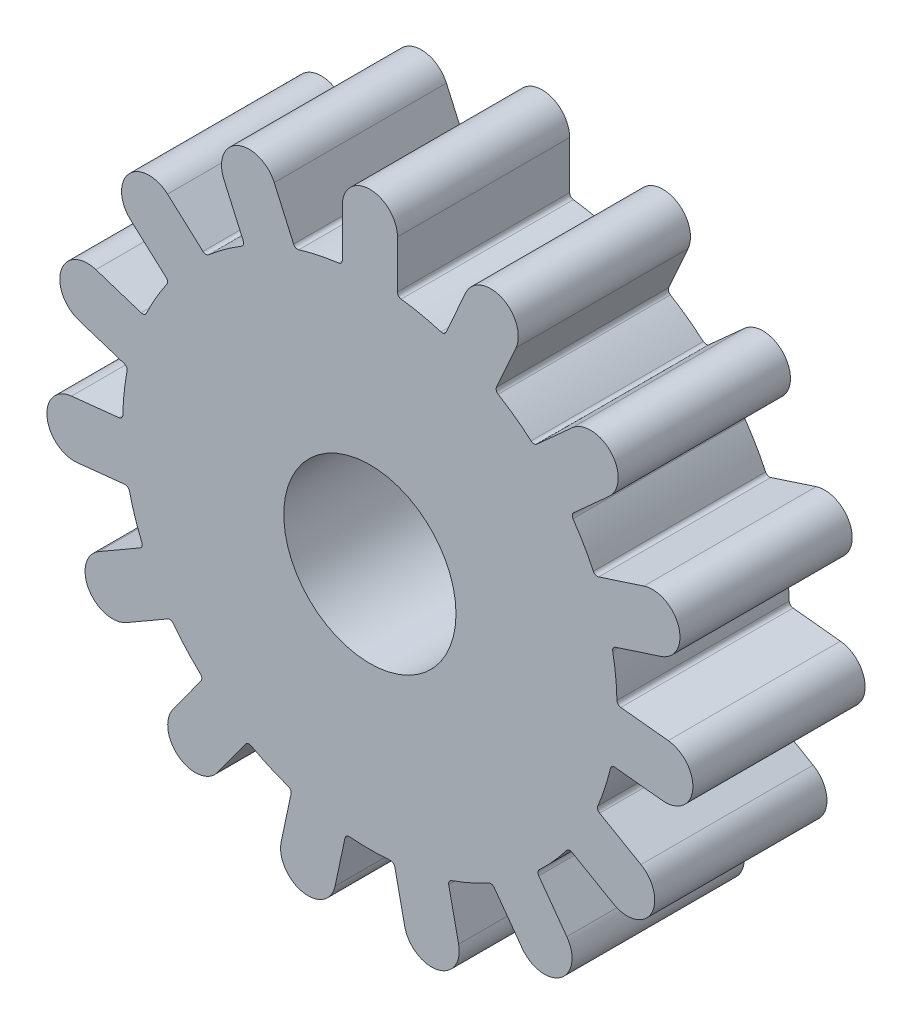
ISO-10303-21;
HEADER;
FILE_DESCRIPTION(('STEP AP214'),'2;1');
FILE_NAME('part.step','',(''),(''),'','','');
FILE_SCHEMA(('AUTOMOTIVE_DESIGN { 1 0 10303 214 1 1 1 1 }'));
ENDSEC;
DATA;
#1=APPLICATION_CONTEXT('core data for automotive mechanical design processes');
#2=APPLICATION_PROTOCOL_DEFINITION('international standard','automotive_design',2000,#1);
#3=PRODUCT_CONTEXT('',#1,'mechanical');
#4=PRODUCT('Part','Part','',(#3));
#5=PRODUCT_RELATED_PRODUCT_CATEGORY('part','',(#4));
#6=PRODUCT_DEFINITION_FORMATION('','',#4);
#7=PRODUCT_DEFINITION_CONTEXT('part definition',#1,'design');
#8=PRODUCT_DEFINITION('design','',#6,#7);
#9=PRODUCT_DEFINITION_SHAPE('','',#8);
#10=(LENGTH_UNIT() NAMED_UNIT(*) SI_UNIT(.MILLI.,.METRE.));
#11=(NAMED_UNIT(*) PLANE_ANGLE_UNIT() SI_UNIT($,.RADIAN.));
#12=(NAMED_UNIT(*) SI_UNIT($,.STERADIAN.) SOLID_ANGLE_UNIT());
#13=UNCERTAINTY_MEASURE_WITH_UNIT(LENGTH_MEASURE(1.E-05),#10,'distance_accuracy_value','');
#14=(GEOMETRIC_REPRESENTATION_CONTEXT(3) GLOBAL_UNCERTAINTY_ASSIGNED_CONTEXT((#13)) GLOBAL_UNIT_ASSIGNED_CONTEXT((#10,
#11,#12)) REPRESENTATION_CONTEXT('',''));
#15=CARTESIAN_POINT('',(0.,0.,0.));
#16=DIRECTION('',(0.,0.,1.));
#17=DIRECTION('',(1.,0.,0.));
#18=AXIS2_PLACEMENT_3D('',#15,#16,#17);
#19=CARTESIAN_POINT('',(1.85,14.4823168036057,10.));
#20=DIRECTION('',(0.,0.,1.));
#21=DIRECTION('',(1.,0.,0.));
#22=AXIS2_PLACEMENT_3D('',#19,#20,#21);
#23=PLANE('',#22);
#24=CARTESIAN_POINT('',(1.85,14.4823168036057,10.));
#25=DIRECTION('',(0.,0.,-1.));
#26=DIRECTION('',(1.,0.,0.));
#27=AXIS2_PLACEMENT_3D('',#24,#25,#26);
#28=CIRCLE('',#27,0.250000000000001);
#29=CARTESIAN_POINT('',(1.81832191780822,14.2343319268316,10.));
#30=VERTEX_POINT('',#29);
#31=CARTESIAN_POINT('',(1.6,14.4823168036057,10.));
#32=VERTEX_POINT('',#31);
#33=EDGE_CURVE('E800',#30,#32,#28,.T.);
#34=ORIENTED_EDGE('',*,*,#33,.T.);
#35=DIRECTION('',(0.,1.,0.));
#36=VECTOR('',#35,1.);
#37=CARTESIAN_POINT('',(1.6,17.25,10.));
#38=LINE('',#37,#36);
#39=CARTESIAN_POINT('',(1.6,17.25,10.));
#40=VERTEX_POINT('',#39);
#41=EDGE_CURVE('E338',#32,#40,#38,.T.);
#42=ORIENTED_EDGE('',*,*,#41,.T.);
#43=CARTESIAN_POINT('',(0.,17.25,10.));
#44=DIRECTION('',(0.,0.,1.));
#45=DIRECTION('',(1.,0.,0.));
#46=AXIS2_PLACEMENT_3D('',#43,#44,#45);
#47=CIRCLE('',#46,1.6);
#48=CARTESIAN_POINT('',(-1.6,17.25,10.));
#49=VERTEX_POINT('',#48);
#50=EDGE_CURVE('E1061',#40,#49,#47,.T.);
#51=ORIENTED_EDGE('',*,*,#50,.T.);
#52=DIRECTION('',(0.,-1.,0.));
#53=VECTOR('',#52,1.);
#54=CARTESIAN_POINT('',(-1.6,17.25,10.));
#55=LINE('',#54,#53);
#56=CARTESIAN_POINT('',(-1.6,14.4823168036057,10.));
#57=VERTEX_POINT('',#56);
#58=EDGE_CURVE('E1080',#49,#57,#55,.T.);
#59=ORIENTED_EDGE('',*,*,#58,.T.);
#60=CARTESIAN_POINT('',(-1.85,14.4823168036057,10.));
#61=DIRECTION('',(0.,0.,-1.));
#62=DIRECTION('',(1.,0.,0.));
#63=AXIS2_PLACEMENT_3D('',#60,#61,#62);
#64=CIRCLE('',#63,0.250000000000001);
#65=CARTESIAN_POINT('',(-1.81832191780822,14.2343319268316,10.));
#66=VERTEX_POINT('',#65);
#67=EDGE_CURVE('E1077',#57,#66,#64,.T.);
#68=ORIENTED_EDGE('',*,*,#67,.T.);
#69=CARTESIAN_POINT('',(0.,0.,10.));
#70=DIRECTION('',(0.,0.,1.));
#71=DIRECTION('',(1.,0.,0.));
#72=AXIS2_PLACEMENT_3D('',#69,#70,#71);
#73=CIRCLE('',#72,14.35);
#74=CARTESIAN_POINT('',(-4.12850465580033,13.7432874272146,10.));
#75=VERTEX_POINT('',#74);
#76=EDGE_CURVE('E1079',#66,#75,#73,.T.);
#77=ORIENTED_EDGE('',*,*,#76,.T.);
#78=CARTESIAN_POINT('',(-4.20042982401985,13.9827175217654,10.));
#79=DIRECTION('',(0.,0.,-1.));
#80=DIRECTION('',(1.,0.,0.));
#81=AXIS2_PLACEMENT_3D('',#78,#79,#80);
#82=CIRCLE('',#81,0.250000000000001);
#83=CARTESIAN_POINT('',(-4.4288161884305,13.8810333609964,10.));
#84=VERTEX_POINT('',#83);
#85=EDGE_CURVE('E1082',#75,#84,#82,.T.);
#86=ORIENTED_EDGE('',*,*,#85,.T.);
#87=DIRECTION('',(-0.406736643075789,0.913545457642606,0.));
#88=VECTOR('',#87,1.);
#89=CARTESIAN_POINT('',(-5.55453436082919,16.4094377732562,10.));
#90=LINE('',#89,#88);
#91=CARTESIAN_POINT('',(-5.55453436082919,16.4094377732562,10.));
#92=VERTEX_POINT('',#91);
#93=EDGE_CURVE('E1088',#84,#92,#90,.T.);
#94=ORIENTED_EDGE('',*,*,#93,.T.);
#95=CARTESIAN_POINT('',(-7.01620709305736,15.758659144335,10.));
#96=DIRECTION('',(0.,0.,1.));
#97=DIRECTION('',(1.,0.,0.));
#98=AXIS2_PLACEMENT_3D('',#95,#96,#97);
#99=CIRCLE('',#98,1.6);
#100=CARTESIAN_POINT('',(-8.47787982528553,15.1078805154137,10.));
#101=VERTEX_POINT('',#100);
#102=EDGE_CURVE('E1090',#92,#101,#99,.T.);
#103=ORIENTED_EDGE('',*,*,#102,.T.);
#104=DIRECTION('',(0.406736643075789,-0.913545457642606,0.));
#105=VECTOR('',#104,1.);
#106=CARTESIAN_POINT('',(-8.47787982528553,15.1078805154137,10.));
#107=LINE('',#106,#105);
#108=CARTESIAN_POINT('',(-7.35216165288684,12.5794761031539,10.));
#109=VERTEX_POINT('',#108);
#110=EDGE_CURVE('E1092',#101,#109,#107,.T.);
#111=ORIENTED_EDGE('',*,*,#110,.T.);
#112=CARTESIAN_POINT('',(-7.58054801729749,12.477791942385,10.));
#113=DIRECTION('',(0.,0.,-1.));
#114=DIRECTION('',(1.,0.,0.));
#115=AXIS2_PLACEMENT_3D('',#112,#113,#114);
#116=CIRCLE('',#115,0.250000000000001);
#117=CARTESIAN_POINT('',(-7.45074411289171,12.2641311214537,10.));
#118=VERTEX_POINT('',#117);
#119=EDGE_CURVE('E1094',#109,#118,#116,.T.);
#120=ORIENTED_EDGE('',*,*,#119,.T.);
#121=CARTESIAN_POINT('',(0.,0.,10.));
#122=DIRECTION('',(0.,0.,1.));
#123=DIRECTION('',(1.,0.,0.));
#124=AXIS2_PLACEMENT_3D('',#121,#122,#123);
#125=CIRCLE('',#124,14.35);
#126=CARTESIAN_POINT('',(-9.36147526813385,10.8759036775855,10.));
#127=VERTEX_POINT('',#126);
#128=EDGE_CURVE('E1096',#118,#127,#125,.T.);
#129=ORIENTED_EDGE('',*,*,#128,.T.);
#130=CARTESIAN_POINT('',(-9.52456717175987,11.0653793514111,10.));
#131=DIRECTION('',(0.,0.,-1.));
#132=DIRECTION('',(1.,0.,0.));
#133=AXIS2_PLACEMENT_3D('',#130,#131,#132);
#134=CIRCLE('',#133,0.25);
#135=CARTESIAN_POINT('',(-9.69184982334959,10.8795931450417,10.));
#136=VERTEX_POINT('',#135);
#137=EDGE_CURVE('E1098',#127,#136,#134,.T.);
#138=ORIENTED_EDGE('',*,*,#137,.T.);
#139=DIRECTION('',(-0.743144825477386,0.669130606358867,0.));
#140=VECTOR('',#139,1.);
#141=CARTESIAN_POINT('',(-11.7486392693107,12.7315346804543,10.));
#142=LINE('',#141,#140);
#143=CARTESIAN_POINT('',(-11.7486392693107,12.7315346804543,10.));
#144=VERTEX_POINT('',#143);
#145=EDGE_CURVE('E1100',#136,#144,#142,.T.);
#146=ORIENTED_EDGE('',*,*,#145,.T.);
#147=CARTESIAN_POINT('',(-12.8192482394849,11.5425029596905,10.));
#148=DIRECTION('',(0.,0.,1.));
#149=DIRECTION('',(1.,0.,0.));
#150=AXIS2_PLACEMENT_3D('',#147,#148,#149);
#151=CIRCLE('',#150,1.6);
#152=CARTESIAN_POINT('',(-13.8898572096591,10.3534712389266,10.));
#153=VERTEX_POINT('',#152);
#154=EDGE_CURVE('E1102',#144,#153,#151,.T.);
#155=ORIENTED_EDGE('',*,*,#154,.T.);
#156=DIRECTION('',(0.743144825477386,-0.669130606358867,0.));
#157=VECTOR('',#156,1.);
#158=CARTESIAN_POINT('',(-13.8898572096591,10.3534712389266,10.));
#159=LINE('',#158,#157);
#160=CARTESIAN_POINT('',(-11.833067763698,8.50152970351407,10.));
#161=VERTEX_POINT('',#160);
#162=EDGE_CURVE('E1104',#153,#161,#159,.T.);
#163=ORIENTED_EDGE('',*,*,#162,.T.);
#164=CARTESIAN_POINT('',(-12.0003504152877,8.31574349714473,10.));
#165=DIRECTION('',(0.,0.,-1.));
#166=DIRECTION('',(1.,0.,0.));
#167=AXIS2_PLACEMENT_3D('',#164,#165,#166);
#168=CIRCLE('',#167,0.249999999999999);
#169=CARTESIAN_POINT('',(-11.7948649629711,8.17335062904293,10.));
#170=VERTEX_POINT('',#169);
#171=EDGE_CURVE('E1106',#161,#170,#168,.T.);
#172=ORIENTED_EDGE('',*,*,#171,.T.);
#173=CARTESIAN_POINT('',(0.,0.,10.));
#174=DIRECTION('',(0.,0.,1.));
#175=DIRECTION('',(1.,0.,0.));
#176=AXIS2_PLACEMENT_3D('',#173,#174,#175);
#177=CIRCLE('',#176,14.35);
#178=CARTESIAN_POINT('',(-12.9757617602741,6.12797737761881,10.));
#179=VERTEX_POINT('',#178);
#180=EDGE_CURVE('E1108',#170,#179,#177,.T.);
#181=ORIENTED_EDGE('',*,*,#180,.T.);
#182=CARTESIAN_POINT('',(-13.2018203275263,6.2347365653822,10.));
#183=DIRECTION('',(0.,0.,-1.));
#184=DIRECTION('',(1.,0.,0.));
#185=AXIS2_PLACEMENT_3D('',#182,#183,#184);
#186=CIRCLE('',#185,0.25);
#187=CARTESIAN_POINT('',(-13.27907457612,5.99697243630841,10.));
#188=VERTEX_POINT('',#187);
#189=EDGE_CURVE('E1110',#179,#188,#186,.T.);
#190=ORIENTED_EDGE('',*,*,#189,.T.);
#191=DIRECTION('',(-0.95105651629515,0.309016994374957,0.));
#192=VECTOR('',#191,1.);
#193=CARTESIAN_POINT('',(-15.9112977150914,6.85223357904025,10.));
#194=LINE('',#193,#192);
#195=CARTESIAN_POINT('',(-15.9112977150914,6.85223357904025,10.));
#196=VERTEX_POINT('',#195);
#197=EDGE_CURVE('E1112',#188,#196,#194,.T.);
#198=ORIENTED_EDGE('',*,*,#197,.T.);
#199=CARTESIAN_POINT('',(-16.4057249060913,5.33054315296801,10.));
#200=DIRECTION('',(0.,0.,1.));
#201=DIRECTION('',(1.,0.,0.));
#202=AXIS2_PLACEMENT_3D('',#199,#200,#201);
#203=CIRCLE('',#202,1.6);
#204=CARTESIAN_POINT('',(-16.9001520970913,3.80885272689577,10.));
#205=VERTEX_POINT('',#204);
#206=EDGE_CURVE('E1114',#196,#205,#203,.T.);
#207=ORIENTED_EDGE('',*,*,#206,.T.);
#208=DIRECTION('',(0.95105651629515,-0.309016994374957,0.));
#209=VECTOR('',#208,1.);
#210=CARTESIAN_POINT('',(-16.9001520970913,3.80885272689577,10.));
#211=LINE('',#210,#209);
#212=CARTESIAN_POINT('',(-14.2679289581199,2.95359158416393,10.));
#213=VERTEX_POINT('',#212);
#214=EDGE_CURVE('E1116',#205,#213,#211,.T.);
#215=ORIENTED_EDGE('',*,*,#214,.T.);
#216=CARTESIAN_POINT('',(-14.3451832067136,2.71582745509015,10.));
#217=DIRECTION('',(0.,0.,-1.));
#218=DIRECTION('',(1.,0.,0.));
#219=AXIS2_PLACEMENT_3D('',#216,#217,#218);
#220=CIRCLE('',#219,0.250000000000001);
#221=CARTESIAN_POINT('',(-14.0995465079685,2.6693235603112,10.));
#222=VERTEX_POINT('',#221);
#223=EDGE_CURVE('E1118',#213,#222,#220,.T.);
#224=ORIENTED_EDGE('',*,*,#223,.T.);
#225=CARTESIAN_POINT('',(0.,0.,10.));
#226=DIRECTION('',(0.,0.,1.));
#227=DIRECTION('',(1.,0.,0.));
#228=AXIS2_PLACEMENT_3D('',#225,#226,#227);
#229=CIRCLE('',#228,14.35);
#230=CARTESIAN_POINT('',(-14.3464211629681,0.320468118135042,10.));
#231=VERTEX_POINT('',#230);
#232=EDGE_CURVE('E1120',#222,#231,#229,.T.);
#233=ORIENTED_EDGE('',*,*,#232,.T.);
#234=CARTESIAN_POINT('',(-14.5963588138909,0.326051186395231,10.));
#235=DIRECTION('',(0.,0.,-1.));
#236=DIRECTION('',(1.,0.,0.));
#237=AXIS2_PLACEMENT_3D('',#234,#235,#236);
#238=CIRCLE('',#237,0.250000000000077);
#239=CARTESIAN_POINT('',(-14.570226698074,0.0774207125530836,10.));
#240=VERTEX_POINT('',#239);
#241=EDGE_CURVE('E1122',#231,#240,#238,.T.);
#242=ORIENTED_EDGE('',*,*,#241,.T.);
#243=DIRECTION('',(-0.99452189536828,-0.104528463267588,0.));
#244=VECTOR('',#243,1.);
#245=CARTESIAN_POINT('',(-17.322748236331,-0.211880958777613,10.));
#246=LINE('',#245,#244);
#247=CARTESIAN_POINT('',(-17.322748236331,-0.211880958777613,10.));
#248=VERTEX_POINT('',#247);
#249=EDGE_CURVE('E1124',#240,#248,#246,.T.);
#250=ORIENTED_EDGE('',*,*,#249,.T.);
#251=CARTESIAN_POINT('',(-17.1555026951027,-1.80311599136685,10.));
#252=DIRECTION('',(0.,0.,1.));
#253=DIRECTION('',(1.,0.,0.));
#254=AXIS2_PLACEMENT_3D('',#251,#252,#253);
#255=CIRCLE('',#254,1.6);
#256=CARTESIAN_POINT('',(-16.9882571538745,-3.39435102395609,10.));
#257=VERTEX_POINT('',#256);
#258=EDGE_CURVE('E1126',#248,#257,#255,.T.);
#259=ORIENTED_EDGE('',*,*,#258,.T.);
#260=DIRECTION('',(0.994521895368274,0.104528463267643,0.));
#261=VECTOR('',#260,1.);
#262=CARTESIAN_POINT('',(-16.9882571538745,-3.39435102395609,10.));
#263=LINE('',#262,#261);
#264=CARTESIAN_POINT('',(-14.2357356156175,-3.10504935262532,10.));
#265=VERTEX_POINT('',#264);
#266=EDGE_CURVE('E1128',#257,#265,#263,.T.);
#267=ORIENTED_EDGE('',*,*,#266,.T.);
#268=CARTESIAN_POINT('',(-14.2096034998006,-3.35367982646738,10.));
#269=DIRECTION('',(0.,0.,-1.));
#270=DIRECTION('',(1.,0.,0.));
#271=AXIS2_PLACEMENT_3D('',#268,#269,#270);
#272=CIRCLE('',#271,0.250000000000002);
#273=CARTESIAN_POINT('',(-13.9662883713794,-3.29625380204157,10.));
#274=VERTEX_POINT('',#273);
#275=EDGE_CURVE('E1130',#265,#274,#272,.T.);
#276=ORIENTED_EDGE('',*,*,#275,.T.);
#277=CARTESIAN_POINT('',(0.,0.,10.));
#278=DIRECTION('',(0.,0.,1.));
#279=DIRECTION('',(1.,0.,0.));
#280=AXIS2_PLACEMENT_3D('',#277,#278,#279);
#281=CIRCLE('',#280,14.35);
#282=CARTESIAN_POINT('',(-13.2364540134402,-5.54245299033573,10.));
#283=VERTEX_POINT('',#282);
#284=EDGE_CURVE('E1132',#274,#283,#281,.T.);
#285=ORIENTED_EDGE('',*,*,#284,.T.);
#286=CARTESIAN_POINT('',(-13.4670542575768,-5.63901140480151,10.));
#287=DIRECTION('',(0.,0.,-1.));
#288=DIRECTION('',(1.,0.,0.));
#289=AXIS2_PLACEMENT_3D('',#286,#287,#288);
#290=CIRCLE('',#289,0.25);
#291=CARTESIAN_POINT('',(-13.3420542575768,-5.85551775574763,10.));
#292=VERTEX_POINT('',#291);
#293=EDGE_CURVE('E1134',#283,#292,#290,.T.);
#294=ORIENTED_EDGE('',*,*,#293,.T.);
#295=DIRECTION('',(-0.866025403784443,-0.499999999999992,0.));
#296=VECTOR('',#295,1.);
#297=CARTESIAN_POINT('',(-15.7389382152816,-7.23935935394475,10.));
#298=LINE('',#297,#296);
#299=CARTESIAN_POINT('',(-15.7389382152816,-7.23935935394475,10.));
#300=VERTEX_POINT('',#299);
#301=EDGE_CURVE('E1136',#292,#300,#298,.T.);
#302=ORIENTED_EDGE('',*,*,#301,.T.);
#303=CARTESIAN_POINT('',(-14.9389382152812,-8.62499999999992,10.));
#304=DIRECTION('',(0.,0.,1.));
#305=DIRECTION('',(1.,0.,0.));
#306=AXIS2_PLACEMENT_3D('',#303,#304,#305);
#307=CIRCLE('',#306,1.60000000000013);
#308=CARTESIAN_POINT('',(-14.1389382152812,-10.0106406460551,10.));
#309=VERTEX_POINT('',#308);
#310=EDGE_CURVE('E1138',#300,#309,#307,.T.);
#311=ORIENTED_EDGE('',*,*,#310,.T.);
#312=DIRECTION('',(0.866025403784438,0.500000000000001,0.));
#313=VECTOR('',#312,1.);
#314=CARTESIAN_POINT('',(-14.1389382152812,-10.010640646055,10.));
#315=LINE('',#314,#313);
#316=CARTESIAN_POINT('',(-11.7420542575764,-8.62679904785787,10.));
#317=VERTEX_POINT('',#316);
#318=EDGE_CURVE('E1140',#309,#317,#315,.T.);
#319=ORIENTED_EDGE('',*,*,#318,.T.);
#320=CARTESIAN_POINT('',(-11.6170542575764,-8.84330539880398,10.));
#321=DIRECTION('',(0.,0.,-1.));
#322=DIRECTION('',(1.,0.,0.));
#323=AXIS2_PLACEMENT_3D('',#320,#321,#322);
#324=CIRCLE('',#323,0.249999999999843);
#325=CARTESIAN_POINT('',(-11.4181320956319,-8.69187893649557,10.));
#326=VERTEX_POINT('',#325);
#327=EDGE_CURVE('E1142',#317,#326,#324,.T.);
#328=ORIENTED_EDGE('',*,*,#327,.T.);
#329=CARTESIAN_POINT('',(0.,0.,10.));
#330=DIRECTION('',(0.,0.,1.));
#331=DIRECTION('',(1.,0.,0.));
#332=AXIS2_PLACEMENT_3D('',#329,#330,#331);
#333=CIRCLE('',#332,14.3499999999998);
#334=CARTESIAN_POINT('',(-9.8377837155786,-10.4470336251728,10.));
#335=VERTEX_POINT('',#334);
#336=EDGE_CURVE('E1144',#326,#335,#333,.T.);
#337=ORIENTED_EDGE('',*,*,#336,.T.);
#338=CARTESIAN_POINT('',(-10.0091736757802,-10.6290376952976,10.));
#339=DIRECTION('',(0.,0.,-1.));
#340=DIRECTION('',(1.,0.,0.));
#341=AXIS2_PLACEMENT_3D('',#338,#339,#340);
#342=CIRCLE('',#341,0.25);
#343=CARTESIAN_POINT('',(-9.80691942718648,-10.7759840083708,10.));
#344=VERTEX_POINT('',#343);
#345=EDGE_CURVE('E1146',#335,#344,#342,.T.);
#346=ORIENTED_EDGE('',*,*,#345,.T.);
#347=DIRECTION('',(-0.587785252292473,-0.809016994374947,0.));
#348=VECTOR('',#347,1.);
#349=CARTESIAN_POINT('',(-11.4337227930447,-13.0150867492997,10.));
#350=LINE('',#349,#348);
#351=CARTESIAN_POINT('',(-11.4337227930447,-13.0150867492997,10.));
#352=VERTEX_POINT('',#351);
#353=EDGE_CURVE('E1148',#344,#352,#350,.T.);
#354=ORIENTED_EDGE('',*,*,#353,.T.);
#355=CARTESIAN_POINT('',(-10.1392956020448,-13.9555431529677,10.));
#356=DIRECTION('',(0.,0.,1.));
#357=DIRECTION('',(1.,0.,0.));
#358=AXIS2_PLACEMENT_3D('',#355,#356,#357);
#359=CIRCLE('',#358,1.6);
#360=CARTESIAN_POINT('',(-8.8448684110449,-14.8959995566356,10.));
#361=VERTEX_POINT('',#360);
#362=EDGE_CURVE('E1150',#352,#361,#359,.T.);
#363=ORIENTED_EDGE('',*,*,#362,.T.);
#364=DIRECTION('',(0.587785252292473,0.809016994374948,0.));
#365=VECTOR('',#364,1.);
#366=CARTESIAN_POINT('',(-8.8448684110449,-14.8959995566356,10.));
#367=LINE('',#366,#365);
#368=CARTESIAN_POINT('',(-7.21806504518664,-12.6568968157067,10.));
#369=VERTEX_POINT('',#368);
#370=EDGE_CURVE('E1152',#361,#369,#367,.T.);
#371=ORIENTED_EDGE('',*,*,#370,.T.);
#372=CARTESIAN_POINT('',(-7.0158107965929,-12.8038431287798,10.));
#373=DIRECTION('',(0.,0.,-1.));
#374=DIRECTION('',(1.,0.,0.));
#375=AXIS2_PLACEMENT_3D('',#372,#373,#374);
#376=CIRCLE('',#375,0.249999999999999);
#377=CARTESIAN_POINT('',(-6.89567705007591,-12.5845992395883,10.));
#378=VERTEX_POINT('',#377);
#379=EDGE_CURVE('E1154',#369,#378,#376,.T.);
#380=ORIENTED_EDGE('',*,*,#379,.T.);
#381=CARTESIAN_POINT('',(0.,0.,10.));
#382=DIRECTION('',(0.,0.,1.));
#383=DIRECTION('',(1.,0.,0.));
#384=AXIS2_PLACEMENT_3D('',#381,#382,#383);
#385=CIRCLE('',#384,14.3499999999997);
#386=CARTESIAN_POINT('',(-4.73807123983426,-13.5452272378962,10.));
#387=VERTEX_POINT('',#386);
#388=EDGE_CURVE('E1156',#378,#387,#385,.T.);
#389=ORIENTED_EDGE('',*,*,#388,.T.);
#390=CARTESIAN_POINT('',(-4.82061603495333,-13.7812068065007,10.));
#391=DIRECTION('',(0.,0.,-1.));
#392=DIRECTION('',(1.,0.,0.));
#393=AXIS2_PLACEMENT_3D('',#390,#391,#392);
#394=CIRCLE('',#393,0.25);
#395=CARTESIAN_POINT('',(-4.57607913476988,-13.8331847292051,10.));
#396=VERTEX_POINT('',#395);
#397=EDGE_CURVE('E1158',#387,#396,#394,.T.);
#398=ORIENTED_EDGE('',*,*,#397,.T.);
#399=DIRECTION('',(-0.207911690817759,-0.978147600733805,0.));
#400=VECTOR('',#399,1.);
#401=CARTESIAN_POINT('',(-5.15151282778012,-16.5403874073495,10.));
#402=LINE('',#401,#400);
#403=CARTESIAN_POINT('',(-5.15151282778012,-16.5403874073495,10.));
#404=VERTEX_POINT('',#403);
#405=EDGE_CURVE('E1160',#396,#404,#402,.T.);
#406=ORIENTED_EDGE('',*,*,#405,.T.);
#407=CARTESIAN_POINT('',(-3.58647666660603,-16.8730461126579,10.));
#408=DIRECTION('',(0.,0.,1.));
#409=DIRECTION('',(1.,0.,0.));
#410=AXIS2_PLACEMENT_3D('',#407,#408,#409);
#411=CIRCLE('',#410,1.6);
#412=CARTESIAN_POINT('',(-2.02144050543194,-17.2057048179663,10.));
#413=VERTEX_POINT('',#412);
#414=EDGE_CURVE('E1162',#404,#413,#411,.T.);
#415=ORIENTED_EDGE('',*,*,#414,.T.);
#416=DIRECTION('',(0.207911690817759,0.978147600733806,0.));
#417=VECTOR('',#416,1.);
#418=CARTESIAN_POINT('',(-2.02144050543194,-17.2057048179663,10.));
#419=LINE('',#418,#417);
#420=CARTESIAN_POINT('',(-1.4460068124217,-14.498502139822,10.));
#421=VERTEX_POINT('',#420);
#422=EDGE_CURVE('E1164',#413,#421,#419,.T.);
#423=ORIENTED_EDGE('',*,*,#422,.T.);
#424=CARTESIAN_POINT('',(-1.20146991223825,-14.5504800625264,10.));
#425=DIRECTION('',(0.,0.,-1.));
#426=DIRECTION('',(1.,0.,0.));
#427=AXIS2_PLACEMENT_3D('',#424,#425,#426);
#428=CIRCLE('',#427,0.249999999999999);
#429=CARTESIAN_POINT('',(-1.18089679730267,-14.3013280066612,10.));
#430=VERTEX_POINT('',#429);
#431=EDGE_CURVE('E1166',#421,#430,#428,.T.);
#432=ORIENTED_EDGE('',*,*,#431,.T.);
#433=CARTESIAN_POINT('',(0.,0.,10.));
#434=DIRECTION('',(0.,0.,1.));
#435=DIRECTION('',(1.,0.,0.));
#436=AXIS2_PLACEMENT_3D('',#433,#434,#435);
#437=CIRCLE('',#436,14.3499999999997);
#438=CARTESIAN_POINT('',(1.18089679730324,-14.3013280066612,10.));
#439=VERTEX_POINT('',#438);
#440=EDGE_CURVE('E1168',#430,#439,#437,.T.);
#441=ORIENTED_EDGE('',*,*,#440,.T.);
#442=CARTESIAN_POINT('',(1.20146991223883,-14.5504800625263,10.));
#443=DIRECTION('',(0.,0.,-1.));
#444=DIRECTION('',(1.,0.,0.));
#445=AXIS2_PLACEMENT_3D('',#442,#443,#444);
#446=CIRCLE('',#445,0.249999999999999);
#447=CARTESIAN_POINT('',(1.44600681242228,-14.4985021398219,10.));
#448=VERTEX_POINT('',#447);
#449=EDGE_CURVE('E1170',#439,#448,#446,.T.);
#450=ORIENTED_EDGE('',*,*,#449,.T.);
#451=DIRECTION('',(0.20791169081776,-0.978147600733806,0.));
#452=VECTOR('',#451,1.);
#453=CARTESIAN_POINT('',(2.02144050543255,-17.2057048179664,10.));
#454=LINE('',#453,#452);
#455=CARTESIAN_POINT('',(2.02144050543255,-17.2057048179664,10.));
#456=VERTEX_POINT('',#455);
#457=EDGE_CURVE('E1172',#448,#456,#454,.T.);
#458=ORIENTED_EDGE('',*,*,#457,.T.);
#459=CARTESIAN_POINT('',(3.58647666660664,-16.873046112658,10.));
#460=DIRECTION('',(0.,0.,1.));
#461=DIRECTION('',(1.,0.,0.));
#462=AXIS2_PLACEMENT_3D('',#459,#460,#461);
#463=CIRCLE('',#462,1.6);
#464=CARTESIAN_POINT('',(5.15151282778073,-16.5403874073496,10.));
#465=VERTEX_POINT('',#464);
#466=EDGE_CURVE('E1174',#456,#465,#463,.T.);
#467=ORIENTED_EDGE('',*,*,#466,.T.);
#468=DIRECTION('',(-0.207911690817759,0.978147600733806,0.));
#469=VECTOR('',#468,1.);
#470=CARTESIAN_POINT('',(5.15151282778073,-16.5403874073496,10.));
#471=LINE('',#470,#469);
#472=CARTESIAN_POINT('',(4.57607913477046,-13.8331847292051,10.));
#473=VERTEX_POINT('',#472);
#474=EDGE_CURVE('E1176',#465,#473,#471,.T.);
#475=ORIENTED_EDGE('',*,*,#474,.T.);
#476=CARTESIAN_POINT('',(4.82061603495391,-13.7812068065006,10.));
#477=DIRECTION('',(0.,0.,-1.));
#478=DIRECTION('',(1.,0.,0.));
#479=AXIS2_PLACEMENT_3D('',#476,#477,#478);
#480=CIRCLE('',#479,0.25);
#481=CARTESIAN_POINT('',(4.73807123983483,-13.5452272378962,10.));
#482=VERTEX_POINT('',#481);
#483=EDGE_CURVE('E1178',#473,#482,#480,.T.);
#484=ORIENTED_EDGE('',*,*,#483,.T.);
#485=CARTESIAN_POINT('',(0.,0.,10.));
#486=DIRECTION('',(0.,0.,1.));
#487=DIRECTION('',(1.,0.,0.));
#488=AXIS2_PLACEMENT_3D('',#485,#486,#487);
#489=CIRCLE('',#488,14.3499999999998);
#490=CARTESIAN_POINT('',(6.89567705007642,-12.5845992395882,10.));
#491=VERTEX_POINT('',#490);
#492=EDGE_CURVE('E1180',#482,#491,#489,.T.);
#493=ORIENTED_EDGE('',*,*,#492,.T.);
#494=CARTESIAN_POINT('',(7.01581079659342,-12.8038431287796,10.));
#495=DIRECTION('',(0.,0.,-1.));
#496=DIRECTION('',(1.,0.,0.));
#497=AXIS2_PLACEMENT_3D('',#494,#495,#496);
#498=CIRCLE('',#497,0.25);
#499=CARTESIAN_POINT('',(7.21806504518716,-12.6568968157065,10.));
#500=VERTEX_POINT('',#499);
#501=EDGE_CURVE('E1182',#491,#500,#498,.T.);
#502=ORIENTED_EDGE('',*,*,#501,.T.);
#503=DIRECTION('',(0.587785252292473,-0.809016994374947,0.));
#504=VECTOR('',#503,1.);
#505=CARTESIAN_POINT('',(8.84486841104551,-14.8959995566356,10.));
#506=LINE('',#505,#504);
#507=CARTESIAN_POINT('',(8.84486841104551,-14.8959995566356,10.));
#508=VERTEX_POINT('',#507);
#509=EDGE_CURVE('E1184',#500,#508,#506,.T.);
#510=ORIENTED_EDGE('',*,*,#509,.T.);
#511=CARTESIAN_POINT('',(10.1392956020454,-13.9555431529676,10.));
#512=DIRECTION('',(0.,0.,1.));
#513=DIRECTION('',(1.,0.,0.));
#514=AXIS2_PLACEMENT_3D('',#511,#512,#513);
#515=CIRCLE('',#514,1.6);
#516=CARTESIAN_POINT('',(11.4337227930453,-13.0150867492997,10.));
#517=VERTEX_POINT('',#516);
#518=EDGE_CURVE('E1186',#508,#517,#515,.T.);
#519=ORIENTED_EDGE('',*,*,#518,.T.);
#520=DIRECTION('',(-0.587785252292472,0.809016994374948,0.));
#521=VECTOR('',#520,1.);
#522=CARTESIAN_POINT('',(11.4337227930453,-13.0150867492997,10.));
#523=LINE('',#522,#521);
#524=CARTESIAN_POINT('',(9.80691942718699,-10.7759840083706,10.));
#525=VERTEX_POINT('',#524);
#526=EDGE_CURVE('E1188',#517,#525,#523,.T.);
#527=ORIENTED_EDGE('',*,*,#526,.T.);
#528=CARTESIAN_POINT('',(10.0091736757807,-10.6290376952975,10.));
#529=DIRECTION('',(0.,0.,-1.));
#530=DIRECTION('',(1.,0.,0.));
#531=AXIS2_PLACEMENT_3D('',#528,#529,#530);
#532=CIRCLE('',#531,0.249999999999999);
#533=CARTESIAN_POINT('',(9.837783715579,-10.4470336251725,10.));
#534=VERTEX_POINT('',#533);
#535=EDGE_CURVE('E1190',#525,#534,#532,.T.);
#536=ORIENTED_EDGE('',*,*,#535,.T.);
#537=CARTESIAN_POINT('',(0.,0.,10.));
#538=DIRECTION('',(0.,0.,1.));
#539=DIRECTION('',(1.,0.,0.));
#540=AXIS2_PLACEMENT_3D('',#537,#538,#539);
#541=CIRCLE('',#540,14.3499999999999);
#542=CARTESIAN_POINT('',(11.4181320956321,-8.69187893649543,10.));
#543=VERTEX_POINT('',#542);
#544=EDGE_CURVE('E1192',#534,#543,#541,.T.);
#545=ORIENTED_EDGE('',*,*,#544,.T.);
#546=CARTESIAN_POINT('',(11.6170542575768,-8.84330539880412,10.));
#547=DIRECTION('',(0.,0.,-1.));
#548=DIRECTION('',(1.,0.,0.));
#549=AXIS2_PLACEMENT_3D('',#546,#547,#548);
#550=CIRCLE('',#549,0.250000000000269);
#551=CARTESIAN_POINT('',(11.7420542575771,-8.62679904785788,10.));
#552=VERTEX_POINT('',#551);
#553=EDGE_CURVE('E1194',#543,#552,#550,.T.);
#554=ORIENTED_EDGE('',*,*,#553,.T.);
#555=DIRECTION('',(0.866025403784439,-0.499999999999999,0.));
#556=VECTOR('',#555,1.);
#557=CARTESIAN_POINT('',(14.1389382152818,-10.0106406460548,10.));
#558=LINE('',#557,#556);
#559=CARTESIAN_POINT('',(14.1389382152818,-10.0106406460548,10.));
#560=VERTEX_POINT('',#559);
#561=EDGE_CURVE('E1196',#552,#560,#558,.T.);
#562=ORIENTED_EDGE('',*,*,#561,.T.);
#563=CARTESIAN_POINT('',(14.9389382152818,-8.62499999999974,10.));
#564=DIRECTION('',(0.,0.,1.));
#565=DIRECTION('',(1.,0.,0.));
#566=AXIS2_PLACEMENT_3D('',#563,#564,#565);
#567=CIRCLE('',#566,1.6);
#568=CARTESIAN_POINT('',(15.7389382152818,-7.23935935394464,10.));
#569=VERTEX_POINT('',#568);
#570=EDGE_CURVE('E1198',#560,#569,#567,.T.);
#571=ORIENTED_EDGE('',*,*,#570,.T.);
#572=DIRECTION('',(-0.866025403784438,0.5,0.));
#573=VECTOR('',#572,1.);
#574=CARTESIAN_POINT('',(15.7389382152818,-7.23935935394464,10.));
#575=LINE('',#574,#573);
#576=CARTESIAN_POINT('',(13.3420542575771,-5.85551775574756,10.));
#577=VERTEX_POINT('',#576);
#578=EDGE_CURVE('E1200',#569,#577,#575,.T.);
#579=ORIENTED_EDGE('',*,*,#578,.T.);
#580=CARTESIAN_POINT('',(13.4670542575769,-5.6390114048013,10.));
#581=DIRECTION('',(0.,0.,-1.));
#582=DIRECTION('',(1.,0.,0.));
#583=AXIS2_PLACEMENT_3D('',#580,#581,#582);
#584=CIRCLE('',#583,0.249999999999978);
#585=CARTESIAN_POINT('',(13.2364540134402,-5.54245299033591,10.));
#586=VERTEX_POINT('',#585);
#587=EDGE_CURVE('E1202',#577,#586,#584,.T.);
#588=ORIENTED_EDGE('',*,*,#587,.T.);
#589=CARTESIAN_POINT('',(0.,0.,10.));
#590=DIRECTION('',(0.,0.,1.));
#591=DIRECTION('',(1.,0.,0.));
#592=AXIS2_PLACEMENT_3D('',#589,#590,#591);
#593=CIRCLE('',#592,14.35);
#594=CARTESIAN_POINT('',(13.9662883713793,-3.29625380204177,10.));
#595=VERTEX_POINT('',#594);
#596=EDGE_CURVE('E1204',#586,#595,#593,.T.);
#597=ORIENTED_EDGE('',*,*,#596,.T.);
#598=CARTESIAN_POINT('',(14.2096034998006,-3.35367982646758,10.));
#599=DIRECTION('',(0.,0.,-1.));
#600=DIRECTION('',(1.,0.,0.));
#601=AXIS2_PLACEMENT_3D('',#598,#599,#600);
#602=CIRCLE('',#601,0.250000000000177);
#603=CARTESIAN_POINT('',(14.2357356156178,-3.10504935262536,10.));
#604=VERTEX_POINT('',#603);
#605=EDGE_CURVE('E1206',#595,#604,#602,.T.);
#606=ORIENTED_EDGE('',*,*,#605,.T.);
#607=DIRECTION('',(0.99452189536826,-0.104528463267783,0.));
#608=VECTOR('',#607,1.);
#609=CARTESIAN_POINT('',(16.9882571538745,-3.39435102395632,10.));
#610=LINE('',#609,#608);
#611=CARTESIAN_POINT('',(16.9882571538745,-3.39435102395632,10.));
#612=VERTEX_POINT('',#611);
#613=EDGE_CURVE('E1208',#604,#612,#610,.T.);
#614=ORIENTED_EDGE('',*,*,#613,.T.);
#615=CARTESIAN_POINT('',(17.1555026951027,-1.80311599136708,10.));
#616=DIRECTION('',(0.,0.,1.));
#617=DIRECTION('',(1.,0.,0.));
#618=AXIS2_PLACEMENT_3D('',#615,#616,#617);
#619=CIRCLE('',#618,1.6);
#620=CARTESIAN_POINT('',(17.322748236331,-0.211880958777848,10.));
#621=VERTEX_POINT('',#620);
#622=EDGE_CURVE('E1210',#612,#621,#619,.T.);
#623=ORIENTED_EDGE('',*,*,#622,.T.);
#624=DIRECTION('',(-0.99452189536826,0.104528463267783,0.));
#625=VECTOR('',#624,1.);
#626=CARTESIAN_POINT('',(17.322748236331,-0.211880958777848,10.));
#627=LINE('',#626,#625);
#628=CARTESIAN_POINT('',(14.5702266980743,0.0774207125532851,10.));
#629=VERTEX_POINT('',#628);
#630=EDGE_CURVE('E1212',#621,#629,#627,.T.);
#631=ORIENTED_EDGE('',*,*,#630,.T.);
#632=CARTESIAN_POINT('',(14.5963588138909,0.326051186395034,10.));
#633=DIRECTION('',(0.,0.,-1.));
#634=DIRECTION('',(1.,0.,0.));
#635=AXIS2_PLACEMENT_3D('',#632,#633,#634);
#636=CIRCLE('',#635,0.249999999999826);
#637=CARTESIAN_POINT('',(14.3464211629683,0.320468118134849,10.));
#638=VERTEX_POINT('',#637);
#639=EDGE_CURVE('E1214',#629,#638,#636,.T.);
#640=ORIENTED_EDGE('',*,*,#639,.T.);
#641=CARTESIAN_POINT('',(0.,0.,10.));
#642=DIRECTION('',(0.,0.,1.));
#643=DIRECTION('',(1.,0.,0.));
#644=AXIS2_PLACEMENT_3D('',#641,#642,#643);
#645=CIRCLE('',#644,14.35);
#646=CARTESIAN_POINT('',(14.0995465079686,2.66932356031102,10.));
#647=VERTEX_POINT('',#646);
#648=EDGE_CURVE('E1216',#638,#647,#645,.T.);
#649=ORIENTED_EDGE('',*,*,#648,.T.);
#650=CARTESIAN_POINT('',(14.3451832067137,2.71582745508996,10.));
#651=DIRECTION('',(0.,0.,-1.));
#652=DIRECTION('',(1.,0.,0.));
#653=AXIS2_PLACEMENT_3D('',#650,#651,#652);
#654=CIRCLE('',#653,0.250000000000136);
#655=CARTESIAN_POINT('',(14.2679289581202,2.95359158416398,10.));
#656=VERTEX_POINT('',#655);
#657=EDGE_CURVE('E1218',#647,#656,#654,.T.);
#658=ORIENTED_EDGE('',*,*,#657,.T.);
#659=DIRECTION('',(0.951056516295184,0.309016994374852,0.));
#660=VECTOR('',#659,1.);
#661=CARTESIAN_POINT('',(16.9001520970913,3.80885272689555,10.));
#662=LINE('',#661,#660);
#663=CARTESIAN_POINT('',(16.9001520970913,3.80885272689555,10.));
#664=VERTEX_POINT('',#663);
#665=EDGE_CURVE('E1220',#656,#664,#662,.T.);
#666=ORIENTED_EDGE('',*,*,#665,.T.);
#667=CARTESIAN_POINT('',(16.4057249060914,5.3305431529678,10.));
#668=DIRECTION('',(0.,0.,1.));
#669=DIRECTION('',(1.,0.,0.));
#670=AXIS2_PLACEMENT_3D('',#667,#668,#669);
#671=CIRCLE('',#670,1.6);
#672=CARTESIAN_POINT('',(15.9112977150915,6.85223357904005,10.));
#673=VERTEX_POINT('',#672);
#674=EDGE_CURVE('E1222',#664,#673,#671,.T.);
#675=ORIENTED_EDGE('',*,*,#674,.T.);
#676=DIRECTION('',(-0.951056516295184,-0.309016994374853,0.));
#677=VECTOR('',#676,1.);
#678=CARTESIAN_POINT('',(15.9112977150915,6.85223357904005,10.));
#679=LINE('',#678,#677);
#680=CARTESIAN_POINT('',(13.2790745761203,5.9969724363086,10.));
#681=VERTEX_POINT('',#680);
#682=EDGE_CURVE('E1224',#673,#681,#679,.T.);
#683=ORIENTED_EDGE('',*,*,#682,.T.);
#684=CARTESIAN_POINT('',(13.2018203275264,6.23473656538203,10.));
#685=DIRECTION('',(0.,0.,-1.));
#686=DIRECTION('',(1.,0.,0.));
#687=AXIS2_PLACEMENT_3D('',#684,#685,#686);
#688=CIRCLE('',#687,0.249999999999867);
#689=CARTESIAN_POINT('',(12.9757617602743,6.1279773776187,10.));
#690=VERTEX_POINT('',#689);
#691=EDGE_CURVE('E1226',#681,#690,#688,.T.);
#692=ORIENTED_EDGE('',*,*,#691,.T.);
#693=CARTESIAN_POINT('',(0.,0.,10.));
#694=DIRECTION('',(0.,0.,1.));
#695=DIRECTION('',(1.,0.,0.));
#696=AXIS2_PLACEMENT_3D('',#693,#694,#695);
#697=CIRCLE('',#696,14.35);
#698=CARTESIAN_POINT('',(11.7948649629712,8.17335062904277,10.));
#699=VERTEX_POINT('',#698);
#700=EDGE_CURVE('E1228',#690,#699,#697,.T.);
#701=ORIENTED_EDGE('',*,*,#700,.T.);
#702=CARTESIAN_POINT('',(12.0003504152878,8.31574349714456,10.));
#703=DIRECTION('',(0.,0.,-1.));
#704=DIRECTION('',(1.,0.,0.));
#705=AXIS2_PLACEMENT_3D('',#702,#703,#704);
#706=CIRCLE('',#705,0.25);
#707=CARTESIAN_POINT('',(11.8330677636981,8.50152970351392,10.));
#708=VERTEX_POINT('',#707);
#709=EDGE_CURVE('E1230',#699,#708,#706,.T.);
#710=ORIENTED_EDGE('',*,*,#709,.T.);
#711=DIRECTION('',(0.743144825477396,0.669130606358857,0.));
#712=VECTOR('',#711,1.);
#713=CARTESIAN_POINT('',(13.8898572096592,10.3534712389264,10.));
#714=LINE('',#713,#712);
#715=CARTESIAN_POINT('',(13.8898572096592,10.3534712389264,10.));
#716=VERTEX_POINT('',#715);
#717=EDGE_CURVE('E1232',#708,#716,#714,.T.);
#718=ORIENTED_EDGE('',*,*,#717,.T.);
#719=CARTESIAN_POINT('',(12.8192482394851,11.5425029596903,10.));
#720=DIRECTION('',(0.,0.,1.));
#721=DIRECTION('',(1.,0.,0.));
#722=AXIS2_PLACEMENT_3D('',#719,#720,#721);
#723=CIRCLE('',#722,1.6);
#724=CARTESIAN_POINT('',(11.7486392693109,12.7315346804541,10.));
#725=VERTEX_POINT('',#724);
#726=EDGE_CURVE('E1234',#716,#725,#723,.T.);
#727=ORIENTED_EDGE('',*,*,#726,.T.);
#728=DIRECTION('',(-0.743144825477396,-0.669130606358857,0.));
#729=VECTOR('',#728,1.);
#730=CARTESIAN_POINT('',(11.7486392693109,12.7315346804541,10.));
#731=LINE('',#730,#729);
#732=CARTESIAN_POINT('',(9.69184982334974,10.8795931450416,10.));
#733=VERTEX_POINT('',#732);
#734=EDGE_CURVE('E1236',#725,#733,#731,.T.);
#735=ORIENTED_EDGE('',*,*,#734,.T.);
#736=CARTESIAN_POINT('',(9.52456717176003,11.0653793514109,10.));
#737=DIRECTION('',(0.,0.,-1.));
#738=DIRECTION('',(1.,0.,0.));
#739=AXIS2_PLACEMENT_3D('',#736,#737,#738);
#740=CIRCLE('',#739,0.25);
#741=CARTESIAN_POINT('',(9.361475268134,10.8759036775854,10.));
#742=VERTEX_POINT('',#741);
#743=EDGE_CURVE('E1238',#733,#742,#740,.T.);
#744=ORIENTED_EDGE('',*,*,#743,.T.);
#745=CARTESIAN_POINT('',(0.,0.,10.));
#746=DIRECTION('',(0.,0.,1.));
#747=DIRECTION('',(1.,0.,0.));
#748=AXIS2_PLACEMENT_3D('',#745,#746,#747);
#749=CIRCLE('',#748,14.35);
#750=CARTESIAN_POINT('',(7.45074411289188,12.2641311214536,10.));
#751=VERTEX_POINT('',#750);
#752=EDGE_CURVE('E1240',#742,#751,#749,.T.);
#753=ORIENTED_EDGE('',*,*,#752,.T.);
#754=CARTESIAN_POINT('',(7.58054801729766,12.4777919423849,10.));
#755=DIRECTION('',(0.,0.,-1.));
#756=DIRECTION('',(1.,0.,0.));
#757=AXIS2_PLACEMENT_3D('',#754,#755,#756);
#758=CIRCLE('',#757,0.25);
#759=CARTESIAN_POINT('',(7.35216165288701,12.5794761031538,10.));
#760=VERTEX_POINT('',#759);
#761=EDGE_CURVE('E1242',#751,#760,#758,.T.);
#762=ORIENTED_EDGE('',*,*,#761,.T.);
#763=DIRECTION('',(0.406736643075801,0.913545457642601,0.));
#764=VECTOR('',#763,1.);
#765=CARTESIAN_POINT('',(8.47787982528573,15.1078805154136,10.));
#766=LINE('',#765,#764);
#767=CARTESIAN_POINT('',(8.47787982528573,15.1078805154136,10.));
#768=VERTEX_POINT('',#767);
#769=EDGE_CURVE('E1244',#760,#768,#766,.T.);
#770=ORIENTED_EDGE('',*,*,#769,.T.);
#771=CARTESIAN_POINT('',(7.01620709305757,15.7586591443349,10.));
#772=DIRECTION('',(0.,0.,1.));
#773=DIRECTION('',(1.,0.,0.));
#774=AXIS2_PLACEMENT_3D('',#771,#772,#773);
#775=CIRCLE('',#774,1.6);
#776=CARTESIAN_POINT('',(5.55453436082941,16.4094377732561,10.));
#777=VERTEX_POINT('',#776);
#778=EDGE_CURVE('E603',#768,#777,#775,.T.);
#779=ORIENTED_EDGE('',*,*,#778,.T.);
#780=DIRECTION('',(-0.406736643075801,-0.9135454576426,0.));
#781=VECTOR('',#780,1.);
#782=CARTESIAN_POINT('',(5.55453436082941,16.4094377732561,10.));
#783=LINE('',#782,#781);
#784=CARTESIAN_POINT('',(4.42881618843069,13.8810333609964,10.));
#785=VERTEX_POINT('',#784);
#786=EDGE_CURVE('E597',#777,#785,#783,.T.);
#787=ORIENTED_EDGE('',*,*,#786,.T.);
#788=CARTESIAN_POINT('',(4.20042982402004,13.9827175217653,10.));
#789=DIRECTION('',(0.,0.,-1.));
#790=DIRECTION('',(1.,0.,0.));
#791=AXIS2_PLACEMENT_3D('',#788,#789,#790);
#792=CIRCLE('',#791,0.25);
#793=CARTESIAN_POINT('',(4.12850465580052,13.7432874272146,10.));
#794=VERTEX_POINT('',#793);
#795=EDGE_CURVE('E601',#785,#794,#792,.T.);
#796=ORIENTED_EDGE('',*,*,#795,.T.);
#797=CARTESIAN_POINT('',(0.,0.,10.));
#798=DIRECTION('',(0.,0.,1.));
#799=DIRECTION('',(1.,0.,0.));
#800=AXIS2_PLACEMENT_3D('',#797,#798,#799);
#801=CIRCLE('',#800,14.35);
#802=EDGE_CURVE('E49',#794,#30,#801,.T.);
#803=ORIENTED_EDGE('',*,*,#802,.T.);
#804=EDGE_LOOP('',(#34,#42,#51,#59,#68,#77,#86,#94,#103,#111,#120,#129,#138,#146,#155,#163,#172,
#181,#190,#198,#207,#215,#224,#233,#242,#250,#259,#267,#276,#285,#294,#302,#311,#319,#328,#337,
#346,#354,#363,#371,#380,#389,#398,#406,#415,#423,#432,#441,#450,#458,#467,#475,#484,#493,#502,
#510,#519,#527,#536,#545,#554,#562,#571,#579,#588,#597,#606,#614,#623,#631,#640,#649,#658,#666,
#675,#683,#692,#701,#710,#718,#727,#735,#744,#753,#762,#770,#779,#787,#796,#803));
#805=FACE_BOUND('',#804,.T.);
#806=CARTESIAN_POINT('',(0.,0.,10.));
#807=DIRECTION('',(0.,0.,1.));
#808=DIRECTION('',(1.,0.,0.));
#809=AXIS2_PLACEMENT_3D('',#806,#807,#808);
#810=CIRCLE('',#809,5.);
#811=CARTESIAN_POINT('',(5.,0.,10.));
#812=VERTEX_POINT('',#811);
#813=EDGE_CURVE('E625',#812,#812,#810,.T.);
#814=ORIENTED_EDGE('',*,*,#813,.F.);
#815=EDGE_LOOP('',(#814));
#816=FACE_BOUND('',#815,.T.);
#817=ADVANCED_FACE('F32',(#805,#816),#23,.T.);
#818=CARTESIAN_POINT('',(1.85,14.4823168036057,0.));
#819=DIRECTION('',(0.,0.,1.));
#820=DIRECTION('',(1.,0.,0.));
#821=AXIS2_PLACEMENT_3D('',#818,#819,#820);
#822=PLANE('',#821);
#823=CARTESIAN_POINT('',(1.85,14.4823168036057,0.));
#824=DIRECTION('',(0.,0.,-1.));
#825=DIRECTION('',(1.,0.,0.));
#826=AXIS2_PLACEMENT_3D('',#823,#824,#825);
#827=CIRCLE('',#826,0.250000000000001);
#828=CARTESIAN_POINT('',(1.81832191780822,14.2343319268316,0.));
#829=VERTEX_POINT('',#828);
#830=CARTESIAN_POINT('',(1.6,14.4823168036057,0.));
#831=VERTEX_POINT('',#830);
#832=EDGE_CURVE('E621',#829,#831,#827,.T.);
#833=ORIENTED_EDGE('',*,*,#832,.F.);
#834=CARTESIAN_POINT('',(0.,0.,0.));
#835=DIRECTION('',(0.,0.,1.));
#836=DIRECTION('',(1.,0.,0.));
#837=AXIS2_PLACEMENT_3D('',#834,#835,#836);
#838=CIRCLE('',#837,14.35);
#839=CARTESIAN_POINT('',(4.12850465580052,13.7432874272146,0.));
#840=VERTEX_POINT('',#839);
#841=EDGE_CURVE('E330',#840,#829,#838,.T.);
#842=ORIENTED_EDGE('',*,*,#841,.F.);
#843=CARTESIAN_POINT('',(4.20042982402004,13.9827175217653,0.));
#844=DIRECTION('',(0.,0.,-1.));
#845=DIRECTION('',(1.,0.,0.));
#846=AXIS2_PLACEMENT_3D('',#843,#844,#845);
#847=CIRCLE('',#846,0.25);
#848=CARTESIAN_POINT('',(4.42881618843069,13.8810333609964,0.));
#849=VERTEX_POINT('',#848);
#850=EDGE_CURVE('E324',#849,#840,#847,.T.);
#851=ORIENTED_EDGE('',*,*,#850,.F.);
#852=DIRECTION('',(-0.406736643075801,-0.9135454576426,0.));
#853=VECTOR('',#852,1.);
#854=CARTESIAN_POINT('',(5.55453436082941,16.4094377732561,0.));
#855=LINE('',#854,#853);
#856=CARTESIAN_POINT('',(5.55453436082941,16.4094377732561,0.));
#857=VERTEX_POINT('',#856);
#858=EDGE_CURVE('E611',#857,#849,#855,.T.);
#859=ORIENTED_EDGE('',*,*,#858,.F.);
#860=CARTESIAN_POINT('',(7.01620709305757,15.7586591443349,0.));
#861=DIRECTION('',(0.,0.,1.));
#862=DIRECTION('',(1.,0.,0.));
#863=AXIS2_PLACEMENT_3D('',#860,#861,#862);
#864=CIRCLE('',#863,1.6);
#865=CARTESIAN_POINT('',(8.47787982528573,15.1078805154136,0.));
#866=VERTEX_POINT('',#865);
#867=EDGE_CURVE('E795',#866,#857,#864,.T.);
#868=ORIENTED_EDGE('',*,*,#867,.F.);
#869=DIRECTION('',(0.406736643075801,0.913545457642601,0.));
#870=VECTOR('',#869,1.);
#871=CARTESIAN_POINT('',(8.47787982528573,15.1078805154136,0.));
#872=LINE('',#871,#870);
#873=CARTESIAN_POINT('',(7.35216165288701,12.5794761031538,0.));
#874=VERTEX_POINT('',#873);
#875=EDGE_CURVE('E793',#874,#866,#872,.T.);
#876=ORIENTED_EDGE('',*,*,#875,.F.);
#877=CARTESIAN_POINT('',(7.58054801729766,12.4777919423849,0.));
#878=DIRECTION('',(0.,0.,-1.));
#879=DIRECTION('',(1.,0.,0.));
#880=AXIS2_PLACEMENT_3D('',#877,#878,#879);
#881=CIRCLE('',#880,0.25);
#882=CARTESIAN_POINT('',(7.45074411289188,12.2641311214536,0.));
#883=VERTEX_POINT('',#882);
#884=EDGE_CURVE('E791',#883,#874,#881,.T.);
#885=ORIENTED_EDGE('',*,*,#884,.F.);
#886=CARTESIAN_POINT('',(0.,0.,0.));
#887=DIRECTION('',(0.,0.,1.));
#888=DIRECTION('',(1.,0.,0.));
#889=AXIS2_PLACEMENT_3D('',#886,#887,#888);
#890=CIRCLE('',#889,14.35);
#891=CARTESIAN_POINT('',(9.361475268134,10.8759036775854,0.));
#892=VERTEX_POINT('',#891);
#893=EDGE_CURVE('E789',#892,#883,#890,.T.);
#894=ORIENTED_EDGE('',*,*,#893,.F.);
#895=CARTESIAN_POINT('',(9.52456717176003,11.0653793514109,0.));
#896=DIRECTION('',(0.,0.,-1.));
#897=DIRECTION('',(1.,0.,0.));
#898=AXIS2_PLACEMENT_3D('',#895,#896,#897);
#899=CIRCLE('',#898,0.25);
#900=CARTESIAN_POINT('',(9.69184982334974,10.8795931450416,0.));
#901=VERTEX_POINT('',#900);
#902=EDGE_CURVE('E787',#901,#892,#899,.T.);
#903=ORIENTED_EDGE('',*,*,#902,.F.);
#904=DIRECTION('',(-0.743144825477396,-0.669130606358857,0.));
#905=VECTOR('',#904,1.);
#906=CARTESIAN_POINT('',(11.7486392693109,12.7315346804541,0.));
#907=LINE('',#906,#905);
#908=CARTESIAN_POINT('',(11.7486392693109,12.7315346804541,0.));
#909=VERTEX_POINT('',#908);
#910=EDGE_CURVE('E785',#909,#901,#907,.T.);
#911=ORIENTED_EDGE('',*,*,#910,.F.);
#912=CARTESIAN_POINT('',(12.8192482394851,11.5425029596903,0.));
#913=DIRECTION('',(0.,0.,1.));
#914=DIRECTION('',(1.,0.,0.));
#915=AXIS2_PLACEMENT_3D('',#912,#913,#914);
#916=CIRCLE('',#915,1.6);
#917=CARTESIAN_POINT('',(13.8898572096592,10.3534712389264,0.));
#918=VERTEX_POINT('',#917);
#919=EDGE_CURVE('E783',#918,#909,#916,.T.);
#920=ORIENTED_EDGE('',*,*,#919,.F.);
#921=DIRECTION('',(0.743144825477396,0.669130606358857,0.));
#922=VECTOR('',#921,1.);
#923=CARTESIAN_POINT('',(13.8898572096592,10.3534712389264,0.));
#924=LINE('',#923,#922);
#925=CARTESIAN_POINT('',(11.8330677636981,8.50152970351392,0.));
#926=VERTEX_POINT('',#925);
#927=EDGE_CURVE('E781',#926,#918,#924,.T.);
#928=ORIENTED_EDGE('',*,*,#927,.F.);
#929=CARTESIAN_POINT('',(12.0003504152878,8.31574349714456,0.));
#930=DIRECTION('',(0.,0.,-1.));
#931=DIRECTION('',(1.,0.,0.));
#932=AXIS2_PLACEMENT_3D('',#929,#930,#931);
#933=CIRCLE('',#932,0.25);
#934=CARTESIAN_POINT('',(11.7948649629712,8.17335062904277,0.));
#935=VERTEX_POINT('',#934);
#936=EDGE_CURVE('E779',#935,#926,#933,.T.);
#937=ORIENTED_EDGE('',*,*,#936,.F.);
#938=CARTESIAN_POINT('',(0.,0.,0.));
#939=DIRECTION('',(0.,0.,1.));
#940=DIRECTION('',(1.,0.,0.));
#941=AXIS2_PLACEMENT_3D('',#938,#939,#940);
#942=CIRCLE('',#941,14.35);
#943=CARTESIAN_POINT('',(12.9757617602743,6.1279773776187,0.));
#944=VERTEX_POINT('',#943);
#945=EDGE_CURVE('E777',#944,#935,#942,.T.);
#946=ORIENTED_EDGE('',*,*,#945,.F.);
#947=CARTESIAN_POINT('',(13.2018203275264,6.23473656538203,0.));
#948=DIRECTION('',(0.,0.,-1.));
#949=DIRECTION('',(1.,0.,0.));
#950=AXIS2_PLACEMENT_3D('',#947,#948,#949);
#951=CIRCLE('',#950,0.249999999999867);
#952=CARTESIAN_POINT('',(13.2790745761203,5.9969724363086,0.));
#953=VERTEX_POINT('',#952);
#954=EDGE_CURVE('E775',#953,#944,#951,.T.);
#955=ORIENTED_EDGE('',*,*,#954,.F.);
#956=DIRECTION('',(-0.951056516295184,-0.309016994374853,0.));
#957=VECTOR('',#956,1.);
#958=CARTESIAN_POINT('',(15.9112977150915,6.85223357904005,0.));
#959=LINE('',#958,#957);
#960=CARTESIAN_POINT('',(15.9112977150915,6.85223357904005,0.));
#961=VERTEX_POINT('',#960);
#962=EDGE_CURVE('E773',#961,#953,#959,.T.);
#963=ORIENTED_EDGE('',*,*,#962,.F.);
#964=CARTESIAN_POINT('',(16.4057249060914,5.3305431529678,0.));
#965=DIRECTION('',(0.,0.,1.));
#966=DIRECTION('',(1.,0.,0.));
#967=AXIS2_PLACEMENT_3D('',#964,#965,#966);
#968=CIRCLE('',#967,1.6);
#969=CARTESIAN_POINT('',(16.9001520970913,3.80885272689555,0.));
#970=VERTEX_POINT('',#969);
#971=EDGE_CURVE('E771',#970,#961,#968,.T.);
#972=ORIENTED_EDGE('',*,*,#971,.F.);
#973=DIRECTION('',(0.951056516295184,0.309016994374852,0.));
#974=VECTOR('',#973,1.);
#975=CARTESIAN_POINT('',(16.9001520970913,3.80885272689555,0.));
#976=LINE('',#975,#974);
#977=CARTESIAN_POINT('',(14.2679289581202,2.95359158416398,0.));
#978=VERTEX_POINT('',#977);
#979=EDGE_CURVE('E769',#978,#970,#976,.T.);
#980=ORIENTED_EDGE('',*,*,#979,.F.);
#981=CARTESIAN_POINT('',(14.3451832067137,2.71582745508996,0.));
#982=DIRECTION('',(0.,0.,-1.));
#983=DIRECTION('',(1.,0.,0.));
#984=AXIS2_PLACEMENT_3D('',#981,#982,#983);
#985=CIRCLE('',#984,0.250000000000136);
#986=CARTESIAN_POINT('',(14.0995465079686,2.66932356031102,0.));
#987=VERTEX_POINT('',#986);
#988=EDGE_CURVE('E767',#987,#978,#985,.T.);
#989=ORIENTED_EDGE('',*,*,#988,.F.);
#990=CARTESIAN_POINT('',(0.,0.,0.));
#991=DIRECTION('',(0.,0.,1.));
#992=DIRECTION('',(1.,0.,0.));
#993=AXIS2_PLACEMENT_3D('',#990,#991,#992);
#994=CIRCLE('',#993,14.35);
#995=CARTESIAN_POINT('',(14.3464211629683,0.320468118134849,0.));
#996=VERTEX_POINT('',#995);
#997=EDGE_CURVE('E765',#996,#987,#994,.T.);
#998=ORIENTED_EDGE('',*,*,#997,.F.);
#999=CARTESIAN_POINT('',(14.5963588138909,0.326051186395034,0.));
#1000=DIRECTION('',(0.,0.,-1.));
#1001=DIRECTION('',(1.,0.,0.));
#1002=AXIS2_PLACEMENT_3D('',#999,#1000,#1001);
#1003=CIRCLE('',#1002,0.249999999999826);
#1004=CARTESIAN_POINT('',(14.5702266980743,0.0774207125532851,0.));
#1005=VERTEX_POINT('',#1004);
#1006=EDGE_CURVE('E763',#1005,#996,#1003,.T.);
#1007=ORIENTED_EDGE('',*,*,#1006,.F.);
#1008=DIRECTION('',(-0.99452189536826,0.104528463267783,0.));
#1009=VECTOR('',#1008,1.);
#1010=CARTESIAN_POINT('',(17.322748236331,-0.211880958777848,0.));
#1011=LINE('',#1010,#1009);
#1012=CARTESIAN_POINT('',(17.322748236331,-0.211880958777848,0.));
#1013=VERTEX_POINT('',#1012);
#1014=EDGE_CURVE('E761',#1013,#1005,#1011,.T.);
#1015=ORIENTED_EDGE('',*,*,#1014,.F.);
#1016=CARTESIAN_POINT('',(17.1555026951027,-1.80311599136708,0.));
#1017=DIRECTION('',(0.,0.,1.));
#1018=DIRECTION('',(1.,0.,0.));
#1019=AXIS2_PLACEMENT_3D('',#1016,#1017,#1018);
#1020=CIRCLE('',#1019,1.6);
#1021=CARTESIAN_POINT('',(16.9882571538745,-3.39435102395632,0.));
#1022=VERTEX_POINT('',#1021);
#1023=EDGE_CURVE('E759',#1022,#1013,#1020,.T.);
#1024=ORIENTED_EDGE('',*,*,#1023,.F.);
#1025=DIRECTION('',(0.99452189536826,-0.104528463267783,0.));
#1026=VECTOR('',#1025,1.);
#1027=CARTESIAN_POINT('',(16.9882571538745,-3.39435102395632,0.));
#1028=LINE('',#1027,#1026);
#1029=CARTESIAN_POINT('',(14.2357356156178,-3.10504935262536,0.));
#1030=VERTEX_POINT('',#1029);
#1031=EDGE_CURVE('E757',#1030,#1022,#1028,.T.);
#1032=ORIENTED_EDGE('',*,*,#1031,.F.);
#1033=CARTESIAN_POINT('',(14.2096034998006,-3.35367982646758,0.));
#1034=DIRECTION('',(0.,0.,-1.));
#1035=DIRECTION('',(1.,0.,0.));
#1036=AXIS2_PLACEMENT_3D('',#1033,#1034,#1035);
#1037=CIRCLE('',#1036,0.250000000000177);
#1038=CARTESIAN_POINT('',(13.9662883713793,-3.29625380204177,0.));
#1039=VERTEX_POINT('',#1038);
#1040=EDGE_CURVE('E755',#1039,#1030,#1037,.T.);
#1041=ORIENTED_EDGE('',*,*,#1040,.F.);
#1042=CARTESIAN_POINT('',(0.,0.,0.));
#1043=DIRECTION('',(0.,0.,1.));
#1044=DIRECTION('',(1.,0.,0.));
#1045=AXIS2_PLACEMENT_3D('',#1042,#1043,#1044);
#1046=CIRCLE('',#1045,14.35);
#1047=CARTESIAN_POINT('',(13.2364540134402,-5.54245299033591,0.));
#1048=VERTEX_POINT('',#1047);
#1049=EDGE_CURVE('E753',#1048,#1039,#1046,.T.);
#1050=ORIENTED_EDGE('',*,*,#1049,.F.);
#1051=CARTESIAN_POINT('',(13.4670542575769,-5.6390114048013,0.));
#1052=DIRECTION('',(0.,0.,-1.));
#1053=DIRECTION('',(1.,0.,0.));
#1054=AXIS2_PLACEMENT_3D('',#1051,#1052,#1053);
#1055=CIRCLE('',#1054,0.249999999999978);
#1056=CARTESIAN_POINT('',(13.3420542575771,-5.85551775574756,0.));
#1057=VERTEX_POINT('',#1056);
#1058=EDGE_CURVE('E751',#1057,#1048,#1055,.T.);
#1059=ORIENTED_EDGE('',*,*,#1058,.F.);
#1060=DIRECTION('',(-0.866025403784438,0.5,0.));
#1061=VECTOR('',#1060,1.);
#1062=CARTESIAN_POINT('',(15.7389382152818,-7.23935935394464,0.));
#1063=LINE('',#1062,#1061);
#1064=CARTESIAN_POINT('',(15.7389382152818,-7.23935935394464,0.));
#1065=VERTEX_POINT('',#1064);
#1066=EDGE_CURVE('E749',#1065,#1057,#1063,.T.);
#1067=ORIENTED_EDGE('',*,*,#1066,.F.);
#1068=CARTESIAN_POINT('',(14.9389382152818,-8.62499999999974,0.));
#1069=DIRECTION('',(0.,0.,1.));
#1070=DIRECTION('',(1.,0.,0.));
#1071=AXIS2_PLACEMENT_3D('',#1068,#1069,#1070);
#1072=CIRCLE('',#1071,1.6);
#1073=CARTESIAN_POINT('',(14.1389382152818,-10.0106406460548,0.));
#1074=VERTEX_POINT('',#1073);
#1075=EDGE_CURVE('E747',#1074,#1065,#1072,.T.);
#1076=ORIENTED_EDGE('',*,*,#1075,.F.);
#1077=DIRECTION('',(0.866025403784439,-0.499999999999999,0.));
#1078=VECTOR('',#1077,1.);
#1079=CARTESIAN_POINT('',(14.1389382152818,-10.0106406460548,0.));
#1080=LINE('',#1079,#1078);
#1081=CARTESIAN_POINT('',(11.7420542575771,-8.62679904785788,0.));
#1082=VERTEX_POINT('',#1081);
#1083=EDGE_CURVE('E745',#1082,#1074,#1080,.T.);
#1084=ORIENTED_EDGE('',*,*,#1083,.F.);
#1085=CARTESIAN_POINT('',(11.6170542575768,-8.84330539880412,0.));
#1086=DIRECTION('',(0.,0.,-1.));
#1087=DIRECTION('',(1.,0.,0.));
#1088=AXIS2_PLACEMENT_3D('',#1085,#1086,#1087);
#1089=CIRCLE('',#1088,0.250000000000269);
#1090=CARTESIAN_POINT('',(11.4181320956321,-8.69187893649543,0.));
#1091=VERTEX_POINT('',#1090);
#1092=EDGE_CURVE('E743',#1091,#1082,#1089,.T.);
#1093=ORIENTED_EDGE('',*,*,#1092,.F.);
#1094=CARTESIAN_POINT('',(0.,0.,0.));
#1095=DIRECTION('',(0.,0.,1.));
#1096=DIRECTION('',(1.,0.,0.));
#1097=AXIS2_PLACEMENT_3D('',#1094,#1095,#1096);
#1098=CIRCLE('',#1097,14.3499999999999);
#1099=CARTESIAN_POINT('',(9.837783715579,-10.4470336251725,0.));
#1100=VERTEX_POINT('',#1099);
#1101=EDGE_CURVE('E741',#1100,#1091,#1098,.T.);
#1102=ORIENTED_EDGE('',*,*,#1101,.F.);
#1103=CARTESIAN_POINT('',(10.0091736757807,-10.6290376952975,0.));
#1104=DIRECTION('',(0.,0.,-1.));
#1105=DIRECTION('',(1.,0.,0.));
#1106=AXIS2_PLACEMENT_3D('',#1103,#1104,#1105);
#1107=CIRCLE('',#1106,0.249999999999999);
#1108=CARTESIAN_POINT('',(9.80691942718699,-10.7759840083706,0.));
#1109=VERTEX_POINT('',#1108);
#1110=EDGE_CURVE('E739',#1109,#1100,#1107,.T.);
#1111=ORIENTED_EDGE('',*,*,#1110,.F.);
#1112=DIRECTION('',(-0.587785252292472,0.809016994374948,0.));
#1113=VECTOR('',#1112,1.);
#1114=CARTESIAN_POINT('',(11.4337227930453,-13.0150867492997,0.));
#1115=LINE('',#1114,#1113);
#1116=CARTESIAN_POINT('',(11.4337227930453,-13.0150867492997,0.));
#1117=VERTEX_POINT('',#1116);
#1118=EDGE_CURVE('E737',#1117,#1109,#1115,.T.);
#1119=ORIENTED_EDGE('',*,*,#1118,.F.);
#1120=CARTESIAN_POINT('',(10.1392956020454,-13.9555431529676,0.));
#1121=DIRECTION('',(0.,0.,1.));
#1122=DIRECTION('',(1.,0.,0.));
#1123=AXIS2_PLACEMENT_3D('',#1120,#1121,#1122);
#1124=CIRCLE('',#1123,1.6);
#1125=CARTESIAN_POINT('',(8.84486841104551,-14.8959995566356,0.));
#1126=VERTEX_POINT('',#1125);
#1127=EDGE_CURVE('E735',#1126,#1117,#1124,.T.);
#1128=ORIENTED_EDGE('',*,*,#1127,.F.);
#1129=DIRECTION('',(0.587785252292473,-0.809016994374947,0.));
#1130=VECTOR('',#1129,1.);
#1131=CARTESIAN_POINT('',(8.84486841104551,-14.8959995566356,0.));
#1132=LINE('',#1131,#1130);
#1133=CARTESIAN_POINT('',(7.21806504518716,-12.6568968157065,0.));
#1134=VERTEX_POINT('',#1133);
#1135=EDGE_CURVE('E733',#1134,#1126,#1132,.T.);
#1136=ORIENTED_EDGE('',*,*,#1135,.F.);
#1137=CARTESIAN_POINT('',(7.01581079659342,-12.8038431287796,0.));
#1138=DIRECTION('',(0.,0.,-1.));
#1139=DIRECTION('',(1.,0.,0.));
#1140=AXIS2_PLACEMENT_3D('',#1137,#1138,#1139);
#1141=CIRCLE('',#1140,0.25);
#1142=CARTESIAN_POINT('',(6.89567705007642,-12.5845992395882,0.));
#1143=VERTEX_POINT('',#1142);
#1144=EDGE_CURVE('E731',#1143,#1134,#1141,.T.);
#1145=ORIENTED_EDGE('',*,*,#1144,.F.);
#1146=CARTESIAN_POINT('',(0.,0.,0.));
#1147=DIRECTION('',(0.,0.,1.));
#1148=DIRECTION('',(1.,0.,0.));
#1149=AXIS2_PLACEMENT_3D('',#1146,#1147,#1148);
#1150=CIRCLE('',#1149,14.3499999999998);
#1151=CARTESIAN_POINT('',(4.73807123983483,-13.5452272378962,0.));
#1152=VERTEX_POINT('',#1151);
#1153=EDGE_CURVE('E729',#1152,#1143,#1150,.T.);
#1154=ORIENTED_EDGE('',*,*,#1153,.F.);
#1155=CARTESIAN_POINT('',(4.82061603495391,-13.7812068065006,0.));
#1156=DIRECTION('',(0.,0.,-1.));
#1157=DIRECTION('',(1.,0.,0.));
#1158=AXIS2_PLACEMENT_3D('',#1155,#1156,#1157);
#1159=CIRCLE('',#1158,0.25);
#1160=CARTESIAN_POINT('',(4.57607913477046,-13.8331847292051,0.));
#1161=VERTEX_POINT('',#1160);
#1162=EDGE_CURVE('E727',#1161,#1152,#1159,.T.);
#1163=ORIENTED_EDGE('',*,*,#1162,.F.);
#1164=DIRECTION('',(-0.207911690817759,0.978147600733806,0.));
#1165=VECTOR('',#1164,1.);
#1166=CARTESIAN_POINT('',(5.15151282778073,-16.5403874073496,0.));
#1167=LINE('',#1166,#1165);
#1168=CARTESIAN_POINT('',(5.15151282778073,-16.5403874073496,0.));
#1169=VERTEX_POINT('',#1168);
#1170=EDGE_CURVE('E725',#1169,#1161,#1167,.T.);
#1171=ORIENTED_EDGE('',*,*,#1170,.F.);
#1172=CARTESIAN_POINT('',(3.58647666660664,-16.873046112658,0.));
#1173=DIRECTION('',(0.,0.,1.));
#1174=DIRECTION('',(1.,0.,0.));
#1175=AXIS2_PLACEMENT_3D('',#1172,#1173,#1174);
#1176=CIRCLE('',#1175,1.6);
#1177=CARTESIAN_POINT('',(2.02144050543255,-17.2057048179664,0.));
#1178=VERTEX_POINT('',#1177);
#1179=EDGE_CURVE('E723',#1178,#1169,#1176,.T.);
#1180=ORIENTED_EDGE('',*,*,#1179,.F.);
#1181=DIRECTION('',(0.20791169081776,-0.978147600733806,0.));
#1182=VECTOR('',#1181,1.);
#1183=CARTESIAN_POINT('',(2.02144050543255,-17.2057048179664,0.));
#1184=LINE('',#1183,#1182);
#1185=CARTESIAN_POINT('',(1.44600681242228,-14.4985021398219,0.));
#1186=VERTEX_POINT('',#1185);
#1187=EDGE_CURVE('E721',#1186,#1178,#1184,.T.);
#1188=ORIENTED_EDGE('',*,*,#1187,.F.);
#1189=CARTESIAN_POINT('',(1.20146991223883,-14.5504800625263,0.));
#1190=DIRECTION('',(0.,0.,-1.));
#1191=DIRECTION('',(1.,0.,0.));
#1192=AXIS2_PLACEMENT_3D('',#1189,#1190,#1191);
#1193=CIRCLE('',#1192,0.249999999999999);
#1194=CARTESIAN_POINT('',(1.18089679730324,-14.3013280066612,0.));
#1195=VERTEX_POINT('',#1194);
#1196=EDGE_CURVE('E719',#1195,#1186,#1193,.T.);
#1197=ORIENTED_EDGE('',*,*,#1196,.F.);
#1198=CARTESIAN_POINT('',(0.,0.,0.));
#1199=DIRECTION('',(0.,0.,1.));
#1200=DIRECTION('',(1.,0.,0.));
#1201=AXIS2_PLACEMENT_3D('',#1198,#1199,#1200);
#1202=CIRCLE('',#1201,14.3499999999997);
#1203=CARTESIAN_POINT('',(-1.18089679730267,-14.3013280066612,0.));
#1204=VERTEX_POINT('',#1203);
#1205=EDGE_CURVE('E717',#1204,#1195,#1202,.T.);
#1206=ORIENTED_EDGE('',*,*,#1205,.F.);
#1207=CARTESIAN_POINT('',(-1.20146991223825,-14.5504800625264,0.));
#1208=DIRECTION('',(0.,0.,-1.));
#1209=DIRECTION('',(1.,0.,0.));
#1210=AXIS2_PLACEMENT_3D('',#1207,#1208,#1209);
#1211=CIRCLE('',#1210,0.249999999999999);
#1212=CARTESIAN_POINT('',(-1.4460068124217,-14.498502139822,0.));
#1213=VERTEX_POINT('',#1212);
#1214=EDGE_CURVE('E715',#1213,#1204,#1211,.T.);
#1215=ORIENTED_EDGE('',*,*,#1214,.F.);
#1216=DIRECTION('',(0.207911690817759,0.978147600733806,0.));
#1217=VECTOR('',#1216,1.);
#1218=CARTESIAN_POINT('',(-2.02144050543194,-17.2057048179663,0.));
#1219=LINE('',#1218,#1217);
#1220=CARTESIAN_POINT('',(-2.02144050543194,-17.2057048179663,0.));
#1221=VERTEX_POINT('',#1220);
#1222=EDGE_CURVE('E713',#1221,#1213,#1219,.T.);
#1223=ORIENTED_EDGE('',*,*,#1222,.F.);
#1224=CARTESIAN_POINT('',(-3.58647666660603,-16.8730461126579,0.));
#1225=DIRECTION('',(0.,0.,1.));
#1226=DIRECTION('',(1.,0.,0.));
#1227=AXIS2_PLACEMENT_3D('',#1224,#1225,#1226);
#1228=CIRCLE('',#1227,1.6);
#1229=CARTESIAN_POINT('',(-5.15151282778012,-16.5403874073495,0.));
#1230=VERTEX_POINT('',#1229);
#1231=EDGE_CURVE('E711',#1230,#1221,#1228,.T.);
#1232=ORIENTED_EDGE('',*,*,#1231,.F.);
#1233=DIRECTION('',(-0.207911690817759,-0.978147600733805,0.));
#1234=VECTOR('',#1233,1.);
#1235=CARTESIAN_POINT('',(-5.15151282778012,-16.5403874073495,0.));
#1236=LINE('',#1235,#1234);
#1237=CARTESIAN_POINT('',(-4.57607913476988,-13.8331847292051,0.));
#1238=VERTEX_POINT('',#1237);
#1239=EDGE_CURVE('E709',#1238,#1230,#1236,.T.);
#1240=ORIENTED_EDGE('',*,*,#1239,.F.);
#1241=CARTESIAN_POINT('',(-4.82061603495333,-13.7812068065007,0.));
#1242=DIRECTION('',(0.,0.,-1.));
#1243=DIRECTION('',(1.,0.,0.));
#1244=AXIS2_PLACEMENT_3D('',#1241,#1242,#1243);
#1245=CIRCLE('',#1244,0.25);
#1246=CARTESIAN_POINT('',(-4.73807123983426,-13.5452272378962,0.));
#1247=VERTEX_POINT('',#1246);
#1248=EDGE_CURVE('E707',#1247,#1238,#1245,.T.);
#1249=ORIENTED_EDGE('',*,*,#1248,.F.);
#1250=CARTESIAN_POINT('',(0.,0.,0.));
#1251=DIRECTION('',(0.,0.,1.));
#1252=DIRECTION('',(1.,0.,0.));
#1253=AXIS2_PLACEMENT_3D('',#1250,#1251,#1252);
#1254=CIRCLE('',#1253,14.3499999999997);
#1255=CARTESIAN_POINT('',(-6.89567705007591,-12.5845992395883,0.));
#1256=VERTEX_POINT('',#1255);
#1257=EDGE_CURVE('E705',#1256,#1247,#1254,.T.);
#1258=ORIENTED_EDGE('',*,*,#1257,.F.);
#1259=CARTESIAN_POINT('',(-7.0158107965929,-12.8038431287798,0.));
#1260=DIRECTION('',(0.,0.,-1.));
#1261=DIRECTION('',(1.,0.,0.));
#1262=AXIS2_PLACEMENT_3D('',#1259,#1260,#1261);
#1263=CIRCLE('',#1262,0.249999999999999);
#1264=CARTESIAN_POINT('',(-7.21806504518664,-12.6568968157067,0.));
#1265=VERTEX_POINT('',#1264);
#1266=EDGE_CURVE('E703',#1265,#1256,#1263,.T.);
#1267=ORIENTED_EDGE('',*,*,#1266,.F.);
#1268=DIRECTION('',(0.587785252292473,0.809016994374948,0.));
#1269=VECTOR('',#1268,1.);
#1270=CARTESIAN_POINT('',(-8.8448684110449,-14.8959995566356,0.));
#1271=LINE('',#1270,#1269);
#1272=CARTESIAN_POINT('',(-8.8448684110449,-14.8959995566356,0.));
#1273=VERTEX_POINT('',#1272);
#1274=EDGE_CURVE('E701',#1273,#1265,#1271,.T.);
#1275=ORIENTED_EDGE('',*,*,#1274,.F.);
#1276=CARTESIAN_POINT('',(-10.1392956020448,-13.9555431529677,0.));
#1277=DIRECTION('',(0.,0.,1.));
#1278=DIRECTION('',(1.,0.,0.));
#1279=AXIS2_PLACEMENT_3D('',#1276,#1277,#1278);
#1280=CIRCLE('',#1279,1.6);
#1281=CARTESIAN_POINT('',(-11.4337227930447,-13.0150867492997,0.));
#1282=VERTEX_POINT('',#1281);
#1283=EDGE_CURVE('E699',#1282,#1273,#1280,.T.);
#1284=ORIENTED_EDGE('',*,*,#1283,.F.);
#1285=DIRECTION('',(-0.587785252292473,-0.809016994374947,0.));
#1286=VECTOR('',#1285,1.);
#1287=CARTESIAN_POINT('',(-11.4337227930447,-13.0150867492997,0.));
#1288=LINE('',#1287,#1286);
#1289=CARTESIAN_POINT('',(-9.80691942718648,-10.7759840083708,0.));
#1290=VERTEX_POINT('',#1289);
#1291=EDGE_CURVE('E697',#1290,#1282,#1288,.T.);
#1292=ORIENTED_EDGE('',*,*,#1291,.F.);
#1293=CARTESIAN_POINT('',(-10.0091736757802,-10.6290376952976,0.));
#1294=DIRECTION('',(0.,0.,-1.));
#1295=DIRECTION('',(1.,0.,0.));
#1296=AXIS2_PLACEMENT_3D('',#1293,#1294,#1295);
#1297=CIRCLE('',#1296,0.25);
#1298=CARTESIAN_POINT('',(-9.8377837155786,-10.4470336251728,0.));
#1299=VERTEX_POINT('',#1298);
#1300=EDGE_CURVE('E695',#1299,#1290,#1297,.T.);
#1301=ORIENTED_EDGE('',*,*,#1300,.F.);
#1302=CARTESIAN_POINT('',(0.,0.,0.));
#1303=DIRECTION('',(0.,0.,1.));
#1304=DIRECTION('',(1.,0.,0.));
#1305=AXIS2_PLACEMENT_3D('',#1302,#1303,#1304);
#1306=CIRCLE('',#1305,14.3499999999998);
#1307=CARTESIAN_POINT('',(-11.4181320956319,-8.69187893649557,0.));
#1308=VERTEX_POINT('',#1307);
#1309=EDGE_CURVE('E693',#1308,#1299,#1306,.T.);
#1310=ORIENTED_EDGE('',*,*,#1309,.F.);
#1311=CARTESIAN_POINT('',(-11.6170542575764,-8.84330539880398,0.));
#1312=DIRECTION('',(0.,0.,-1.));
#1313=DIRECTION('',(1.,0.,0.));
#1314=AXIS2_PLACEMENT_3D('',#1311,#1312,#1313);
#1315=CIRCLE('',#1314,0.249999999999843);
#1316=CARTESIAN_POINT('',(-11.7420542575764,-8.62679904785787,0.));
#1317=VERTEX_POINT('',#1316);
#1318=EDGE_CURVE('E691',#1317,#1308,#1315,.T.);
#1319=ORIENTED_EDGE('',*,*,#1318,.F.);
#1320=DIRECTION('',(0.866025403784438,0.500000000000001,0.));
#1321=VECTOR('',#1320,1.);
#1322=CARTESIAN_POINT('',(-14.1389382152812,-10.010640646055,0.));
#1323=LINE('',#1322,#1321);
#1324=CARTESIAN_POINT('',(-14.1389382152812,-10.0106406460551,0.));
#1325=VERTEX_POINT('',#1324);
#1326=EDGE_CURVE('E689',#1325,#1317,#1323,.T.);
#1327=ORIENTED_EDGE('',*,*,#1326,.F.);
#1328=CARTESIAN_POINT('',(-14.9389382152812,-8.62499999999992,0.));
#1329=DIRECTION('',(0.,0.,1.));
#1330=DIRECTION('',(1.,0.,0.));
#1331=AXIS2_PLACEMENT_3D('',#1328,#1329,#1330);
#1332=CIRCLE('',#1331,1.60000000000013);
#1333=CARTESIAN_POINT('',(-15.7389382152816,-7.23935935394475,0.));
#1334=VERTEX_POINT('',#1333);
#1335=EDGE_CURVE('E687',#1334,#1325,#1332,.T.);
#1336=ORIENTED_EDGE('',*,*,#1335,.F.);
#1337=DIRECTION('',(-0.866025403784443,-0.499999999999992,0.));
#1338=VECTOR('',#1337,1.);
#1339=CARTESIAN_POINT('',(-15.7389382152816,-7.23935935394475,0.));
#1340=LINE('',#1339,#1338);
#1341=CARTESIAN_POINT('',(-13.3420542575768,-5.85551775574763,0.));
#1342=VERTEX_POINT('',#1341);
#1343=EDGE_CURVE('E685',#1342,#1334,#1340,.T.);
#1344=ORIENTED_EDGE('',*,*,#1343,.F.);
#1345=CARTESIAN_POINT('',(-13.4670542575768,-5.63901140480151,0.));
#1346=DIRECTION('',(0.,0.,-1.));
#1347=DIRECTION('',(1.,0.,0.));
#1348=AXIS2_PLACEMENT_3D('',#1345,#1346,#1347);
#1349=CIRCLE('',#1348,0.25);
#1350=CARTESIAN_POINT('',(-13.2364540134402,-5.54245299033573,0.));
#1351=VERTEX_POINT('',#1350);
#1352=EDGE_CURVE('E683',#1351,#1342,#1349,.T.);
#1353=ORIENTED_EDGE('',*,*,#1352,.F.);
#1354=CARTESIAN_POINT('',(0.,0.,0.));
#1355=DIRECTION('',(0.,0.,1.));
#1356=DIRECTION('',(1.,0.,0.));
#1357=AXIS2_PLACEMENT_3D('',#1354,#1355,#1356);
#1358=CIRCLE('',#1357,14.35);
#1359=CARTESIAN_POINT('',(-13.9662883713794,-3.29625380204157,0.));
#1360=VERTEX_POINT('',#1359);
#1361=EDGE_CURVE('E681',#1360,#1351,#1358,.T.);
#1362=ORIENTED_EDGE('',*,*,#1361,.F.);
#1363=CARTESIAN_POINT('',(-14.2096034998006,-3.35367982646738,0.));
#1364=DIRECTION('',(0.,0.,-1.));
#1365=DIRECTION('',(1.,0.,0.));
#1366=AXIS2_PLACEMENT_3D('',#1363,#1364,#1365);
#1367=CIRCLE('',#1366,0.250000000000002);
#1368=CARTESIAN_POINT('',(-14.2357356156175,-3.10504935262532,0.));
#1369=VERTEX_POINT('',#1368);
#1370=EDGE_CURVE('E679',#1369,#1360,#1367,.T.);
#1371=ORIENTED_EDGE('',*,*,#1370,.F.);
#1372=DIRECTION('',(0.994521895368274,0.104528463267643,0.));
#1373=VECTOR('',#1372,1.);
#1374=CARTESIAN_POINT('',(-16.9882571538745,-3.39435102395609,0.));
#1375=LINE('',#1374,#1373);
#1376=CARTESIAN_POINT('',(-16.9882571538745,-3.39435102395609,0.));
#1377=VERTEX_POINT('',#1376);
#1378=EDGE_CURVE('E677',#1377,#1369,#1375,.T.);
#1379=ORIENTED_EDGE('',*,*,#1378,.F.);
#1380=CARTESIAN_POINT('',(-17.1555026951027,-1.80311599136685,0.));
#1381=DIRECTION('',(0.,0.,1.));
#1382=DIRECTION('',(1.,0.,0.));
#1383=AXIS2_PLACEMENT_3D('',#1380,#1381,#1382);
#1384=CIRCLE('',#1383,1.6);
#1385=CARTESIAN_POINT('',(-17.322748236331,-0.211880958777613,0.));
#1386=VERTEX_POINT('',#1385);
#1387=EDGE_CURVE('E675',#1386,#1377,#1384,.T.);
#1388=ORIENTED_EDGE('',*,*,#1387,.F.);
#1389=DIRECTION('',(-0.99452189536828,-0.104528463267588,0.));
#1390=VECTOR('',#1389,1.);
#1391=CARTESIAN_POINT('',(-17.322748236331,-0.211880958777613,0.));
#1392=LINE('',#1391,#1390);
#1393=CARTESIAN_POINT('',(-14.570226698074,0.0774207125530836,0.));
#1394=VERTEX_POINT('',#1393);
#1395=EDGE_CURVE('E673',#1394,#1386,#1392,.T.);
#1396=ORIENTED_EDGE('',*,*,#1395,.F.);
#1397=CARTESIAN_POINT('',(-14.5963588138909,0.326051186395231,0.));
#1398=DIRECTION('',(0.,0.,-1.));
#1399=DIRECTION('',(1.,0.,0.));
#1400=AXIS2_PLACEMENT_3D('',#1397,#1398,#1399);
#1401=CIRCLE('',#1400,0.250000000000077);
#1402=CARTESIAN_POINT('',(-14.3464211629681,0.320468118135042,0.));
#1403=VERTEX_POINT('',#1402);
#1404=EDGE_CURVE('E671',#1403,#1394,#1401,.T.);
#1405=ORIENTED_EDGE('',*,*,#1404,.F.);
#1406=CARTESIAN_POINT('',(0.,0.,0.));
#1407=DIRECTION('',(0.,0.,1.));
#1408=DIRECTION('',(1.,0.,0.));
#1409=AXIS2_PLACEMENT_3D('',#1406,#1407,#1408);
#1410=CIRCLE('',#1409,14.35);
#1411=CARTESIAN_POINT('',(-14.0995465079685,2.6693235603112,0.));
#1412=VERTEX_POINT('',#1411);
#1413=EDGE_CURVE('E669',#1412,#1403,#1410,.T.);
#1414=ORIENTED_EDGE('',*,*,#1413,.F.);
#1415=CARTESIAN_POINT('',(-14.3451832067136,2.71582745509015,0.));
#1416=DIRECTION('',(0.,0.,-1.));
#1417=DIRECTION('',(1.,0.,0.));
#1418=AXIS2_PLACEMENT_3D('',#1415,#1416,#1417);
#1419=CIRCLE('',#1418,0.250000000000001);
#1420=CARTESIAN_POINT('',(-14.2679289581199,2.95359158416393,0.));
#1421=VERTEX_POINT('',#1420);
#1422=EDGE_CURVE('E667',#1421,#1412,#1419,.T.);
#1423=ORIENTED_EDGE('',*,*,#1422,.F.);
#1424=DIRECTION('',(0.95105651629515,-0.309016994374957,0.));
#1425=VECTOR('',#1424,1.);
#1426=CARTESIAN_POINT('',(-16.9001520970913,3.80885272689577,0.));
#1427=LINE('',#1426,#1425);
#1428=CARTESIAN_POINT('',(-16.9001520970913,3.80885272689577,0.));
#1429=VERTEX_POINT('',#1428);
#1430=EDGE_CURVE('E665',#1429,#1421,#1427,.T.);
#1431=ORIENTED_EDGE('',*,*,#1430,.F.);
#1432=CARTESIAN_POINT('',(-16.4057249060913,5.33054315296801,0.));
#1433=DIRECTION('',(0.,0.,1.));
#1434=DIRECTION('',(1.,0.,0.));
#1435=AXIS2_PLACEMENT_3D('',#1432,#1433,#1434);
#1436=CIRCLE('',#1435,1.6);
#1437=CARTESIAN_POINT('',(-15.9112977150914,6.85223357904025,0.));
#1438=VERTEX_POINT('',#1437);
#1439=EDGE_CURVE('E663',#1438,#1429,#1436,.T.);
#1440=ORIENTED_EDGE('',*,*,#1439,.F.);
#1441=DIRECTION('',(-0.95105651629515,0.309016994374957,0.));
#1442=VECTOR('',#1441,1.);
#1443=CARTESIAN_POINT('',(-15.9112977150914,6.85223357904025,0.));
#1444=LINE('',#1443,#1442);
#1445=CARTESIAN_POINT('',(-13.27907457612,5.99697243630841,0.));
#1446=VERTEX_POINT('',#1445);
#1447=EDGE_CURVE('E661',#1446,#1438,#1444,.T.);
#1448=ORIENTED_EDGE('',*,*,#1447,.F.);
#1449=CARTESIAN_POINT('',(-13.2018203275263,6.2347365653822,0.));
#1450=DIRECTION('',(0.,0.,-1.));
#1451=DIRECTION('',(1.,0.,0.));
#1452=AXIS2_PLACEMENT_3D('',#1449,#1450,#1451);
#1453=CIRCLE('',#1452,0.25);
#1454=CARTESIAN_POINT('',(-12.9757617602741,6.12797737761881,0.));
#1455=VERTEX_POINT('',#1454);
#1456=EDGE_CURVE('E659',#1455,#1446,#1453,.T.);
#1457=ORIENTED_EDGE('',*,*,#1456,.F.);
#1458=CARTESIAN_POINT('',(0.,0.,0.));
#1459=DIRECTION('',(0.,0.,1.));
#1460=DIRECTION('',(1.,0.,0.));
#1461=AXIS2_PLACEMENT_3D('',#1458,#1459,#1460);
#1462=CIRCLE('',#1461,14.35);
#1463=CARTESIAN_POINT('',(-11.7948649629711,8.17335062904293,0.));
#1464=VERTEX_POINT('',#1463);
#1465=EDGE_CURVE('E657',#1464,#1455,#1462,.T.);
#1466=ORIENTED_EDGE('',*,*,#1465,.F.);
#1467=CARTESIAN_POINT('',(-12.0003504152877,8.31574349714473,0.));
#1468=DIRECTION('',(0.,0.,-1.));
#1469=DIRECTION('',(1.,0.,0.));
#1470=AXIS2_PLACEMENT_3D('',#1467,#1468,#1469);
#1471=CIRCLE('',#1470,0.249999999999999);
#1472=CARTESIAN_POINT('',(-11.833067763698,8.50152970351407,0.));
#1473=VERTEX_POINT('',#1472);
#1474=EDGE_CURVE('E655',#1473,#1464,#1471,.T.);
#1475=ORIENTED_EDGE('',*,*,#1474,.F.);
#1476=DIRECTION('',(0.743144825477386,-0.669130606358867,0.));
#1477=VECTOR('',#1476,1.);
#1478=CARTESIAN_POINT('',(-13.8898572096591,10.3534712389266,0.));
#1479=LINE('',#1478,#1477);
#1480=CARTESIAN_POINT('',(-13.8898572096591,10.3534712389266,0.));
#1481=VERTEX_POINT('',#1480);
#1482=EDGE_CURVE('E653',#1481,#1473,#1479,.T.);
#1483=ORIENTED_EDGE('',*,*,#1482,.F.);
#1484=CARTESIAN_POINT('',(-12.8192482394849,11.5425029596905,0.));
#1485=DIRECTION('',(0.,0.,1.));
#1486=DIRECTION('',(1.,0.,0.));
#1487=AXIS2_PLACEMENT_3D('',#1484,#1485,#1486);
#1488=CIRCLE('',#1487,1.6);
#1489=CARTESIAN_POINT('',(-11.7486392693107,12.7315346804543,0.));
#1490=VERTEX_POINT('',#1489);
#1491=EDGE_CURVE('E651',#1490,#1481,#1488,.T.);
#1492=ORIENTED_EDGE('',*,*,#1491,.F.);
#1493=DIRECTION('',(-0.743144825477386,0.669130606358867,0.));
#1494=VECTOR('',#1493,1.);
#1495=CARTESIAN_POINT('',(-11.7486392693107,12.7315346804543,0.));
#1496=LINE('',#1495,#1494);
#1497=CARTESIAN_POINT('',(-9.69184982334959,10.8795931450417,0.));
#1498=VERTEX_POINT('',#1497);
#1499=EDGE_CURVE('E649',#1498,#1490,#1496,.T.);
#1500=ORIENTED_EDGE('',*,*,#1499,.F.);
#1501=CARTESIAN_POINT('',(-9.52456717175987,11.0653793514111,0.));
#1502=DIRECTION('',(0.,0.,-1.));
#1503=DIRECTION('',(1.,0.,0.));
#1504=AXIS2_PLACEMENT_3D('',#1501,#1502,#1503);
#1505=CIRCLE('',#1504,0.25);
#1506=CARTESIAN_POINT('',(-9.36147526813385,10.8759036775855,0.));
#1507=VERTEX_POINT('',#1506);
#1508=EDGE_CURVE('E647',#1507,#1498,#1505,.T.);
#1509=ORIENTED_EDGE('',*,*,#1508,.F.);
#1510=CARTESIAN_POINT('',(0.,0.,0.));
#1511=DIRECTION('',(0.,0.,1.));
#1512=DIRECTION('',(1.,0.,0.));
#1513=AXIS2_PLACEMENT_3D('',#1510,#1511,#1512);
#1514=CIRCLE('',#1513,14.35);
#1515=CARTESIAN_POINT('',(-7.45074411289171,12.2641311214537,0.));
#1516=VERTEX_POINT('',#1515);
#1517=EDGE_CURVE('E645',#1516,#1507,#1514,.T.);
#1518=ORIENTED_EDGE('',*,*,#1517,.F.);
#1519=CARTESIAN_POINT('',(-7.58054801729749,12.477791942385,0.));
#1520=DIRECTION('',(0.,0.,-1.));
#1521=DIRECTION('',(1.,0.,0.));
#1522=AXIS2_PLACEMENT_3D('',#1519,#1520,#1521);
#1523=CIRCLE('',#1522,0.250000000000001);
#1524=CARTESIAN_POINT('',(-7.35216165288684,12.5794761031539,0.));
#1525=VERTEX_POINT('',#1524);
#1526=EDGE_CURVE('E643',#1525,#1516,#1523,.T.);
#1527=ORIENTED_EDGE('',*,*,#1526,.F.);
#1528=DIRECTION('',(0.406736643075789,-0.913545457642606,0.));
#1529=VECTOR('',#1528,1.);
#1530=CARTESIAN_POINT('',(-8.47787982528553,15.1078805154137,0.));
#1531=LINE('',#1530,#1529);
#1532=CARTESIAN_POINT('',(-8.47787982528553,15.1078805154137,0.));
#1533=VERTEX_POINT('',#1532);
#1534=EDGE_CURVE('E641',#1533,#1525,#1531,.T.);
#1535=ORIENTED_EDGE('',*,*,#1534,.F.);
#1536=CARTESIAN_POINT('',(-7.01620709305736,15.758659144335,0.));
#1537=DIRECTION('',(0.,0.,1.));
#1538=DIRECTION('',(1.,0.,0.));
#1539=AXIS2_PLACEMENT_3D('',#1536,#1537,#1538);
#1540=CIRCLE('',#1539,1.6);
#1541=CARTESIAN_POINT('',(-5.55453436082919,16.4094377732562,0.));
#1542=VERTEX_POINT('',#1541);
#1543=EDGE_CURVE('E639',#1542,#1533,#1540,.T.);
#1544=ORIENTED_EDGE('',*,*,#1543,.F.);
#1545=DIRECTION('',(-0.406736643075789,0.913545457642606,0.));
#1546=VECTOR('',#1545,1.);
#1547=CARTESIAN_POINT('',(-5.55453436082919,16.4094377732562,0.));
#1548=LINE('',#1547,#1546);
#1549=CARTESIAN_POINT('',(-4.4288161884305,13.8810333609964,0.));
#1550=VERTEX_POINT('',#1549);
#1551=EDGE_CURVE('E637',#1550,#1542,#1548,.T.);
#1552=ORIENTED_EDGE('',*,*,#1551,.F.);
#1553=CARTESIAN_POINT('',(-4.20042982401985,13.9827175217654,0.));
#1554=DIRECTION('',(0.,0.,-1.));
#1555=DIRECTION('',(1.,0.,0.));
#1556=AXIS2_PLACEMENT_3D('',#1553,#1554,#1555);
#1557=CIRCLE('',#1556,0.250000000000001);
#1558=CARTESIAN_POINT('',(-4.12850465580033,13.7432874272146,0.));
#1559=VERTEX_POINT('',#1558);
#1560=EDGE_CURVE('E635',#1559,#1550,#1557,.T.);
#1561=ORIENTED_EDGE('',*,*,#1560,.F.);
#1562=CARTESIAN_POINT('',(0.,0.,0.));
#1563=DIRECTION('',(0.,0.,1.));
#1564=DIRECTION('',(1.,0.,0.));
#1565=AXIS2_PLACEMENT_3D('',#1562,#1563,#1564);
#1566=CIRCLE('',#1565,14.35);
#1567=CARTESIAN_POINT('',(-1.81832191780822,14.2343319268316,0.));
#1568=VERTEX_POINT('',#1567);
#1569=EDGE_CURVE('E633',#1568,#1559,#1566,.T.);
#1570=ORIENTED_EDGE('',*,*,#1569,.F.);
#1571=CARTESIAN_POINT('',(-1.85,14.4823168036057,0.));
#1572=DIRECTION('',(0.,0.,-1.));
#1573=DIRECTION('',(1.,0.,0.));
#1574=AXIS2_PLACEMENT_3D('',#1571,#1572,#1573);
#1575=CIRCLE('',#1574,0.250000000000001);
#1576=CARTESIAN_POINT('',(-1.6,14.4823168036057,0.));
#1577=VERTEX_POINT('',#1576);
#1578=EDGE_CURVE('E631',#1577,#1568,#1575,.T.);
#1579=ORIENTED_EDGE('',*,*,#1578,.F.);
#1580=DIRECTION('',(0.,-1.,0.));
#1581=VECTOR('',#1580,1.);
#1582=CARTESIAN_POINT('',(-1.6,17.25,0.));
#1583=LINE('',#1582,#1581);
#1584=CARTESIAN_POINT('',(-1.6,17.25,0.));
#1585=VERTEX_POINT('',#1584);
#1586=EDGE_CURVE('E629',#1585,#1577,#1583,.T.);
#1587=ORIENTED_EDGE('',*,*,#1586,.F.);
#1588=CARTESIAN_POINT('',(0.,17.25,0.));
#1589=DIRECTION('',(0.,0.,1.));
#1590=DIRECTION('',(1.,0.,0.));
#1591=AXIS2_PLACEMENT_3D('',#1588,#1589,#1590);
#1592=CIRCLE('',#1591,1.6);
#1593=CARTESIAN_POINT('',(1.6,17.25,0.));
#1594=VERTEX_POINT('',#1593);
#1595=EDGE_CURVE('E627',#1594,#1585,#1592,.T.);
#1596=ORIENTED_EDGE('',*,*,#1595,.F.);
#1597=DIRECTION('',(0.,1.,0.));
#1598=VECTOR('',#1597,1.);
#1599=CARTESIAN_POINT('',(1.6,17.25,0.));
#1600=LINE('',#1599,#1598);
#1601=EDGE_CURVE('E624',#831,#1594,#1600,.T.);
#1602=ORIENTED_EDGE('',*,*,#1601,.F.);
#1603=EDGE_LOOP('',(#833,#842,#851,#859,#868,#876,#885,#894,#903,#911,#920,#928,#937,#946,#955,
#963,#972,#980,#989,#998,#1007,#1015,#1024,#1032,#1041,#1050,#1059,#1067,#1076,#1084,#1093,
#1102,#1111,#1119,#1128,#1136,#1145,#1154,#1163,#1171,#1180,#1188,#1197,#1206,#1215,#1223,#1232,
#1240,#1249,#1258,#1267,#1275,#1284,#1292,#1301,#1310,#1319,#1327,#1336,#1344,#1353,#1362,#1371,
#1379,#1388,#1396,#1405,#1414,#1423,#1431,#1440,#1448,#1457,#1466,#1475,#1483,#1492,#1500,#1509,
#1518,#1527,#1535,#1544,#1552,#1561,#1570,#1579,#1587,#1596,#1602));
#1604=FACE_BOUND('',#1603,.T.);
#1605=CARTESIAN_POINT('',(0.,0.,0.));
#1606=DIRECTION('',(0.,0.,1.));
#1607=DIRECTION('',(1.,0.,0.));
#1608=AXIS2_PLACEMENT_3D('',#1605,#1606,#1607);
#1609=CIRCLE('',#1608,5.);
#1610=CARTESIAN_POINT('',(5.,0.,0.));
#1611=VERTEX_POINT('',#1610);
#1612=EDGE_CURVE('E2405',#1611,#1611,#1609,.T.);
#1613=ORIENTED_EDGE('',*,*,#1612,.T.);
#1614=EDGE_LOOP('',(#1613));
#1615=FACE_BOUND('',#1614,.T.);
#1616=ADVANCED_FACE('F1065',(#1604,#1615),#822,.F.);
#1617=CARTESIAN_POINT('',(1.85,14.4823168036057,10.));
#1618=DIRECTION('',(0.,0.,-1.));
#1619=DIRECTION('',(-1.,0.,0.));
#1620=AXIS2_PLACEMENT_3D('',#1617,#1618,#1619);
#1621=CYLINDRICAL_SURFACE('',#1620,0.250000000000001);
#1622=ORIENTED_EDGE('',*,*,#832,.T.);
#1623=DIRECTION('',(0.,0.,-1.));
#1624=VECTOR('',#1623,1.);
#1625=CARTESIAN_POINT('',(1.6,14.4823168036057,10.));
#1626=LINE('',#1625,#1624);
#1627=EDGE_CURVE('E11',#32,#831,#1626,.T.);
#1628=ORIENTED_EDGE('',*,*,#1627,.F.);
#1629=ORIENTED_EDGE('',*,*,#33,.F.);
#1630=DIRECTION('',(0.,0.,-1.));
#1631=VECTOR('',#1630,1.);
#1632=CARTESIAN_POINT('',(1.81832191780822,14.2343319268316,10.));
#1633=LINE('',#1632,#1631);
#1634=EDGE_CURVE('E617',#30,#829,#1633,.T.);
#1635=ORIENTED_EDGE('',*,*,#1634,.T.);
#1636=EDGE_LOOP('',(#1622,#1628,#1629,#1635));
#1637=FACE_BOUND('',#1636,.T.);
#1638=ADVANCED_FACE('F34',(#1637),#1621,.F.);
#1639=CARTESIAN_POINT('',(1.6,17.25,10.));
#1640=DIRECTION('',(-1.,0.,0.));
#1641=DIRECTION('',(0.,0.,1.));
#1642=AXIS2_PLACEMENT_3D('',#1639,#1640,#1641);
#1643=PLANE('',#1642);
#1644=ORIENTED_EDGE('',*,*,#1601,.T.);
#1645=DIRECTION('',(0.,0.,-1.));
#1646=VECTOR('',#1645,1.);
#1647=CARTESIAN_POINT('',(1.6,17.25,10.));
#1648=LINE('',#1647,#1646);
#1649=EDGE_CURVE('E41',#40,#1594,#1648,.T.);
#1650=ORIENTED_EDGE('',*,*,#1649,.F.);
#1651=ORIENTED_EDGE('',*,*,#41,.F.);
#1652=ORIENTED_EDGE('',*,*,#1627,.T.);
#1653=EDGE_LOOP('',(#1644,#1650,#1651,#1652));
#1654=FACE_BOUND('',#1653,.T.);
#1655=ADVANCED_FACE('F1278',(#1654),#1643,.F.);
#1656=CARTESIAN_POINT('',(0.,17.25,10.));
#1657=DIRECTION('',(0.,0.,-1.));
#1658=DIRECTION('',(-1.,0.,0.));
#1659=AXIS2_PLACEMENT_3D('',#1656,#1657,#1658);
#1660=CYLINDRICAL_SURFACE('',#1659,1.6);
#1661=ORIENTED_EDGE('',*,*,#1595,.T.);
#1662=DIRECTION('',(0.,0.,-1.));
#1663=VECTOR('',#1662,1.);
#1664=CARTESIAN_POINT('',(-1.6,17.25,10.));
#1665=LINE('',#1664,#1663);
#1666=EDGE_CURVE('E1053',#49,#1585,#1665,.T.);
#1667=ORIENTED_EDGE('',*,*,#1666,.F.);
#1668=ORIENTED_EDGE('',*,*,#50,.F.);
#1669=ORIENTED_EDGE('',*,*,#1649,.T.);
#1670=EDGE_LOOP('',(#1661,#1667,#1668,#1669));
#1671=FACE_BOUND('',#1670,.T.);
#1672=ADVANCED_FACE('F1059',(#1671),#1660,.T.);
#1673=CARTESIAN_POINT('',(-1.6,17.25,10.));
#1674=DIRECTION('',(1.,0.,0.));
#1675=DIRECTION('',(0.,0.,-1.));
#1676=AXIS2_PLACEMENT_3D('',#1673,#1674,#1675);
#1677=PLANE('',#1676);
#1678=ORIENTED_EDGE('',*,*,#1586,.T.);
#1679=DIRECTION('',(0.,0.,-1.));
#1680=VECTOR('',#1679,1.);
#1681=CARTESIAN_POINT('',(-1.6,14.4823168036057,10.));
#1682=LINE('',#1681,#1680);
#1683=EDGE_CURVE('E1050',#57,#1577,#1682,.T.);
#1684=ORIENTED_EDGE('',*,*,#1683,.F.);
#1685=ORIENTED_EDGE('',*,*,#58,.F.);
#1686=ORIENTED_EDGE('',*,*,#1666,.T.);
#1687=EDGE_LOOP('',(#1678,#1684,#1685,#1686));
#1688=FACE_BOUND('',#1687,.T.);
#1689=ADVANCED_FACE('F1071',(#1688),#1677,.F.);
#1690=CARTESIAN_POINT('',(-1.85,14.4823168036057,10.));
#1691=DIRECTION('',(0.,0.,-1.));
#1692=DIRECTION('',(-1.,0.,0.));
#1693=AXIS2_PLACEMENT_3D('',#1690,#1691,#1692);
#1694=CYLINDRICAL_SURFACE('',#1693,0.250000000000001);
#1695=ORIENTED_EDGE('',*,*,#1578,.T.);
#1696=DIRECTION('',(0.,0.,-1.));
#1697=VECTOR('',#1696,1.);
#1698=CARTESIAN_POINT('',(-1.81832191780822,14.2343319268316,10.));
#1699=LINE('',#1698,#1697);
#1700=EDGE_CURVE('E1047',#66,#1568,#1699,.T.);
#1701=ORIENTED_EDGE('',*,*,#1700,.F.);
#1702=ORIENTED_EDGE('',*,*,#67,.F.);
#1703=ORIENTED_EDGE('',*,*,#1683,.T.);
#1704=EDGE_LOOP('',(#1695,#1701,#1702,#1703));
#1705=FACE_BOUND('',#1704,.T.);
#1706=ADVANCED_FACE('F1075',(#1705),#1694,.F.);
#1707=CARTESIAN_POINT('',(0.,0.,10.));
#1708=DIRECTION('',(0.,0.,-1.));
#1709=DIRECTION('',(-1.,0.,0.));
#1710=AXIS2_PLACEMENT_3D('',#1707,#1708,#1709);
#1711=CYLINDRICAL_SURFACE('',#1710,14.35);
#1712=ORIENTED_EDGE('',*,*,#1569,.T.);
#1713=DIRECTION('',(0.,0.,-1.));
#1714=VECTOR('',#1713,1.);
#1715=CARTESIAN_POINT('',(-4.12850465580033,13.7432874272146,10.));
#1716=LINE('',#1715,#1714);
#1717=EDGE_CURVE('E1044',#75,#1559,#1716,.T.);
#1718=ORIENTED_EDGE('',*,*,#1717,.F.);
#1719=ORIENTED_EDGE('',*,*,#76,.F.);
#1720=ORIENTED_EDGE('',*,*,#1700,.T.);
#1721=EDGE_LOOP('',(#1712,#1718,#1719,#1720));
#1722=FACE_BOUND('',#1721,.T.);
#1723=ADVANCED_FACE('F1291',(#1722),#1711,.T.);
#1724=CARTESIAN_POINT('',(-4.20042982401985,13.9827175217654,10.));
#1725=DIRECTION('',(0.,0.,-1.));
#1726=DIRECTION('',(-1.,0.,0.));
#1727=AXIS2_PLACEMENT_3D('',#1724,#1725,#1726);
#1728=CYLINDRICAL_SURFACE('',#1727,0.250000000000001);
#1729=ORIENTED_EDGE('',*,*,#1560,.T.);
#1730=DIRECTION('',(0.,0.,-1.));
#1731=VECTOR('',#1730,1.);
#1732=CARTESIAN_POINT('',(-4.4288161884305,13.8810333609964,10.));
#1733=LINE('',#1732,#1731);
#1734=EDGE_CURVE('E1041',#84,#1550,#1733,.T.);
#1735=ORIENTED_EDGE('',*,*,#1734,.F.);
#1736=ORIENTED_EDGE('',*,*,#85,.F.);
#1737=ORIENTED_EDGE('',*,*,#1717,.T.);
#1738=EDGE_LOOP('',(#1729,#1735,#1736,#1737));
#1739=FACE_BOUND('',#1738,.T.);
#1740=ADVANCED_FACE('F1294',(#1739),#1728,.F.);
#1741=CARTESIAN_POINT('',(-5.55453436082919,16.4094377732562,10.));
#1742=DIRECTION('',(-0.913545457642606,-0.406736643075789,0.));
#1743=DIRECTION('',(0.406736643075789,-0.913545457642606,0.));
#1744=AXIS2_PLACEMENT_3D('',#1741,#1742,#1743);
#1745=PLANE('',#1744);
#1746=ORIENTED_EDGE('',*,*,#1551,.T.);
#1747=DIRECTION('',(0.,0.,-1.));
#1748=VECTOR('',#1747,1.);
#1749=CARTESIAN_POINT('',(-5.55453436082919,16.4094377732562,10.));
#1750=LINE('',#1749,#1748);
#1751=EDGE_CURVE('E1038',#92,#1542,#1750,.T.);
#1752=ORIENTED_EDGE('',*,*,#1751,.F.);
#1753=ORIENTED_EDGE('',*,*,#93,.F.);
#1754=ORIENTED_EDGE('',*,*,#1734,.T.);
#1755=EDGE_LOOP('',(#1746,#1752,#1753,#1754));
#1756=FACE_BOUND('',#1755,.T.);
#1757=ADVANCED_FACE('F1298',(#1756),#1745,.F.);
#1758=CARTESIAN_POINT('',(-7.01620709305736,15.758659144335,10.));
#1759=DIRECTION('',(0.,0.,-1.));
#1760=DIRECTION('',(-1.,0.,0.));
#1761=AXIS2_PLACEMENT_3D('',#1758,#1759,#1760);
#1762=CYLINDRICAL_SURFACE('',#1761,1.6);
#1763=ORIENTED_EDGE('',*,*,#1543,.T.);
#1764=DIRECTION('',(0.,0.,-1.));
#1765=VECTOR('',#1764,1.);
#1766=CARTESIAN_POINT('',(-8.47787982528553,15.1078805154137,10.));
#1767=LINE('',#1766,#1765);
#1768=EDGE_CURVE('E1035',#101,#1533,#1767,.T.);
#1769=ORIENTED_EDGE('',*,*,#1768,.F.);
#1770=ORIENTED_EDGE('',*,*,#102,.F.);
#1771=ORIENTED_EDGE('',*,*,#1751,.T.);
#1772=EDGE_LOOP('',(#1763,#1769,#1770,#1771));
#1773=FACE_BOUND('',#1772,.T.);
#1774=ADVANCED_FACE('F1302',(#1773),#1762,.T.);
#1775=CARTESIAN_POINT('',(-8.47787982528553,15.1078805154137,10.));
#1776=DIRECTION('',(0.913545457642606,0.406736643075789,0.));
#1777=DIRECTION('',(-0.406736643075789,0.913545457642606,0.));
#1778=AXIS2_PLACEMENT_3D('',#1775,#1776,#1777);
#1779=PLANE('',#1778);
#1780=ORIENTED_EDGE('',*,*,#1534,.T.);
#1781=DIRECTION('',(0.,0.,-1.));
#1782=VECTOR('',#1781,1.);
#1783=CARTESIAN_POINT('',(-7.35216165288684,12.5794761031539,10.));
#1784=LINE('',#1783,#1782);
#1785=EDGE_CURVE('E1032',#109,#1525,#1784,.T.);
#1786=ORIENTED_EDGE('',*,*,#1785,.F.);
#1787=ORIENTED_EDGE('',*,*,#110,.F.);
#1788=ORIENTED_EDGE('',*,*,#1768,.T.);
#1789=EDGE_LOOP('',(#1780,#1786,#1787,#1788));
#1790=FACE_BOUND('',#1789,.T.);
#1791=ADVANCED_FACE('F1306',(#1790),#1779,.F.);
#1792=CARTESIAN_POINT('',(-7.58054801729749,12.477791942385,10.));
#1793=DIRECTION('',(0.,0.,-1.));
#1794=DIRECTION('',(-1.,0.,0.));
#1795=AXIS2_PLACEMENT_3D('',#1792,#1793,#1794);
#1796=CYLINDRICAL_SURFACE('',#1795,0.250000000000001);
#1797=ORIENTED_EDGE('',*,*,#1526,.T.);
#1798=DIRECTION('',(0.,0.,-1.));
#1799=VECTOR('',#1798,1.);
#1800=CARTESIAN_POINT('',(-7.45074411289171,12.2641311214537,10.));
#1801=LINE('',#1800,#1799);
#1802=EDGE_CURVE('E1029',#118,#1516,#1801,.T.);
#1803=ORIENTED_EDGE('',*,*,#1802,.F.);
#1804=ORIENTED_EDGE('',*,*,#119,.F.);
#1805=ORIENTED_EDGE('',*,*,#1785,.T.);
#1806=EDGE_LOOP('',(#1797,#1803,#1804,#1805));
#1807=FACE_BOUND('',#1806,.T.);
#1808=ADVANCED_FACE('F1310',(#1807),#1796,.F.);
#1809=CARTESIAN_POINT('',(0.,0.,10.));
#1810=DIRECTION('',(0.,0.,-1.));
#1811=DIRECTION('',(-1.,0.,0.));
#1812=AXIS2_PLACEMENT_3D('',#1809,#1810,#1811);
#1813=CYLINDRICAL_SURFACE('',#1812,14.35);
#1814=ORIENTED_EDGE('',*,*,#1517,.T.);
#1815=DIRECTION('',(0.,0.,-1.));
#1816=VECTOR('',#1815,1.);
#1817=CARTESIAN_POINT('',(-9.36147526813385,10.8759036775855,10.));
#1818=LINE('',#1817,#1816);
#1819=EDGE_CURVE('E1026',#127,#1507,#1818,.T.);
#1820=ORIENTED_EDGE('',*,*,#1819,.F.);
#1821=ORIENTED_EDGE('',*,*,#128,.F.);
#1822=ORIENTED_EDGE('',*,*,#1802,.T.);
#1823=EDGE_LOOP('',(#1814,#1820,#1821,#1822));
#1824=FACE_BOUND('',#1823,.T.);
#1825=ADVANCED_FACE('F1314',(#1824),#1813,.T.);
#1826=CARTESIAN_POINT('',(-9.52456717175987,11.0653793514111,10.));
#1827=DIRECTION('',(0.,0.,-1.));
#1828=DIRECTION('',(-1.,0.,0.));
#1829=AXIS2_PLACEMENT_3D('',#1826,#1827,#1828);
#1830=CYLINDRICAL_SURFACE('',#1829,0.25);
#1831=ORIENTED_EDGE('',*,*,#1508,.T.);
#1832=DIRECTION('',(0.,0.,-1.));
#1833=VECTOR('',#1832,1.);
#1834=CARTESIAN_POINT('',(-9.69184982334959,10.8795931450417,10.));
#1835=LINE('',#1834,#1833);
#1836=EDGE_CURVE('E1023',#136,#1498,#1835,.T.);
#1837=ORIENTED_EDGE('',*,*,#1836,.F.);
#1838=ORIENTED_EDGE('',*,*,#137,.F.);
#1839=ORIENTED_EDGE('',*,*,#1819,.T.);
#1840=EDGE_LOOP('',(#1831,#1837,#1838,#1839));
#1841=FACE_BOUND('',#1840,.T.);
#1842=ADVANCED_FACE('F1318',(#1841),#1830,.F.);
#1843=CARTESIAN_POINT('',(-11.7486392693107,12.7315346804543,10.));
#1844=DIRECTION('',(-0.669130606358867,-0.743144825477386,0.));
#1845=DIRECTION('',(0.743144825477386,-0.669130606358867,0.));
#1846=AXIS2_PLACEMENT_3D('',#1843,#1844,#1845);
#1847=PLANE('',#1846);
#1848=ORIENTED_EDGE('',*,*,#1499,.T.);
#1849=DIRECTION('',(0.,0.,-1.));
#1850=VECTOR('',#1849,1.);
#1851=CARTESIAN_POINT('',(-11.7486392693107,12.7315346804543,10.));
#1852=LINE('',#1851,#1850);
#1853=EDGE_CURVE('E1020',#144,#1490,#1852,.T.);
#1854=ORIENTED_EDGE('',*,*,#1853,.F.);
#1855=ORIENTED_EDGE('',*,*,#145,.F.);
#1856=ORIENTED_EDGE('',*,*,#1836,.T.);
#1857=EDGE_LOOP('',(#1848,#1854,#1855,#1856));
#1858=FACE_BOUND('',#1857,.T.);
#1859=ADVANCED_FACE('F1322',(#1858),#1847,.F.);
#1860=CARTESIAN_POINT('',(-12.8192482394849,11.5425029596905,10.));
#1861=DIRECTION('',(0.,0.,-1.));
#1862=DIRECTION('',(-1.,0.,0.));
#1863=AXIS2_PLACEMENT_3D('',#1860,#1861,#1862);
#1864=CYLINDRICAL_SURFACE('',#1863,1.6);
#1865=ORIENTED_EDGE('',*,*,#1491,.T.);
#1866=DIRECTION('',(0.,0.,-1.));
#1867=VECTOR('',#1866,1.);
#1868=CARTESIAN_POINT('',(-13.8898572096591,10.3534712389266,10.));
#1869=LINE('',#1868,#1867);
#1870=EDGE_CURVE('E1017',#153,#1481,#1869,.T.);
#1871=ORIENTED_EDGE('',*,*,#1870,.F.);
#1872=ORIENTED_EDGE('',*,*,#154,.F.);
#1873=ORIENTED_EDGE('',*,*,#1853,.T.);
#1874=EDGE_LOOP('',(#1865,#1871,#1872,#1873));
#1875=FACE_BOUND('',#1874,.T.);
#1876=ADVANCED_FACE('F1326',(#1875),#1864,.T.);
#1877=CARTESIAN_POINT('',(-13.8898572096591,10.3534712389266,10.));
#1878=DIRECTION('',(0.669130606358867,0.743144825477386,0.));
#1879=DIRECTION('',(-0.743144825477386,0.669130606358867,0.));
#1880=AXIS2_PLACEMENT_3D('',#1877,#1878,#1879);
#1881=PLANE('',#1880);
#1882=ORIENTED_EDGE('',*,*,#1482,.T.);
#1883=DIRECTION('',(0.,0.,-1.));
#1884=VECTOR('',#1883,1.);
#1885=CARTESIAN_POINT('',(-11.833067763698,8.50152970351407,10.));
#1886=LINE('',#1885,#1884);
#1887=EDGE_CURVE('E1014',#161,#1473,#1886,.T.);
#1888=ORIENTED_EDGE('',*,*,#1887,.F.);
#1889=ORIENTED_EDGE('',*,*,#162,.F.);
#1890=ORIENTED_EDGE('',*,*,#1870,.T.);
#1891=EDGE_LOOP('',(#1882,#1888,#1889,#1890));
#1892=FACE_BOUND('',#1891,.T.);
#1893=ADVANCED_FACE('F1330',(#1892),#1881,.F.);
#1894=CARTESIAN_POINT('',(-12.0003504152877,8.31574349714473,10.));
#1895=DIRECTION('',(0.,0.,-1.));
#1896=DIRECTION('',(-1.,0.,0.));
#1897=AXIS2_PLACEMENT_3D('',#1894,#1895,#1896);
#1898=CYLINDRICAL_SURFACE('',#1897,0.249999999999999);
#1899=ORIENTED_EDGE('',*,*,#1474,.T.);
#1900=DIRECTION('',(0.,0.,-1.));
#1901=VECTOR('',#1900,1.);
#1902=CARTESIAN_POINT('',(-11.7948649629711,8.17335062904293,10.));
#1903=LINE('',#1902,#1901);
#1904=EDGE_CURVE('E1011',#170,#1464,#1903,.T.);
#1905=ORIENTED_EDGE('',*,*,#1904,.F.);
#1906=ORIENTED_EDGE('',*,*,#171,.F.);
#1907=ORIENTED_EDGE('',*,*,#1887,.T.);
#1908=EDGE_LOOP('',(#1899,#1905,#1906,#1907));
#1909=FACE_BOUND('',#1908,.T.);
#1910=ADVANCED_FACE('F1334',(#1909),#1898,.F.);
#1911=CARTESIAN_POINT('',(0.,0.,10.));
#1912=DIRECTION('',(0.,0.,-1.));
#1913=DIRECTION('',(-1.,0.,0.));
#1914=AXIS2_PLACEMENT_3D('',#1911,#1912,#1913);
#1915=CYLINDRICAL_SURFACE('',#1914,14.35);
#1916=ORIENTED_EDGE('',*,*,#1465,.T.);
#1917=DIRECTION('',(0.,0.,-1.));
#1918=VECTOR('',#1917,1.);
#1919=CARTESIAN_POINT('',(-12.9757617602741,6.12797737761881,10.));
#1920=LINE('',#1919,#1918);
#1921=EDGE_CURVE('E1008',#179,#1455,#1920,.T.);
#1922=ORIENTED_EDGE('',*,*,#1921,.F.);
#1923=ORIENTED_EDGE('',*,*,#180,.F.);
#1924=ORIENTED_EDGE('',*,*,#1904,.T.);
#1925=EDGE_LOOP('',(#1916,#1922,#1923,#1924));
#1926=FACE_BOUND('',#1925,.T.);
#1927=ADVANCED_FACE('F1338',(#1926),#1915,.T.);
#1928=CARTESIAN_POINT('',(-13.2018203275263,6.2347365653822,10.));
#1929=DIRECTION('',(0.,0.,-1.));
#1930=DIRECTION('',(-1.,0.,0.));
#1931=AXIS2_PLACEMENT_3D('',#1928,#1929,#1930);
#1932=CYLINDRICAL_SURFACE('',#1931,0.25);
#1933=ORIENTED_EDGE('',*,*,#1456,.T.);
#1934=DIRECTION('',(0.,0.,-1.));
#1935=VECTOR('',#1934,1.);
#1936=CARTESIAN_POINT('',(-13.27907457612,5.99697243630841,10.));
#1937=LINE('',#1936,#1935);
#1938=EDGE_CURVE('E1005',#188,#1446,#1937,.T.);
#1939=ORIENTED_EDGE('',*,*,#1938,.F.);
#1940=ORIENTED_EDGE('',*,*,#189,.F.);
#1941=ORIENTED_EDGE('',*,*,#1921,.T.);
#1942=EDGE_LOOP('',(#1933,#1939,#1940,#1941));
#1943=FACE_BOUND('',#1942,.T.);
#1944=ADVANCED_FACE('F1342',(#1943),#1932,.F.);
#1945=CARTESIAN_POINT('',(-15.9112977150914,6.85223357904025,10.));
#1946=DIRECTION('',(-0.309016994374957,-0.95105651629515,0.));
#1947=DIRECTION('',(0.95105651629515,-0.309016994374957,0.));
#1948=AXIS2_PLACEMENT_3D('',#1945,#1946,#1947);
#1949=PLANE('',#1948);
#1950=ORIENTED_EDGE('',*,*,#1447,.T.);
#1951=DIRECTION('',(0.,0.,-1.));
#1952=VECTOR('',#1951,1.);
#1953=CARTESIAN_POINT('',(-15.9112977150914,6.85223357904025,10.));
#1954=LINE('',#1953,#1952);
#1955=EDGE_CURVE('E1002',#196,#1438,#1954,.T.);
#1956=ORIENTED_EDGE('',*,*,#1955,.F.);
#1957=ORIENTED_EDGE('',*,*,#197,.F.);
#1958=ORIENTED_EDGE('',*,*,#1938,.T.);
#1959=EDGE_LOOP('',(#1950,#1956,#1957,#1958));
#1960=FACE_BOUND('',#1959,.T.);
#1961=ADVANCED_FACE('F1346',(#1960),#1949,.F.);
#1962=CARTESIAN_POINT('',(-16.4057249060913,5.33054315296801,10.));
#1963=DIRECTION('',(0.,0.,-1.));
#1964=DIRECTION('',(-1.,0.,0.));
#1965=AXIS2_PLACEMENT_3D('',#1962,#1963,#1964);
#1966=CYLINDRICAL_SURFACE('',#1965,1.6);
#1967=ORIENTED_EDGE('',*,*,#1439,.T.);
#1968=DIRECTION('',(0.,0.,-1.));
#1969=VECTOR('',#1968,1.);
#1970=CARTESIAN_POINT('',(-16.9001520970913,3.80885272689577,10.));
#1971=LINE('',#1970,#1969);
#1972=EDGE_CURVE('E999',#205,#1429,#1971,.T.);
#1973=ORIENTED_EDGE('',*,*,#1972,.F.);
#1974=ORIENTED_EDGE('',*,*,#206,.F.);
#1975=ORIENTED_EDGE('',*,*,#1955,.T.);
#1976=EDGE_LOOP('',(#1967,#1973,#1974,#1975));
#1977=FACE_BOUND('',#1976,.T.);
#1978=ADVANCED_FACE('F1350',(#1977),#1966,.T.);
#1979=CARTESIAN_POINT('',(-16.9001520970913,3.80885272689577,10.));
#1980=DIRECTION('',(0.309016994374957,0.951056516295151,0.));
#1981=DIRECTION('',(-0.951056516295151,0.309016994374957,0.));
#1982=AXIS2_PLACEMENT_3D('',#1979,#1980,#1981);
#1983=PLANE('',#1982);
#1984=ORIENTED_EDGE('',*,*,#1430,.T.);
#1985=DIRECTION('',(0.,0.,-1.));
#1986=VECTOR('',#1985,1.);
#1987=CARTESIAN_POINT('',(-14.2679289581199,2.95359158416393,10.));
#1988=LINE('',#1987,#1986);
#1989=EDGE_CURVE('E996',#213,#1421,#1988,.T.);
#1990=ORIENTED_EDGE('',*,*,#1989,.F.);
#1991=ORIENTED_EDGE('',*,*,#214,.F.);
#1992=ORIENTED_EDGE('',*,*,#1972,.T.);
#1993=EDGE_LOOP('',(#1984,#1990,#1991,#1992));
#1994=FACE_BOUND('',#1993,.T.);
#1995=ADVANCED_FACE('F1354',(#1994),#1983,.F.);
#1996=CARTESIAN_POINT('',(-14.3451832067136,2.71582745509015,10.));
#1997=DIRECTION('',(0.,0.,-1.));
#1998=DIRECTION('',(-1.,0.,0.));
#1999=AXIS2_PLACEMENT_3D('',#1996,#1997,#1998);
#2000=CYLINDRICAL_SURFACE('',#1999,0.250000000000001);
#2001=ORIENTED_EDGE('',*,*,#1422,.T.);
#2002=DIRECTION('',(0.,0.,-1.));
#2003=VECTOR('',#2002,1.);
#2004=CARTESIAN_POINT('',(-14.0995465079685,2.6693235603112,10.));
#2005=LINE('',#2004,#2003);
#2006=EDGE_CURVE('E993',#222,#1412,#2005,.T.);
#2007=ORIENTED_EDGE('',*,*,#2006,.F.);
#2008=ORIENTED_EDGE('',*,*,#223,.F.);
#2009=ORIENTED_EDGE('',*,*,#1989,.T.);
#2010=EDGE_LOOP('',(#2001,#2007,#2008,#2009));
#2011=FACE_BOUND('',#2010,.T.);
#2012=ADVANCED_FACE('F1358',(#2011),#2000,.F.);
#2013=CARTESIAN_POINT('',(0.,0.,10.));
#2014=DIRECTION('',(0.,0.,-1.));
#2015=DIRECTION('',(-1.,0.,0.));
#2016=AXIS2_PLACEMENT_3D('',#2013,#2014,#2015);
#2017=CYLINDRICAL_SURFACE('',#2016,14.35);
#2018=ORIENTED_EDGE('',*,*,#1413,.T.);
#2019=DIRECTION('',(0.,0.,-1.));
#2020=VECTOR('',#2019,1.);
#2021=CARTESIAN_POINT('',(-14.3464211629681,0.320468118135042,10.));
#2022=LINE('',#2021,#2020);
#2023=EDGE_CURVE('E990',#231,#1403,#2022,.T.);
#2024=ORIENTED_EDGE('',*,*,#2023,.F.);
#2025=ORIENTED_EDGE('',*,*,#232,.F.);
#2026=ORIENTED_EDGE('',*,*,#2006,.T.);
#2027=EDGE_LOOP('',(#2018,#2024,#2025,#2026));
#2028=FACE_BOUND('',#2027,.T.);
#2029=ADVANCED_FACE('F1362',(#2028),#2017,.T.);
#2030=CARTESIAN_POINT('',(-14.5963588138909,0.326051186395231,10.));
#2031=DIRECTION('',(0.,0.,-1.));
#2032=DIRECTION('',(-1.,0.,0.));
#2033=AXIS2_PLACEMENT_3D('',#2030,#2031,#2032);
#2034=CYLINDRICAL_SURFACE('',#2033,0.250000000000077);
#2035=ORIENTED_EDGE('',*,*,#1404,.T.);
#2036=DIRECTION('',(0.,0.,-1.));
#2037=VECTOR('',#2036,1.);
#2038=CARTESIAN_POINT('',(-14.570226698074,0.0774207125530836,10.));
#2039=LINE('',#2038,#2037);
#2040=EDGE_CURVE('E987',#240,#1394,#2039,.T.);
#2041=ORIENTED_EDGE('',*,*,#2040,.F.);
#2042=ORIENTED_EDGE('',*,*,#241,.F.);
#2043=ORIENTED_EDGE('',*,*,#2023,.T.);
#2044=EDGE_LOOP('',(#2035,#2041,#2042,#2043));
#2045=FACE_BOUND('',#2044,.T.);
#2046=ADVANCED_FACE('F1366',(#2045),#2034,.F.);
#2047=CARTESIAN_POINT('',(-17.322748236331,-0.211880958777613,10.));
#2048=DIRECTION('',(0.104528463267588,-0.99452189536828,0.));
#2049=DIRECTION('',(0.99452189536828,0.104528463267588,0.));
#2050=AXIS2_PLACEMENT_3D('',#2047,#2048,#2049);
#2051=PLANE('',#2050);
#2052=ORIENTED_EDGE('',*,*,#1395,.T.);
#2053=DIRECTION('',(0.,0.,-1.));
#2054=VECTOR('',#2053,1.);
#2055=CARTESIAN_POINT('',(-17.322748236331,-0.211880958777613,10.));
#2056=LINE('',#2055,#2054);
#2057=EDGE_CURVE('E984',#248,#1386,#2056,.T.);
#2058=ORIENTED_EDGE('',*,*,#2057,.F.);
#2059=ORIENTED_EDGE('',*,*,#249,.F.);
#2060=ORIENTED_EDGE('',*,*,#2040,.T.);
#2061=EDGE_LOOP('',(#2052,#2058,#2059,#2060));
#2062=FACE_BOUND('',#2061,.T.);
#2063=ADVANCED_FACE('F1370',(#2062),#2051,.F.);
#2064=CARTESIAN_POINT('',(-17.1555026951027,-1.80311599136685,10.));
#2065=DIRECTION('',(0.,0.,-1.));
#2066=DIRECTION('',(-1.,0.,0.));
#2067=AXIS2_PLACEMENT_3D('',#2064,#2065,#2066);
#2068=CYLINDRICAL_SURFACE('',#2067,1.6);
#2069=ORIENTED_EDGE('',*,*,#1387,.T.);
#2070=DIRECTION('',(0.,0.,-1.));
#2071=VECTOR('',#2070,1.);
#2072=CARTESIAN_POINT('',(-16.9882571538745,-3.39435102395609,10.));
#2073=LINE('',#2072,#2071);
#2074=EDGE_CURVE('E981',#257,#1377,#2073,.T.);
#2075=ORIENTED_EDGE('',*,*,#2074,.F.);
#2076=ORIENTED_EDGE('',*,*,#258,.F.);
#2077=ORIENTED_EDGE('',*,*,#2057,.T.);
#2078=EDGE_LOOP('',(#2069,#2075,#2076,#2077));
#2079=FACE_BOUND('',#2078,.T.);
#2080=ADVANCED_FACE('F1374',(#2079),#2068,.T.);
#2081=CARTESIAN_POINT('',(-16.9882571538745,-3.39435102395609,10.));
#2082=DIRECTION('',(-0.104528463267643,0.994521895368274,0.));
#2083=DIRECTION('',(-0.994521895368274,-0.104528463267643,0.));
#2084=AXIS2_PLACEMENT_3D('',#2081,#2082,#2083);
#2085=PLANE('',#2084);
#2086=ORIENTED_EDGE('',*,*,#1378,.T.);
#2087=DIRECTION('',(0.,0.,-1.));
#2088=VECTOR('',#2087,1.);
#2089=CARTESIAN_POINT('',(-14.2357356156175,-3.10504935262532,10.));
#2090=LINE('',#2089,#2088);
#2091=EDGE_CURVE('E978',#265,#1369,#2090,.T.);
#2092=ORIENTED_EDGE('',*,*,#2091,.F.);
#2093=ORIENTED_EDGE('',*,*,#266,.F.);
#2094=ORIENTED_EDGE('',*,*,#2074,.T.);
#2095=EDGE_LOOP('',(#2086,#2092,#2093,#2094));
#2096=FACE_BOUND('',#2095,.T.);
#2097=ADVANCED_FACE('F1378',(#2096),#2085,.F.);
#2098=CARTESIAN_POINT('',(-14.2096034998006,-3.35367982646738,10.));
#2099=DIRECTION('',(0.,0.,-1.));
#2100=DIRECTION('',(-1.,0.,0.));
#2101=AXIS2_PLACEMENT_3D('',#2098,#2099,#2100);
#2102=CYLINDRICAL_SURFACE('',#2101,0.250000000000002);
#2103=ORIENTED_EDGE('',*,*,#1370,.T.);
#2104=DIRECTION('',(0.,0.,-1.));
#2105=VECTOR('',#2104,1.);
#2106=CARTESIAN_POINT('',(-13.9662883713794,-3.29625380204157,10.));
#2107=LINE('',#2106,#2105);
#2108=EDGE_CURVE('E975',#274,#1360,#2107,.T.);
#2109=ORIENTED_EDGE('',*,*,#2108,.F.);
#2110=ORIENTED_EDGE('',*,*,#275,.F.);
#2111=ORIENTED_EDGE('',*,*,#2091,.T.);
#2112=EDGE_LOOP('',(#2103,#2109,#2110,#2111));
#2113=FACE_BOUND('',#2112,.T.);
#2114=ADVANCED_FACE('F1382',(#2113),#2102,.F.);
#2115=CARTESIAN_POINT('',(0.,0.,10.));
#2116=DIRECTION('',(0.,0.,-1.));
#2117=DIRECTION('',(-1.,0.,0.));
#2118=AXIS2_PLACEMENT_3D('',#2115,#2116,#2117);
#2119=CYLINDRICAL_SURFACE('',#2118,14.35);
#2120=ORIENTED_EDGE('',*,*,#1361,.T.);
#2121=DIRECTION('',(0.,0.,-1.));
#2122=VECTOR('',#2121,1.);
#2123=CARTESIAN_POINT('',(-13.2364540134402,-5.54245299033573,10.));
#2124=LINE('',#2123,#2122);
#2125=EDGE_CURVE('E972',#283,#1351,#2124,.T.);
#2126=ORIENTED_EDGE('',*,*,#2125,.F.);
#2127=ORIENTED_EDGE('',*,*,#284,.F.);
#2128=ORIENTED_EDGE('',*,*,#2108,.T.);
#2129=EDGE_LOOP('',(#2120,#2126,#2127,#2128));
#2130=FACE_BOUND('',#2129,.T.);
#2131=ADVANCED_FACE('F1386',(#2130),#2119,.T.);
#2132=CARTESIAN_POINT('',(-13.4670542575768,-5.63901140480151,10.));
#2133=DIRECTION('',(0.,0.,-1.));
#2134=DIRECTION('',(-1.,0.,0.));
#2135=AXIS2_PLACEMENT_3D('',#2132,#2133,#2134);
#2136=CYLINDRICAL_SURFACE('',#2135,0.25);
#2137=ORIENTED_EDGE('',*,*,#1352,.T.);
#2138=DIRECTION('',(0.,0.,-1.));
#2139=VECTOR('',#2138,1.);
#2140=CARTESIAN_POINT('',(-13.3420542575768,-5.85551775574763,10.));
#2141=LINE('',#2140,#2139);
#2142=EDGE_CURVE('E969',#292,#1342,#2141,.T.);
#2143=ORIENTED_EDGE('',*,*,#2142,.F.);
#2144=ORIENTED_EDGE('',*,*,#293,.F.);
#2145=ORIENTED_EDGE('',*,*,#2125,.T.);
#2146=EDGE_LOOP('',(#2137,#2143,#2144,#2145));
#2147=FACE_BOUND('',#2146,.T.);
#2148=ADVANCED_FACE('F1390',(#2147),#2136,.F.);
#2149=CARTESIAN_POINT('',(-15.7389382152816,-7.23935935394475,10.));
#2150=DIRECTION('',(0.499999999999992,-0.866025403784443,0.));
#2151=DIRECTION('',(0.866025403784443,0.499999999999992,0.));
#2152=AXIS2_PLACEMENT_3D('',#2149,#2150,#2151);
#2153=PLANE('',#2152);
#2154=ORIENTED_EDGE('',*,*,#1343,.T.);
#2155=DIRECTION('',(0.,0.,-1.));
#2156=VECTOR('',#2155,1.);
#2157=CARTESIAN_POINT('',(-15.7389382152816,-7.23935935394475,10.));
#2158=LINE('',#2157,#2156);
#2159=EDGE_CURVE('E966',#300,#1334,#2158,.T.);
#2160=ORIENTED_EDGE('',*,*,#2159,.F.);
#2161=ORIENTED_EDGE('',*,*,#301,.F.);
#2162=ORIENTED_EDGE('',*,*,#2142,.T.);
#2163=EDGE_LOOP('',(#2154,#2160,#2161,#2162));
#2164=FACE_BOUND('',#2163,.T.);
#2165=ADVANCED_FACE('F1394',(#2164),#2153,.F.);
#2166=CARTESIAN_POINT('',(-14.9389382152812,-8.62499999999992,10.));
#2167=DIRECTION('',(0.,0.,-1.));
#2168=DIRECTION('',(-1.,0.,0.));
#2169=AXIS2_PLACEMENT_3D('',#2166,#2167,#2168);
#2170=CYLINDRICAL_SURFACE('',#2169,1.60000000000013);
#2171=ORIENTED_EDGE('',*,*,#1335,.T.);
#2172=DIRECTION('',(0.,0.,-1.));
#2173=VECTOR('',#2172,1.);
#2174=CARTESIAN_POINT('',(-14.1389382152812,-10.0106406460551,10.));
#2175=LINE('',#2174,#2173);
#2176=EDGE_CURVE('E963',#309,#1325,#2175,.T.);
#2177=ORIENTED_EDGE('',*,*,#2176,.F.);
#2178=ORIENTED_EDGE('',*,*,#310,.F.);
#2179=ORIENTED_EDGE('',*,*,#2159,.T.);
#2180=EDGE_LOOP('',(#2171,#2177,#2178,#2179));
#2181=FACE_BOUND('',#2180,.T.);
#2182=ADVANCED_FACE('F1398',(#2181),#2170,.T.);
#2183=CARTESIAN_POINT('',(-14.1389382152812,-10.010640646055,10.));
#2184=DIRECTION('',(-0.500000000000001,0.866025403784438,0.));
#2185=DIRECTION('',(-0.866025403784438,-0.500000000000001,0.));
#2186=AXIS2_PLACEMENT_3D('',#2183,#2184,#2185);
#2187=PLANE('',#2186);
#2188=ORIENTED_EDGE('',*,*,#1326,.T.);
#2189=DIRECTION('',(0.,0.,-1.));
#2190=VECTOR('',#2189,1.);
#2191=CARTESIAN_POINT('',(-11.7420542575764,-8.62679904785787,10.));
#2192=LINE('',#2191,#2190);
#2193=EDGE_CURVE('E960',#317,#1317,#2192,.T.);
#2194=ORIENTED_EDGE('',*,*,#2193,.F.);
#2195=ORIENTED_EDGE('',*,*,#318,.F.);
#2196=ORIENTED_EDGE('',*,*,#2176,.T.);
#2197=EDGE_LOOP('',(#2188,#2194,#2195,#2196));
#2198=FACE_BOUND('',#2197,.T.);
#2199=ADVANCED_FACE('F1402',(#2198),#2187,.F.);
#2200=CARTESIAN_POINT('',(-11.6170542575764,-8.84330539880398,10.));
#2201=DIRECTION('',(0.,0.,-1.));
#2202=DIRECTION('',(-1.,0.,0.));
#2203=AXIS2_PLACEMENT_3D('',#2200,#2201,#2202);
#2204=CYLINDRICAL_SURFACE('',#2203,0.249999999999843);
#2205=ORIENTED_EDGE('',*,*,#1318,.T.);
#2206=DIRECTION('',(0.,0.,-1.));
#2207=VECTOR('',#2206,1.);
#2208=CARTESIAN_POINT('',(-11.4181320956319,-8.69187893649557,10.));
#2209=LINE('',#2208,#2207);
#2210=EDGE_CURVE('E957',#326,#1308,#2209,.T.);
#2211=ORIENTED_EDGE('',*,*,#2210,.F.);
#2212=ORIENTED_EDGE('',*,*,#327,.F.);
#2213=ORIENTED_EDGE('',*,*,#2193,.T.);
#2214=EDGE_LOOP('',(#2205,#2211,#2212,#2213));
#2215=FACE_BOUND('',#2214,.T.);
#2216=ADVANCED_FACE('F1406',(#2215),#2204,.F.);
#2217=CARTESIAN_POINT('',(0.,0.,10.));
#2218=DIRECTION('',(0.,0.,-1.));
#2219=DIRECTION('',(-1.,0.,0.));
#2220=AXIS2_PLACEMENT_3D('',#2217,#2218,#2219);
#2221=CYLINDRICAL_SURFACE('',#2220,14.3499999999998);
#2222=ORIENTED_EDGE('',*,*,#1309,.T.);
#2223=DIRECTION('',(0.,0.,-1.));
#2224=VECTOR('',#2223,1.);
#2225=CARTESIAN_POINT('',(-9.8377837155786,-10.4470336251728,10.));
#2226=LINE('',#2225,#2224);
#2227=EDGE_CURVE('E954',#335,#1299,#2226,.T.);
#2228=ORIENTED_EDGE('',*,*,#2227,.F.);
#2229=ORIENTED_EDGE('',*,*,#336,.F.);
#2230=ORIENTED_EDGE('',*,*,#2210,.T.);
#2231=EDGE_LOOP('',(#2222,#2228,#2229,#2230));
#2232=FACE_BOUND('',#2231,.T.);
#2233=ADVANCED_FACE('F1410',(#2232),#2221,.T.);
#2234=CARTESIAN_POINT('',(-10.0091736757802,-10.6290376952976,10.));
#2235=DIRECTION('',(0.,0.,-1.));
#2236=DIRECTION('',(-1.,0.,0.));
#2237=AXIS2_PLACEMENT_3D('',#2234,#2235,#2236);
#2238=CYLINDRICAL_SURFACE('',#2237,0.25);
#2239=ORIENTED_EDGE('',*,*,#1300,.T.);
#2240=DIRECTION('',(0.,0.,-1.));
#2241=VECTOR('',#2240,1.);
#2242=CARTESIAN_POINT('',(-9.80691942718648,-10.7759840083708,10.));
#2243=LINE('',#2242,#2241);
#2244=EDGE_CURVE('E951',#344,#1290,#2243,.T.);
#2245=ORIENTED_EDGE('',*,*,#2244,.F.);
#2246=ORIENTED_EDGE('',*,*,#345,.F.);
#2247=ORIENTED_EDGE('',*,*,#2227,.T.);
#2248=EDGE_LOOP('',(#2239,#2245,#2246,#2247));
#2249=FACE_BOUND('',#2248,.T.);
#2250=ADVANCED_FACE('F1414',(#2249),#2238,.F.);
#2251=CARTESIAN_POINT('',(-11.4337227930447,-13.0150867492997,10.));
#2252=DIRECTION('',(0.809016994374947,-0.587785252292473,0.));
#2253=DIRECTION('',(0.587785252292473,0.809016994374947,0.));
#2254=AXIS2_PLACEMENT_3D('',#2251,#2252,#2253);
#2255=PLANE('',#2254);
#2256=ORIENTED_EDGE('',*,*,#1291,.T.);
#2257=DIRECTION('',(0.,0.,-1.));
#2258=VECTOR('',#2257,1.);
#2259=CARTESIAN_POINT('',(-11.4337227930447,-13.0150867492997,10.));
#2260=LINE('',#2259,#2258);
#2261=EDGE_CURVE('E948',#352,#1282,#2260,.T.);
#2262=ORIENTED_EDGE('',*,*,#2261,.F.);
#2263=ORIENTED_EDGE('',*,*,#353,.F.);
#2264=ORIENTED_EDGE('',*,*,#2244,.T.);
#2265=EDGE_LOOP('',(#2256,#2262,#2263,#2264));
#2266=FACE_BOUND('',#2265,.T.);
#2267=ADVANCED_FACE('F1418',(#2266),#2255,.F.);
#2268=CARTESIAN_POINT('',(-10.1392956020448,-13.9555431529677,10.));
#2269=DIRECTION('',(0.,0.,-1.));
#2270=DIRECTION('',(-1.,0.,0.));
#2271=AXIS2_PLACEMENT_3D('',#2268,#2269,#2270);
#2272=CYLINDRICAL_SURFACE('',#2271,1.6);
#2273=ORIENTED_EDGE('',*,*,#1283,.T.);
#2274=DIRECTION('',(0.,0.,-1.));
#2275=VECTOR('',#2274,1.);
#2276=CARTESIAN_POINT('',(-8.8448684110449,-14.8959995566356,10.));
#2277=LINE('',#2276,#2275);
#2278=EDGE_CURVE('E945',#361,#1273,#2277,.T.);
#2279=ORIENTED_EDGE('',*,*,#2278,.F.);
#2280=ORIENTED_EDGE('',*,*,#362,.F.);
#2281=ORIENTED_EDGE('',*,*,#2261,.T.);
#2282=EDGE_LOOP('',(#2273,#2279,#2280,#2281));
#2283=FACE_BOUND('',#2282,.T.);
#2284=ADVANCED_FACE('F1422',(#2283),#2272,.T.);
#2285=CARTESIAN_POINT('',(-8.8448684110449,-14.8959995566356,10.));
#2286=DIRECTION('',(-0.809016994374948,0.587785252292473,0.));
#2287=DIRECTION('',(-0.587785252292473,-0.809016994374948,0.));
#2288=AXIS2_PLACEMENT_3D('',#2285,#2286,#2287);
#2289=PLANE('',#2288);
#2290=ORIENTED_EDGE('',*,*,#1274,.T.);
#2291=DIRECTION('',(0.,0.,-1.));
#2292=VECTOR('',#2291,1.);
#2293=CARTESIAN_POINT('',(-7.21806504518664,-12.6568968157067,10.));
#2294=LINE('',#2293,#2292);
#2295=EDGE_CURVE('E942',#369,#1265,#2294,.T.);
#2296=ORIENTED_EDGE('',*,*,#2295,.F.);
#2297=ORIENTED_EDGE('',*,*,#370,.F.);
#2298=ORIENTED_EDGE('',*,*,#2278,.T.);
#2299=EDGE_LOOP('',(#2290,#2296,#2297,#2298));
#2300=FACE_BOUND('',#2299,.T.);
#2301=ADVANCED_FACE('F1426',(#2300),#2289,.F.);
#2302=CARTESIAN_POINT('',(-7.0158107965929,-12.8038431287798,10.));
#2303=DIRECTION('',(0.,0.,-1.));
#2304=DIRECTION('',(-1.,0.,0.));
#2305=AXIS2_PLACEMENT_3D('',#2302,#2303,#2304);
#2306=CYLINDRICAL_SURFACE('',#2305,0.249999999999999);
#2307=ORIENTED_EDGE('',*,*,#1266,.T.);
#2308=DIRECTION('',(0.,0.,-1.));
#2309=VECTOR('',#2308,1.);
#2310=CARTESIAN_POINT('',(-6.89567705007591,-12.5845992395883,10.));
#2311=LINE('',#2310,#2309);
#2312=EDGE_CURVE('E939',#378,#1256,#2311,.T.);
#2313=ORIENTED_EDGE('',*,*,#2312,.F.);
#2314=ORIENTED_EDGE('',*,*,#379,.F.);
#2315=ORIENTED_EDGE('',*,*,#2295,.T.);
#2316=EDGE_LOOP('',(#2307,#2313,#2314,#2315));
#2317=FACE_BOUND('',#2316,.T.);
#2318=ADVANCED_FACE('F1430',(#2317),#2306,.F.);
#2319=CARTESIAN_POINT('',(0.,0.,10.));
#2320=DIRECTION('',(0.,0.,-1.));
#2321=DIRECTION('',(-1.,0.,0.));
#2322=AXIS2_PLACEMENT_3D('',#2319,#2320,#2321);
#2323=CYLINDRICAL_SURFACE('',#2322,14.3499999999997);
#2324=ORIENTED_EDGE('',*,*,#1257,.T.);
#2325=DIRECTION('',(0.,0.,-1.));
#2326=VECTOR('',#2325,1.);
#2327=CARTESIAN_POINT('',(-4.73807123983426,-13.5452272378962,10.));
#2328=LINE('',#2327,#2326);
#2329=EDGE_CURVE('E936',#387,#1247,#2328,.T.);
#2330=ORIENTED_EDGE('',*,*,#2329,.F.);
#2331=ORIENTED_EDGE('',*,*,#388,.F.);
#2332=ORIENTED_EDGE('',*,*,#2312,.T.);
#2333=EDGE_LOOP('',(#2324,#2330,#2331,#2332));
#2334=FACE_BOUND('',#2333,.T.);
#2335=ADVANCED_FACE('F1434',(#2334),#2323,.T.);
#2336=CARTESIAN_POINT('',(-4.82061603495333,-13.7812068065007,10.));
#2337=DIRECTION('',(0.,0.,-1.));
#2338=DIRECTION('',(-1.,0.,0.));
#2339=AXIS2_PLACEMENT_3D('',#2336,#2337,#2338);
#2340=CYLINDRICAL_SURFACE('',#2339,0.25);
#2341=ORIENTED_EDGE('',*,*,#1248,.T.);
#2342=DIRECTION('',(0.,0.,-1.));
#2343=VECTOR('',#2342,1.);
#2344=CARTESIAN_POINT('',(-4.57607913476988,-13.8331847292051,10.));
#2345=LINE('',#2344,#2343);
#2346=EDGE_CURVE('E933',#396,#1238,#2345,.T.);
#2347=ORIENTED_EDGE('',*,*,#2346,.F.);
#2348=ORIENTED_EDGE('',*,*,#397,.F.);
#2349=ORIENTED_EDGE('',*,*,#2329,.T.);
#2350=EDGE_LOOP('',(#2341,#2347,#2348,#2349));
#2351=FACE_BOUND('',#2350,.T.);
#2352=ADVANCED_FACE('F1438',(#2351),#2340,.F.);
#2353=CARTESIAN_POINT('',(-5.15151282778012,-16.5403874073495,10.));
#2354=DIRECTION('',(0.978147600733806,-0.207911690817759,0.));
#2355=DIRECTION('',(0.207911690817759,0.978147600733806,0.));
#2356=AXIS2_PLACEMENT_3D('',#2353,#2354,#2355);
#2357=PLANE('',#2356);
#2358=ORIENTED_EDGE('',*,*,#1239,.T.);
#2359=DIRECTION('',(0.,0.,-1.));
#2360=VECTOR('',#2359,1.);
#2361=CARTESIAN_POINT('',(-5.15151282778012,-16.5403874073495,10.));
#2362=LINE('',#2361,#2360);
#2363=EDGE_CURVE('E930',#404,#1230,#2362,.T.);
#2364=ORIENTED_EDGE('',*,*,#2363,.F.);
#2365=ORIENTED_EDGE('',*,*,#405,.F.);
#2366=ORIENTED_EDGE('',*,*,#2346,.T.);
#2367=EDGE_LOOP('',(#2358,#2364,#2365,#2366));
#2368=FACE_BOUND('',#2367,.T.);
#2369=ADVANCED_FACE('F1442',(#2368),#2357,.F.);
#2370=CARTESIAN_POINT('',(-3.58647666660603,-16.8730461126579,10.));
#2371=DIRECTION('',(0.,0.,-1.));
#2372=DIRECTION('',(-1.,0.,0.));
#2373=AXIS2_PLACEMENT_3D('',#2370,#2371,#2372);
#2374=CYLINDRICAL_SURFACE('',#2373,1.6);
#2375=ORIENTED_EDGE('',*,*,#1231,.T.);
#2376=DIRECTION('',(0.,0.,-1.));
#2377=VECTOR('',#2376,1.);
#2378=CARTESIAN_POINT('',(-2.02144050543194,-17.2057048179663,10.));
#2379=LINE('',#2378,#2377);
#2380=EDGE_CURVE('E927',#413,#1221,#2379,.T.);
#2381=ORIENTED_EDGE('',*,*,#2380,.F.);
#2382=ORIENTED_EDGE('',*,*,#414,.F.);
#2383=ORIENTED_EDGE('',*,*,#2363,.T.);
#2384=EDGE_LOOP('',(#2375,#2381,#2382,#2383));
#2385=FACE_BOUND('',#2384,.T.);
#2386=ADVANCED_FACE('F1446',(#2385),#2374,.T.);
#2387=CARTESIAN_POINT('',(-2.02144050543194,-17.2057048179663,10.));
#2388=DIRECTION('',(-0.978147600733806,0.207911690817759,0.));
#2389=DIRECTION('',(-0.207911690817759,-0.978147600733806,0.));
#2390=AXIS2_PLACEMENT_3D('',#2387,#2388,#2389);
#2391=PLANE('',#2390);
#2392=ORIENTED_EDGE('',*,*,#1222,.T.);
#2393=DIRECTION('',(0.,0.,-1.));
#2394=VECTOR('',#2393,1.);
#2395=CARTESIAN_POINT('',(-1.4460068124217,-14.498502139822,10.));
#2396=LINE('',#2395,#2394);
#2397=EDGE_CURVE('E924',#421,#1213,#2396,.T.);
#2398=ORIENTED_EDGE('',*,*,#2397,.F.);
#2399=ORIENTED_EDGE('',*,*,#422,.F.);
#2400=ORIENTED_EDGE('',*,*,#2380,.T.);
#2401=EDGE_LOOP('',(#2392,#2398,#2399,#2400));
#2402=FACE_BOUND('',#2401,.T.);
#2403=ADVANCED_FACE('F1450',(#2402),#2391,.F.);
#2404=CARTESIAN_POINT('',(-1.20146991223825,-14.5504800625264,10.));
#2405=DIRECTION('',(0.,0.,-1.));
#2406=DIRECTION('',(-1.,0.,0.));
#2407=AXIS2_PLACEMENT_3D('',#2404,#2405,#2406);
#2408=CYLINDRICAL_SURFACE('',#2407,0.249999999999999);
#2409=ORIENTED_EDGE('',*,*,#1214,.T.);
#2410=DIRECTION('',(0.,0.,-1.));
#2411=VECTOR('',#2410,1.);
#2412=CARTESIAN_POINT('',(-1.18089679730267,-14.3013280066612,10.));
#2413=LINE('',#2412,#2411);
#2414=EDGE_CURVE('E921',#430,#1204,#2413,.T.);
#2415=ORIENTED_EDGE('',*,*,#2414,.F.);
#2416=ORIENTED_EDGE('',*,*,#431,.F.);
#2417=ORIENTED_EDGE('',*,*,#2397,.T.);
#2418=EDGE_LOOP('',(#2409,#2415,#2416,#2417));
#2419=FACE_BOUND('',#2418,.T.);
#2420=ADVANCED_FACE('F1454',(#2419),#2408,.F.);
#2421=CARTESIAN_POINT('',(0.,0.,10.));
#2422=DIRECTION('',(0.,0.,-1.));
#2423=DIRECTION('',(-1.,0.,0.));
#2424=AXIS2_PLACEMENT_3D('',#2421,#2422,#2423);
#2425=CYLINDRICAL_SURFACE('',#2424,14.3499999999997);
#2426=ORIENTED_EDGE('',*,*,#1205,.T.);
#2427=DIRECTION('',(0.,0.,-1.));
#2428=VECTOR('',#2427,1.);
#2429=CARTESIAN_POINT('',(1.18089679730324,-14.3013280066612,10.));
#2430=LINE('',#2429,#2428);
#2431=EDGE_CURVE('E918',#439,#1195,#2430,.T.);
#2432=ORIENTED_EDGE('',*,*,#2431,.F.);
#2433=ORIENTED_EDGE('',*,*,#440,.F.);
#2434=ORIENTED_EDGE('',*,*,#2414,.T.);
#2435=EDGE_LOOP('',(#2426,#2432,#2433,#2434));
#2436=FACE_BOUND('',#2435,.T.);
#2437=ADVANCED_FACE('F1458',(#2436),#2425,.T.);
#2438=CARTESIAN_POINT('',(1.20146991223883,-14.5504800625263,10.));
#2439=DIRECTION('',(0.,0.,-1.));
#2440=DIRECTION('',(-1.,0.,0.));
#2441=AXIS2_PLACEMENT_3D('',#2438,#2439,#2440);
#2442=CYLINDRICAL_SURFACE('',#2441,0.249999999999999);
#2443=ORIENTED_EDGE('',*,*,#1196,.T.);
#2444=DIRECTION('',(0.,0.,-1.));
#2445=VECTOR('',#2444,1.);
#2446=CARTESIAN_POINT('',(1.44600681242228,-14.4985021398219,10.));
#2447=LINE('',#2446,#2445);
#2448=EDGE_CURVE('E915',#448,#1186,#2447,.T.);
#2449=ORIENTED_EDGE('',*,*,#2448,.F.);
#2450=ORIENTED_EDGE('',*,*,#449,.F.);
#2451=ORIENTED_EDGE('',*,*,#2431,.T.);
#2452=EDGE_LOOP('',(#2443,#2449,#2450,#2451));
#2453=FACE_BOUND('',#2452,.T.);
#2454=ADVANCED_FACE('F1462',(#2453),#2442,.F.);
#2455=CARTESIAN_POINT('',(2.02144050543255,-17.2057048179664,10.));
#2456=DIRECTION('',(0.978147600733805,0.20791169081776,0.));
#2457=DIRECTION('',(-0.20791169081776,0.978147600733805,0.));
#2458=AXIS2_PLACEMENT_3D('',#2455,#2456,#2457);
#2459=PLANE('',#2458);
#2460=ORIENTED_EDGE('',*,*,#1187,.T.);
#2461=DIRECTION('',(0.,0.,-1.));
#2462=VECTOR('',#2461,1.);
#2463=CARTESIAN_POINT('',(2.02144050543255,-17.2057048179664,10.));
#2464=LINE('',#2463,#2462);
#2465=EDGE_CURVE('E912',#456,#1178,#2464,.T.);
#2466=ORIENTED_EDGE('',*,*,#2465,.F.);
#2467=ORIENTED_EDGE('',*,*,#457,.F.);
#2468=ORIENTED_EDGE('',*,*,#2448,.T.);
#2469=EDGE_LOOP('',(#2460,#2466,#2467,#2468));
#2470=FACE_BOUND('',#2469,.T.);
#2471=ADVANCED_FACE('F1466',(#2470),#2459,.F.);
#2472=CARTESIAN_POINT('',(3.58647666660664,-16.873046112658,10.));
#2473=DIRECTION('',(0.,0.,-1.));
#2474=DIRECTION('',(-1.,0.,0.));
#2475=AXIS2_PLACEMENT_3D('',#2472,#2473,#2474);
#2476=CYLINDRICAL_SURFACE('',#2475,1.6);
#2477=ORIENTED_EDGE('',*,*,#1179,.T.);
#2478=DIRECTION('',(0.,0.,-1.));
#2479=VECTOR('',#2478,1.);
#2480=CARTESIAN_POINT('',(5.15151282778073,-16.5403874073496,10.));
#2481=LINE('',#2480,#2479);
#2482=EDGE_CURVE('E909',#465,#1169,#2481,.T.);
#2483=ORIENTED_EDGE('',*,*,#2482,.F.);
#2484=ORIENTED_EDGE('',*,*,#466,.F.);
#2485=ORIENTED_EDGE('',*,*,#2465,.T.);
#2486=EDGE_LOOP('',(#2477,#2483,#2484,#2485));
#2487=FACE_BOUND('',#2486,.T.);
#2488=ADVANCED_FACE('F1470',(#2487),#2476,.T.);
#2489=CARTESIAN_POINT('',(5.15151282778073,-16.5403874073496,10.));
#2490=DIRECTION('',(-0.978147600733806,-0.207911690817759,0.));
#2491=DIRECTION('',(0.207911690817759,-0.978147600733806,0.));
#2492=AXIS2_PLACEMENT_3D('',#2489,#2490,#2491);
#2493=PLANE('',#2492);
#2494=ORIENTED_EDGE('',*,*,#1170,.T.);
#2495=DIRECTION('',(0.,0.,-1.));
#2496=VECTOR('',#2495,1.);
#2497=CARTESIAN_POINT('',(4.57607913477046,-13.8331847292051,10.));
#2498=LINE('',#2497,#2496);
#2499=EDGE_CURVE('E906',#473,#1161,#2498,.T.);
#2500=ORIENTED_EDGE('',*,*,#2499,.F.);
#2501=ORIENTED_EDGE('',*,*,#474,.F.);
#2502=ORIENTED_EDGE('',*,*,#2482,.T.);
#2503=EDGE_LOOP('',(#2494,#2500,#2501,#2502));
#2504=FACE_BOUND('',#2503,.T.);
#2505=ADVANCED_FACE('F1474',(#2504),#2493,.F.);
#2506=CARTESIAN_POINT('',(4.82061603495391,-13.7812068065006,10.));
#2507=DIRECTION('',(0.,0.,-1.));
#2508=DIRECTION('',(-1.,0.,0.));
#2509=AXIS2_PLACEMENT_3D('',#2506,#2507,#2508);
#2510=CYLINDRICAL_SURFACE('',#2509,0.25);
#2511=ORIENTED_EDGE('',*,*,#1162,.T.);
#2512=DIRECTION('',(0.,0.,-1.));
#2513=VECTOR('',#2512,1.);
#2514=CARTESIAN_POINT('',(4.73807123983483,-13.5452272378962,10.));
#2515=LINE('',#2514,#2513);
#2516=EDGE_CURVE('E903',#482,#1152,#2515,.T.);
#2517=ORIENTED_EDGE('',*,*,#2516,.F.);
#2518=ORIENTED_EDGE('',*,*,#483,.F.);
#2519=ORIENTED_EDGE('',*,*,#2499,.T.);
#2520=EDGE_LOOP('',(#2511,#2517,#2518,#2519));
#2521=FACE_BOUND('',#2520,.T.);
#2522=ADVANCED_FACE('F1478',(#2521),#2510,.F.);
#2523=CARTESIAN_POINT('',(0.,0.,10.));
#2524=DIRECTION('',(0.,0.,-1.));
#2525=DIRECTION('',(-1.,0.,0.));
#2526=AXIS2_PLACEMENT_3D('',#2523,#2524,#2525);
#2527=CYLINDRICAL_SURFACE('',#2526,14.3499999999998);
#2528=ORIENTED_EDGE('',*,*,#1153,.T.);
#2529=DIRECTION('',(0.,0.,-1.));
#2530=VECTOR('',#2529,1.);
#2531=CARTESIAN_POINT('',(6.89567705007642,-12.5845992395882,10.));
#2532=LINE('',#2531,#2530);
#2533=EDGE_CURVE('E900',#491,#1143,#2532,.T.);
#2534=ORIENTED_EDGE('',*,*,#2533,.F.);
#2535=ORIENTED_EDGE('',*,*,#492,.F.);
#2536=ORIENTED_EDGE('',*,*,#2516,.T.);
#2537=EDGE_LOOP('',(#2528,#2534,#2535,#2536));
#2538=FACE_BOUND('',#2537,.T.);
#2539=ADVANCED_FACE('F1482',(#2538),#2527,.T.);
#2540=CARTESIAN_POINT('',(7.01581079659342,-12.8038431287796,10.));
#2541=DIRECTION('',(0.,0.,-1.));
#2542=DIRECTION('',(-1.,0.,0.));
#2543=AXIS2_PLACEMENT_3D('',#2540,#2541,#2542);
#2544=CYLINDRICAL_SURFACE('',#2543,0.25);
#2545=ORIENTED_EDGE('',*,*,#1144,.T.);
#2546=DIRECTION('',(0.,0.,-1.));
#2547=VECTOR('',#2546,1.);
#2548=CARTESIAN_POINT('',(7.21806504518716,-12.6568968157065,10.));
#2549=LINE('',#2548,#2547);
#2550=EDGE_CURVE('E897',#500,#1134,#2549,.T.);
#2551=ORIENTED_EDGE('',*,*,#2550,.F.);
#2552=ORIENTED_EDGE('',*,*,#501,.F.);
#2553=ORIENTED_EDGE('',*,*,#2533,.T.);
#2554=EDGE_LOOP('',(#2545,#2551,#2552,#2553));
#2555=FACE_BOUND('',#2554,.T.);
#2556=ADVANCED_FACE('F1486',(#2555),#2544,.F.);
#2557=CARTESIAN_POINT('',(8.84486841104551,-14.8959995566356,10.));
#2558=DIRECTION('',(0.809016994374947,0.587785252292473,0.));
#2559=DIRECTION('',(-0.587785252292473,0.809016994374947,0.));
#2560=AXIS2_PLACEMENT_3D('',#2557,#2558,#2559);
#2561=PLANE('',#2560);
#2562=ORIENTED_EDGE('',*,*,#1135,.T.);
#2563=DIRECTION('',(0.,0.,-1.));
#2564=VECTOR('',#2563,1.);
#2565=CARTESIAN_POINT('',(8.84486841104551,-14.8959995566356,10.));
#2566=LINE('',#2565,#2564);
#2567=EDGE_CURVE('E894',#508,#1126,#2566,.T.);
#2568=ORIENTED_EDGE('',*,*,#2567,.F.);
#2569=ORIENTED_EDGE('',*,*,#509,.F.);
#2570=ORIENTED_EDGE('',*,*,#2550,.T.);
#2571=EDGE_LOOP('',(#2562,#2568,#2569,#2570));
#2572=FACE_BOUND('',#2571,.T.);
#2573=ADVANCED_FACE('F1490',(#2572),#2561,.F.);
#2574=CARTESIAN_POINT('',(10.1392956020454,-13.9555431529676,10.));
#2575=DIRECTION('',(0.,0.,-1.));
#2576=DIRECTION('',(-1.,0.,0.));
#2577=AXIS2_PLACEMENT_3D('',#2574,#2575,#2576);
#2578=CYLINDRICAL_SURFACE('',#2577,1.6);
#2579=ORIENTED_EDGE('',*,*,#1127,.T.);
#2580=DIRECTION('',(0.,0.,-1.));
#2581=VECTOR('',#2580,1.);
#2582=CARTESIAN_POINT('',(11.4337227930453,-13.0150867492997,10.));
#2583=LINE('',#2582,#2581);
#2584=EDGE_CURVE('E891',#517,#1117,#2583,.T.);
#2585=ORIENTED_EDGE('',*,*,#2584,.F.);
#2586=ORIENTED_EDGE('',*,*,#518,.F.);
#2587=ORIENTED_EDGE('',*,*,#2567,.T.);
#2588=EDGE_LOOP('',(#2579,#2585,#2586,#2587));
#2589=FACE_BOUND('',#2588,.T.);
#2590=ADVANCED_FACE('F1494',(#2589),#2578,.T.);
#2591=CARTESIAN_POINT('',(11.4337227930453,-13.0150867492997,10.));
#2592=DIRECTION('',(-0.809016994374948,-0.587785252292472,0.));
#2593=DIRECTION('',(0.587785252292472,-0.809016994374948,0.));
#2594=AXIS2_PLACEMENT_3D('',#2591,#2592,#2593);
#2595=PLANE('',#2594);
#2596=ORIENTED_EDGE('',*,*,#1118,.T.);
#2597=DIRECTION('',(0.,0.,-1.));
#2598=VECTOR('',#2597,1.);
#2599=CARTESIAN_POINT('',(9.80691942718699,-10.7759840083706,10.));
#2600=LINE('',#2599,#2598);
#2601=EDGE_CURVE('E888',#525,#1109,#2600,.T.);
#2602=ORIENTED_EDGE('',*,*,#2601,.F.);
#2603=ORIENTED_EDGE('',*,*,#526,.F.);
#2604=ORIENTED_EDGE('',*,*,#2584,.T.);
#2605=EDGE_LOOP('',(#2596,#2602,#2603,#2604));
#2606=FACE_BOUND('',#2605,.T.);
#2607=ADVANCED_FACE('F1498',(#2606),#2595,.F.);
#2608=CARTESIAN_POINT('',(10.0091736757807,-10.6290376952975,10.));
#2609=DIRECTION('',(0.,0.,-1.));
#2610=DIRECTION('',(-1.,0.,0.));
#2611=AXIS2_PLACEMENT_3D('',#2608,#2609,#2610);
#2612=CYLINDRICAL_SURFACE('',#2611,0.249999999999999);
#2613=ORIENTED_EDGE('',*,*,#1110,.T.);
#2614=DIRECTION('',(0.,0.,-1.));
#2615=VECTOR('',#2614,1.);
#2616=CARTESIAN_POINT('',(9.837783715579,-10.4470336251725,10.));
#2617=LINE('',#2616,#2615);
#2618=EDGE_CURVE('E885',#534,#1100,#2617,.T.);
#2619=ORIENTED_EDGE('',*,*,#2618,.F.);
#2620=ORIENTED_EDGE('',*,*,#535,.F.);
#2621=ORIENTED_EDGE('',*,*,#2601,.T.);
#2622=EDGE_LOOP('',(#2613,#2619,#2620,#2621));
#2623=FACE_BOUND('',#2622,.T.);
#2624=ADVANCED_FACE('F1502',(#2623),#2612,.F.);
#2625=CARTESIAN_POINT('',(0.,0.,10.));
#2626=DIRECTION('',(0.,0.,-1.));
#2627=DIRECTION('',(-1.,0.,0.));
#2628=AXIS2_PLACEMENT_3D('',#2625,#2626,#2627);
#2629=CYLINDRICAL_SURFACE('',#2628,14.3499999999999);
#2630=ORIENTED_EDGE('',*,*,#1101,.T.);
#2631=DIRECTION('',(0.,0.,-1.));
#2632=VECTOR('',#2631,1.);
#2633=CARTESIAN_POINT('',(11.4181320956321,-8.69187893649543,10.));
#2634=LINE('',#2633,#2632);
#2635=EDGE_CURVE('E882',#543,#1091,#2634,.T.);
#2636=ORIENTED_EDGE('',*,*,#2635,.F.);
#2637=ORIENTED_EDGE('',*,*,#544,.F.);
#2638=ORIENTED_EDGE('',*,*,#2618,.T.);
#2639=EDGE_LOOP('',(#2630,#2636,#2637,#2638));
#2640=FACE_BOUND('',#2639,.T.);
#2641=ADVANCED_FACE('F1506',(#2640),#2629,.T.);
#2642=CARTESIAN_POINT('',(11.6170542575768,-8.84330539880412,10.));
#2643=DIRECTION('',(0.,0.,-1.));
#2644=DIRECTION('',(-1.,0.,0.));
#2645=AXIS2_PLACEMENT_3D('',#2642,#2643,#2644);
#2646=CYLINDRICAL_SURFACE('',#2645,0.250000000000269);
#2647=ORIENTED_EDGE('',*,*,#1092,.T.);
#2648=DIRECTION('',(0.,0.,-1.));
#2649=VECTOR('',#2648,1.);
#2650=CARTESIAN_POINT('',(11.7420542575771,-8.62679904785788,10.));
#2651=LINE('',#2650,#2649);
#2652=EDGE_CURVE('E879',#552,#1082,#2651,.T.);
#2653=ORIENTED_EDGE('',*,*,#2652,.F.);
#2654=ORIENTED_EDGE('',*,*,#553,.F.);
#2655=ORIENTED_EDGE('',*,*,#2635,.T.);
#2656=EDGE_LOOP('',(#2647,#2653,#2654,#2655));
#2657=FACE_BOUND('',#2656,.T.);
#2658=ADVANCED_FACE('F1510',(#2657),#2646,.F.);
#2659=CARTESIAN_POINT('',(14.1389382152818,-10.0106406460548,10.));
#2660=DIRECTION('',(0.499999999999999,0.866025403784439,0.));
#2661=DIRECTION('',(-0.866025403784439,0.499999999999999,0.));
#2662=AXIS2_PLACEMENT_3D('',#2659,#2660,#2661);
#2663=PLANE('',#2662);
#2664=ORIENTED_EDGE('',*,*,#1083,.T.);
#2665=DIRECTION('',(0.,0.,-1.));
#2666=VECTOR('',#2665,1.);
#2667=CARTESIAN_POINT('',(14.1389382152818,-10.0106406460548,10.));
#2668=LINE('',#2667,#2666);
#2669=EDGE_CURVE('E876',#560,#1074,#2668,.T.);
#2670=ORIENTED_EDGE('',*,*,#2669,.F.);
#2671=ORIENTED_EDGE('',*,*,#561,.F.);
#2672=ORIENTED_EDGE('',*,*,#2652,.T.);
#2673=EDGE_LOOP('',(#2664,#2670,#2671,#2672));
#2674=FACE_BOUND('',#2673,.T.);
#2675=ADVANCED_FACE('F1514',(#2674),#2663,.F.);
#2676=CARTESIAN_POINT('',(14.9389382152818,-8.62499999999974,10.));
#2677=DIRECTION('',(0.,0.,-1.));
#2678=DIRECTION('',(-1.,0.,0.));
#2679=AXIS2_PLACEMENT_3D('',#2676,#2677,#2678);
#2680=CYLINDRICAL_SURFACE('',#2679,1.6);
#2681=ORIENTED_EDGE('',*,*,#1075,.T.);
#2682=DIRECTION('',(0.,0.,-1.));
#2683=VECTOR('',#2682,1.);
#2684=CARTESIAN_POINT('',(15.7389382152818,-7.23935935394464,10.));
#2685=LINE('',#2684,#2683);
#2686=EDGE_CURVE('E873',#569,#1065,#2685,.T.);
#2687=ORIENTED_EDGE('',*,*,#2686,.F.);
#2688=ORIENTED_EDGE('',*,*,#570,.F.);
#2689=ORIENTED_EDGE('',*,*,#2669,.T.);
#2690=EDGE_LOOP('',(#2681,#2687,#2688,#2689));
#2691=FACE_BOUND('',#2690,.T.);
#2692=ADVANCED_FACE('F1518',(#2691),#2680,.T.);
#2693=CARTESIAN_POINT('',(15.7389382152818,-7.23935935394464,10.));
#2694=DIRECTION('',(-0.5,-0.866025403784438,0.));
#2695=DIRECTION('',(0.866025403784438,-0.5,0.));
#2696=AXIS2_PLACEMENT_3D('',#2693,#2694,#2695);
#2697=PLANE('',#2696);
#2698=ORIENTED_EDGE('',*,*,#1066,.T.);
#2699=DIRECTION('',(0.,0.,-1.));
#2700=VECTOR('',#2699,1.);
#2701=CARTESIAN_POINT('',(13.3420542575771,-5.85551775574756,10.));
#2702=LINE('',#2701,#2700);
#2703=EDGE_CURVE('E870',#577,#1057,#2702,.T.);
#2704=ORIENTED_EDGE('',*,*,#2703,.F.);
#2705=ORIENTED_EDGE('',*,*,#578,.F.);
#2706=ORIENTED_EDGE('',*,*,#2686,.T.);
#2707=EDGE_LOOP('',(#2698,#2704,#2705,#2706));
#2708=FACE_BOUND('',#2707,.T.);
#2709=ADVANCED_FACE('F1522',(#2708),#2697,.F.);
#2710=CARTESIAN_POINT('',(13.4670542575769,-5.6390114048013,10.));
#2711=DIRECTION('',(0.,0.,-1.));
#2712=DIRECTION('',(-1.,0.,0.));
#2713=AXIS2_PLACEMENT_3D('',#2710,#2711,#2712);
#2714=CYLINDRICAL_SURFACE('',#2713,0.249999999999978);
#2715=ORIENTED_EDGE('',*,*,#1058,.T.);
#2716=DIRECTION('',(0.,0.,-1.));
#2717=VECTOR('',#2716,1.);
#2718=CARTESIAN_POINT('',(13.2364540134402,-5.54245299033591,10.));
#2719=LINE('',#2718,#2717);
#2720=EDGE_CURVE('E867',#586,#1048,#2719,.T.);
#2721=ORIENTED_EDGE('',*,*,#2720,.F.);
#2722=ORIENTED_EDGE('',*,*,#587,.F.);
#2723=ORIENTED_EDGE('',*,*,#2703,.T.);
#2724=EDGE_LOOP('',(#2715,#2721,#2722,#2723));
#2725=FACE_BOUND('',#2724,.T.);
#2726=ADVANCED_FACE('F1526',(#2725),#2714,.F.);
#2727=CARTESIAN_POINT('',(0.,0.,10.));
#2728=DIRECTION('',(0.,0.,-1.));
#2729=DIRECTION('',(-1.,0.,0.));
#2730=AXIS2_PLACEMENT_3D('',#2727,#2728,#2729);
#2731=CYLINDRICAL_SURFACE('',#2730,14.35);
#2732=ORIENTED_EDGE('',*,*,#1049,.T.);
#2733=DIRECTION('',(0.,0.,-1.));
#2734=VECTOR('',#2733,1.);
#2735=CARTESIAN_POINT('',(13.9662883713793,-3.29625380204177,10.));
#2736=LINE('',#2735,#2734);
#2737=EDGE_CURVE('E864',#595,#1039,#2736,.T.);
#2738=ORIENTED_EDGE('',*,*,#2737,.F.);
#2739=ORIENTED_EDGE('',*,*,#596,.F.);
#2740=ORIENTED_EDGE('',*,*,#2720,.T.);
#2741=EDGE_LOOP('',(#2732,#2738,#2739,#2740));
#2742=FACE_BOUND('',#2741,.T.);
#2743=ADVANCED_FACE('F1530',(#2742),#2731,.T.);
#2744=CARTESIAN_POINT('',(14.2096034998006,-3.35367982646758,10.));
#2745=DIRECTION('',(0.,0.,-1.));
#2746=DIRECTION('',(-1.,0.,0.));
#2747=AXIS2_PLACEMENT_3D('',#2744,#2745,#2746);
#2748=CYLINDRICAL_SURFACE('',#2747,0.250000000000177);
#2749=ORIENTED_EDGE('',*,*,#1040,.T.);
#2750=DIRECTION('',(0.,0.,-1.));
#2751=VECTOR('',#2750,1.);
#2752=CARTESIAN_POINT('',(14.2357356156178,-3.10504935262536,10.));
#2753=LINE('',#2752,#2751);
#2754=EDGE_CURVE('E861',#604,#1030,#2753,.T.);
#2755=ORIENTED_EDGE('',*,*,#2754,.F.);
#2756=ORIENTED_EDGE('',*,*,#605,.F.);
#2757=ORIENTED_EDGE('',*,*,#2737,.T.);
#2758=EDGE_LOOP('',(#2749,#2755,#2756,#2757));
#2759=FACE_BOUND('',#2758,.T.);
#2760=ADVANCED_FACE('F1534',(#2759),#2748,.F.);
#2761=CARTESIAN_POINT('',(16.9882571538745,-3.39435102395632,10.));
#2762=DIRECTION('',(0.104528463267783,0.99452189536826,0.));
#2763=DIRECTION('',(-0.99452189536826,0.104528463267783,0.));
#2764=AXIS2_PLACEMENT_3D('',#2761,#2762,#2763);
#2765=PLANE('',#2764);
#2766=ORIENTED_EDGE('',*,*,#1031,.T.);
#2767=DIRECTION('',(0.,0.,-1.));
#2768=VECTOR('',#2767,1.);
#2769=CARTESIAN_POINT('',(16.9882571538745,-3.39435102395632,10.));
#2770=LINE('',#2769,#2768);
#2771=EDGE_CURVE('E858',#612,#1022,#2770,.T.);
#2772=ORIENTED_EDGE('',*,*,#2771,.F.);
#2773=ORIENTED_EDGE('',*,*,#613,.F.);
#2774=ORIENTED_EDGE('',*,*,#2754,.T.);
#2775=EDGE_LOOP('',(#2766,#2772,#2773,#2774));
#2776=FACE_BOUND('',#2775,.T.);
#2777=ADVANCED_FACE('F1538',(#2776),#2765,.F.);
#2778=CARTESIAN_POINT('',(17.1555026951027,-1.80311599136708,10.));
#2779=DIRECTION('',(0.,0.,-1.));
#2780=DIRECTION('',(-1.,0.,0.));
#2781=AXIS2_PLACEMENT_3D('',#2778,#2779,#2780);
#2782=CYLINDRICAL_SURFACE('',#2781,1.6);
#2783=ORIENTED_EDGE('',*,*,#1023,.T.);
#2784=DIRECTION('',(0.,0.,-1.));
#2785=VECTOR('',#2784,1.);
#2786=CARTESIAN_POINT('',(17.322748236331,-0.211880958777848,10.));
#2787=LINE('',#2786,#2785);
#2788=EDGE_CURVE('E855',#621,#1013,#2787,.T.);
#2789=ORIENTED_EDGE('',*,*,#2788,.F.);
#2790=ORIENTED_EDGE('',*,*,#622,.F.);
#2791=ORIENTED_EDGE('',*,*,#2771,.T.);
#2792=EDGE_LOOP('',(#2783,#2789,#2790,#2791));
#2793=FACE_BOUND('',#2792,.T.);
#2794=ADVANCED_FACE('F1542',(#2793),#2782,.T.);
#2795=CARTESIAN_POINT('',(17.322748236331,-0.211880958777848,10.));
#2796=DIRECTION('',(-0.104528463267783,-0.99452189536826,0.));
#2797=DIRECTION('',(0.99452189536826,-0.104528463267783,0.));
#2798=AXIS2_PLACEMENT_3D('',#2795,#2796,#2797);
#2799=PLANE('',#2798);
#2800=ORIENTED_EDGE('',*,*,#1014,.T.);
#2801=DIRECTION('',(0.,0.,-1.));
#2802=VECTOR('',#2801,1.);
#2803=CARTESIAN_POINT('',(14.5702266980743,0.0774207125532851,10.));
#2804=LINE('',#2803,#2802);
#2805=EDGE_CURVE('E852',#629,#1005,#2804,.T.);
#2806=ORIENTED_EDGE('',*,*,#2805,.F.);
#2807=ORIENTED_EDGE('',*,*,#630,.F.);
#2808=ORIENTED_EDGE('',*,*,#2788,.T.);
#2809=EDGE_LOOP('',(#2800,#2806,#2807,#2808));
#2810=FACE_BOUND('',#2809,.T.);
#2811=ADVANCED_FACE('F1546',(#2810),#2799,.F.);
#2812=CARTESIAN_POINT('',(14.5963588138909,0.326051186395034,10.));
#2813=DIRECTION('',(0.,0.,-1.));
#2814=DIRECTION('',(-1.,0.,0.));
#2815=AXIS2_PLACEMENT_3D('',#2812,#2813,#2814);
#2816=CYLINDRICAL_SURFACE('',#2815,0.249999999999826);
#2817=ORIENTED_EDGE('',*,*,#1006,.T.);
#2818=DIRECTION('',(0.,0.,-1.));
#2819=VECTOR('',#2818,1.);
#2820=CARTESIAN_POINT('',(14.3464211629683,0.320468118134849,10.));
#2821=LINE('',#2820,#2819);
#2822=EDGE_CURVE('E849',#638,#996,#2821,.T.);
#2823=ORIENTED_EDGE('',*,*,#2822,.F.);
#2824=ORIENTED_EDGE('',*,*,#639,.F.);
#2825=ORIENTED_EDGE('',*,*,#2805,.T.);
#2826=EDGE_LOOP('',(#2817,#2823,#2824,#2825));
#2827=FACE_BOUND('',#2826,.T.);
#2828=ADVANCED_FACE('F1550',(#2827),#2816,.F.);
#2829=CARTESIAN_POINT('',(0.,0.,10.));
#2830=DIRECTION('',(0.,0.,-1.));
#2831=DIRECTION('',(-1.,0.,0.));
#2832=AXIS2_PLACEMENT_3D('',#2829,#2830,#2831);
#2833=CYLINDRICAL_SURFACE('',#2832,14.35);
#2834=ORIENTED_EDGE('',*,*,#997,.T.);
#2835=DIRECTION('',(0.,0.,-1.));
#2836=VECTOR('',#2835,1.);
#2837=CARTESIAN_POINT('',(14.0995465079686,2.66932356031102,10.));
#2838=LINE('',#2837,#2836);
#2839=EDGE_CURVE('E846',#647,#987,#2838,.T.);
#2840=ORIENTED_EDGE('',*,*,#2839,.F.);
#2841=ORIENTED_EDGE('',*,*,#648,.F.);
#2842=ORIENTED_EDGE('',*,*,#2822,.T.);
#2843=EDGE_LOOP('',(#2834,#2840,#2841,#2842));
#2844=FACE_BOUND('',#2843,.T.);
#2845=ADVANCED_FACE('F1554',(#2844),#2833,.T.);
#2846=CARTESIAN_POINT('',(14.3451832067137,2.71582745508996,10.));
#2847=DIRECTION('',(0.,0.,-1.));
#2848=DIRECTION('',(-1.,0.,0.));
#2849=AXIS2_PLACEMENT_3D('',#2846,#2847,#2848);
#2850=CYLINDRICAL_SURFACE('',#2849,0.250000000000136);
#2851=ORIENTED_EDGE('',*,*,#988,.T.);
#2852=DIRECTION('',(0.,0.,-1.));
#2853=VECTOR('',#2852,1.);
#2854=CARTESIAN_POINT('',(14.2679289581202,2.95359158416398,10.));
#2855=LINE('',#2854,#2853);
#2856=EDGE_CURVE('E843',#656,#978,#2855,.T.);
#2857=ORIENTED_EDGE('',*,*,#2856,.F.);
#2858=ORIENTED_EDGE('',*,*,#657,.F.);
#2859=ORIENTED_EDGE('',*,*,#2839,.T.);
#2860=EDGE_LOOP('',(#2851,#2857,#2858,#2859));
#2861=FACE_BOUND('',#2860,.T.);
#2862=ADVANCED_FACE('F1558',(#2861),#2850,.F.);
#2863=CARTESIAN_POINT('',(16.9001520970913,3.80885272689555,10.));
#2864=DIRECTION('',(-0.309016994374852,0.951056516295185,0.));
#2865=DIRECTION('',(-0.951056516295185,-0.309016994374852,0.));
#2866=AXIS2_PLACEMENT_3D('',#2863,#2864,#2865);
#2867=PLANE('',#2866);
#2868=ORIENTED_EDGE('',*,*,#979,.T.);
#2869=DIRECTION('',(0.,0.,-1.));
#2870=VECTOR('',#2869,1.);
#2871=CARTESIAN_POINT('',(16.9001520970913,3.80885272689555,10.));
#2872=LINE('',#2871,#2870);
#2873=EDGE_CURVE('E840',#664,#970,#2872,.T.);
#2874=ORIENTED_EDGE('',*,*,#2873,.F.);
#2875=ORIENTED_EDGE('',*,*,#665,.F.);
#2876=ORIENTED_EDGE('',*,*,#2856,.T.);
#2877=EDGE_LOOP('',(#2868,#2874,#2875,#2876));
#2878=FACE_BOUND('',#2877,.T.);
#2879=ADVANCED_FACE('F1562',(#2878),#2867,.F.);
#2880=CARTESIAN_POINT('',(16.4057249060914,5.3305431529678,10.));
#2881=DIRECTION('',(0.,0.,-1.));
#2882=DIRECTION('',(-1.,0.,0.));
#2883=AXIS2_PLACEMENT_3D('',#2880,#2881,#2882);
#2884=CYLINDRICAL_SURFACE('',#2883,1.6);
#2885=ORIENTED_EDGE('',*,*,#971,.T.);
#2886=DIRECTION('',(0.,0.,-1.));
#2887=VECTOR('',#2886,1.);
#2888=CARTESIAN_POINT('',(15.9112977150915,6.85223357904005,10.));
#2889=LINE('',#2888,#2887);
#2890=EDGE_CURVE('E837',#673,#961,#2889,.T.);
#2891=ORIENTED_EDGE('',*,*,#2890,.F.);
#2892=ORIENTED_EDGE('',*,*,#674,.F.);
#2893=ORIENTED_EDGE('',*,*,#2873,.T.);
#2894=EDGE_LOOP('',(#2885,#2891,#2892,#2893));
#2895=FACE_BOUND('',#2894,.T.);
#2896=ADVANCED_FACE('F1566',(#2895),#2884,.T.);
#2897=CARTESIAN_POINT('',(15.9112977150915,6.85223357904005,10.));
#2898=DIRECTION('',(0.309016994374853,-0.951056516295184,0.));
#2899=DIRECTION('',(0.951056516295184,0.309016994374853,0.));
#2900=AXIS2_PLACEMENT_3D('',#2897,#2898,#2899);
#2901=PLANE('',#2900);
#2902=ORIENTED_EDGE('',*,*,#962,.T.);
#2903=DIRECTION('',(0.,0.,-1.));
#2904=VECTOR('',#2903,1.);
#2905=CARTESIAN_POINT('',(13.2790745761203,5.9969724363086,10.));
#2906=LINE('',#2905,#2904);
#2907=EDGE_CURVE('E834',#681,#953,#2906,.T.);
#2908=ORIENTED_EDGE('',*,*,#2907,.F.);
#2909=ORIENTED_EDGE('',*,*,#682,.F.);
#2910=ORIENTED_EDGE('',*,*,#2890,.T.);
#2911=EDGE_LOOP('',(#2902,#2908,#2909,#2910));
#2912=FACE_BOUND('',#2911,.T.);
#2913=ADVANCED_FACE('F1570',(#2912),#2901,.F.);
#2914=CARTESIAN_POINT('',(13.2018203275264,6.23473656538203,10.));
#2915=DIRECTION('',(0.,0.,-1.));
#2916=DIRECTION('',(-1.,0.,0.));
#2917=AXIS2_PLACEMENT_3D('',#2914,#2915,#2916);
#2918=CYLINDRICAL_SURFACE('',#2917,0.249999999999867);
#2919=ORIENTED_EDGE('',*,*,#954,.T.);
#2920=DIRECTION('',(0.,0.,-1.));
#2921=VECTOR('',#2920,1.);
#2922=CARTESIAN_POINT('',(12.9757617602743,6.1279773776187,10.));
#2923=LINE('',#2922,#2921);
#2924=EDGE_CURVE('E831',#690,#944,#2923,.T.);
#2925=ORIENTED_EDGE('',*,*,#2924,.F.);
#2926=ORIENTED_EDGE('',*,*,#691,.F.);
#2927=ORIENTED_EDGE('',*,*,#2907,.T.);
#2928=EDGE_LOOP('',(#2919,#2925,#2926,#2927));
#2929=FACE_BOUND('',#2928,.T.);
#2930=ADVANCED_FACE('F1574',(#2929),#2918,.F.);
#2931=CARTESIAN_POINT('',(0.,0.,10.));
#2932=DIRECTION('',(0.,0.,-1.));
#2933=DIRECTION('',(-1.,0.,0.));
#2934=AXIS2_PLACEMENT_3D('',#2931,#2932,#2933);
#2935=CYLINDRICAL_SURFACE('',#2934,14.35);
#2936=ORIENTED_EDGE('',*,*,#945,.T.);
#2937=DIRECTION('',(0.,0.,-1.));
#2938=VECTOR('',#2937,1.);
#2939=CARTESIAN_POINT('',(11.7948649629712,8.17335062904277,10.));
#2940=LINE('',#2939,#2938);
#2941=EDGE_CURVE('E828',#699,#935,#2940,.T.);
#2942=ORIENTED_EDGE('',*,*,#2941,.F.);
#2943=ORIENTED_EDGE('',*,*,#700,.F.);
#2944=ORIENTED_EDGE('',*,*,#2924,.T.);
#2945=EDGE_LOOP('',(#2936,#2942,#2943,#2944));
#2946=FACE_BOUND('',#2945,.T.);
#2947=ADVANCED_FACE('F1578',(#2946),#2935,.T.);
#2948=CARTESIAN_POINT('',(12.0003504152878,8.31574349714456,10.));
#2949=DIRECTION('',(0.,0.,-1.));
#2950=DIRECTION('',(-1.,0.,0.));
#2951=AXIS2_PLACEMENT_3D('',#2948,#2949,#2950);
#2952=CYLINDRICAL_SURFACE('',#2951,0.25);
#2953=ORIENTED_EDGE('',*,*,#936,.T.);
#2954=DIRECTION('',(0.,0.,-1.));
#2955=VECTOR('',#2954,1.);
#2956=CARTESIAN_POINT('',(11.8330677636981,8.50152970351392,10.));
#2957=LINE('',#2956,#2955);
#2958=EDGE_CURVE('E825',#708,#926,#2957,.T.);
#2959=ORIENTED_EDGE('',*,*,#2958,.F.);
#2960=ORIENTED_EDGE('',*,*,#709,.F.);
#2961=ORIENTED_EDGE('',*,*,#2941,.T.);
#2962=EDGE_LOOP('',(#2953,#2959,#2960,#2961));
#2963=FACE_BOUND('',#2962,.T.);
#2964=ADVANCED_FACE('F1582',(#2963),#2952,.F.);
#2965=CARTESIAN_POINT('',(13.8898572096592,10.3534712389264,10.));
#2966=DIRECTION('',(-0.669130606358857,0.743144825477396,0.));
#2967=DIRECTION('',(-0.743144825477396,-0.669130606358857,0.));
#2968=AXIS2_PLACEMENT_3D('',#2965,#2966,#2967);
#2969=PLANE('',#2968);
#2970=ORIENTED_EDGE('',*,*,#927,.T.);
#2971=DIRECTION('',(0.,0.,-1.));
#2972=VECTOR('',#2971,1.);
#2973=CARTESIAN_POINT('',(13.8898572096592,10.3534712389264,10.));
#2974=LINE('',#2973,#2972);
#2975=EDGE_CURVE('E822',#716,#918,#2974,.T.);
#2976=ORIENTED_EDGE('',*,*,#2975,.F.);
#2977=ORIENTED_EDGE('',*,*,#717,.F.);
#2978=ORIENTED_EDGE('',*,*,#2958,.T.);
#2979=EDGE_LOOP('',(#2970,#2976,#2977,#2978));
#2980=FACE_BOUND('',#2979,.T.);
#2981=ADVANCED_FACE('F1586',(#2980),#2969,.F.);
#2982=CARTESIAN_POINT('',(12.8192482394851,11.5425029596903,10.));
#2983=DIRECTION('',(0.,0.,-1.));
#2984=DIRECTION('',(-1.,0.,0.));
#2985=AXIS2_PLACEMENT_3D('',#2982,#2983,#2984);
#2986=CYLINDRICAL_SURFACE('',#2985,1.6);
#2987=ORIENTED_EDGE('',*,*,#919,.T.);
#2988=DIRECTION('',(0.,0.,-1.));
#2989=VECTOR('',#2988,1.);
#2990=CARTESIAN_POINT('',(11.7486392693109,12.7315346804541,10.));
#2991=LINE('',#2990,#2989);
#2992=EDGE_CURVE('E819',#725,#909,#2991,.T.);
#2993=ORIENTED_EDGE('',*,*,#2992,.F.);
#2994=ORIENTED_EDGE('',*,*,#726,.F.);
#2995=ORIENTED_EDGE('',*,*,#2975,.T.);
#2996=EDGE_LOOP('',(#2987,#2993,#2994,#2995));
#2997=FACE_BOUND('',#2996,.T.);
#2998=ADVANCED_FACE('F1590',(#2997),#2986,.T.);
#2999=CARTESIAN_POINT('',(11.7486392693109,12.7315346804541,10.));
#3000=DIRECTION('',(0.669130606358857,-0.743144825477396,0.));
#3001=DIRECTION('',(0.743144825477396,0.669130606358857,0.));
#3002=AXIS2_PLACEMENT_3D('',#2999,#3000,#3001);
#3003=PLANE('',#3002);
#3004=ORIENTED_EDGE('',*,*,#910,.T.);
#3005=DIRECTION('',(0.,0.,-1.));
#3006=VECTOR('',#3005,1.);
#3007=CARTESIAN_POINT('',(9.69184982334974,10.8795931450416,10.));
#3008=LINE('',#3007,#3006);
#3009=EDGE_CURVE('E816',#733,#901,#3008,.T.);
#3010=ORIENTED_EDGE('',*,*,#3009,.F.);
#3011=ORIENTED_EDGE('',*,*,#734,.F.);
#3012=ORIENTED_EDGE('',*,*,#2992,.T.);
#3013=EDGE_LOOP('',(#3004,#3010,#3011,#3012));
#3014=FACE_BOUND('',#3013,.T.);
#3015=ADVANCED_FACE('F1594',(#3014),#3003,.F.);
#3016=CARTESIAN_POINT('',(9.52456717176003,11.0653793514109,10.));
#3017=DIRECTION('',(0.,0.,-1.));
#3018=DIRECTION('',(-1.,0.,0.));
#3019=AXIS2_PLACEMENT_3D('',#3016,#3017,#3018);
#3020=CYLINDRICAL_SURFACE('',#3019,0.25);
#3021=ORIENTED_EDGE('',*,*,#902,.T.);
#3022=DIRECTION('',(0.,0.,-1.));
#3023=VECTOR('',#3022,1.);
#3024=CARTESIAN_POINT('',(9.361475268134,10.8759036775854,10.));
#3025=LINE('',#3024,#3023);
#3026=EDGE_CURVE('E813',#742,#892,#3025,.T.);
#3027=ORIENTED_EDGE('',*,*,#3026,.F.);
#3028=ORIENTED_EDGE('',*,*,#743,.F.);
#3029=ORIENTED_EDGE('',*,*,#3009,.T.);
#3030=EDGE_LOOP('',(#3021,#3027,#3028,#3029));
#3031=FACE_BOUND('',#3030,.T.);
#3032=ADVANCED_FACE('F1598',(#3031),#3020,.F.);
#3033=CARTESIAN_POINT('',(0.,0.,10.));
#3034=DIRECTION('',(0.,0.,-1.));
#3035=DIRECTION('',(-1.,0.,0.));
#3036=AXIS2_PLACEMENT_3D('',#3033,#3034,#3035);
#3037=CYLINDRICAL_SURFACE('',#3036,14.35);
#3038=ORIENTED_EDGE('',*,*,#893,.T.);
#3039=DIRECTION('',(0.,0.,-1.));
#3040=VECTOR('',#3039,1.);
#3041=CARTESIAN_POINT('',(7.45074411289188,12.2641311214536,10.));
#3042=LINE('',#3041,#3040);
#3043=EDGE_CURVE('E810',#751,#883,#3042,.T.);
#3044=ORIENTED_EDGE('',*,*,#3043,.F.);
#3045=ORIENTED_EDGE('',*,*,#752,.F.);
#3046=ORIENTED_EDGE('',*,*,#3026,.T.);
#3047=EDGE_LOOP('',(#3038,#3044,#3045,#3046));
#3048=FACE_BOUND('',#3047,.T.);
#3049=ADVANCED_FACE('F1602',(#3048),#3037,.T.);
#3050=CARTESIAN_POINT('',(7.58054801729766,12.4777919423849,10.));
#3051=DIRECTION('',(0.,0.,-1.));
#3052=DIRECTION('',(-1.,0.,0.));
#3053=AXIS2_PLACEMENT_3D('',#3050,#3051,#3052);
#3054=CYLINDRICAL_SURFACE('',#3053,0.25);
#3055=ORIENTED_EDGE('',*,*,#884,.T.);
#3056=DIRECTION('',(0.,0.,-1.));
#3057=VECTOR('',#3056,1.);
#3058=CARTESIAN_POINT('',(7.35216165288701,12.5794761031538,10.));
#3059=LINE('',#3058,#3057);
#3060=EDGE_CURVE('E807',#760,#874,#3059,.T.);
#3061=ORIENTED_EDGE('',*,*,#3060,.F.);
#3062=ORIENTED_EDGE('',*,*,#761,.F.);
#3063=ORIENTED_EDGE('',*,*,#3043,.T.);
#3064=EDGE_LOOP('',(#3055,#3061,#3062,#3063));
#3065=FACE_BOUND('',#3064,.T.);
#3066=ADVANCED_FACE('F1606',(#3065),#3054,.F.);
#3067=CARTESIAN_POINT('',(8.47787982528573,15.1078805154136,10.));
#3068=DIRECTION('',(-0.913545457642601,0.406736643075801,0.));
#3069=DIRECTION('',(-0.406736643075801,-0.913545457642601,0.));
#3070=AXIS2_PLACEMENT_3D('',#3067,#3068,#3069);
#3071=PLANE('',#3070);
#3072=ORIENTED_EDGE('',*,*,#875,.T.);
#3073=DIRECTION('',(0.,0.,-1.));
#3074=VECTOR('',#3073,1.);
#3075=CARTESIAN_POINT('',(8.47787982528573,15.1078805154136,10.));
#3076=LINE('',#3075,#3074);
#3077=EDGE_CURVE('E804',#768,#866,#3076,.T.);
#3078=ORIENTED_EDGE('',*,*,#3077,.F.);
#3079=ORIENTED_EDGE('',*,*,#769,.F.);
#3080=ORIENTED_EDGE('',*,*,#3060,.T.);
#3081=EDGE_LOOP('',(#3072,#3078,#3079,#3080));
#3082=FACE_BOUND('',#3081,.T.);
#3083=ADVANCED_FACE('F1250',(#3082),#3071,.F.);
#3084=CARTESIAN_POINT('',(7.01620709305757,15.7586591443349,10.));
#3085=DIRECTION('',(0.,0.,-1.));
#3086=DIRECTION('',(-1.,0.,0.));
#3087=AXIS2_PLACEMENT_3D('',#3084,#3085,#3086);
#3088=CYLINDRICAL_SURFACE('',#3087,1.6);
#3089=ORIENTED_EDGE('',*,*,#867,.T.);
#3090=DIRECTION('',(0.,0.,-1.));
#3091=VECTOR('',#3090,1.);
#3092=CARTESIAN_POINT('',(5.55453436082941,16.4094377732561,10.));
#3093=LINE('',#3092,#3091);
#3094=EDGE_CURVE('E612',#777,#857,#3093,.T.);
#3095=ORIENTED_EDGE('',*,*,#3094,.F.);
#3096=ORIENTED_EDGE('',*,*,#778,.F.);
#3097=ORIENTED_EDGE('',*,*,#3077,.T.);
#3098=EDGE_LOOP('',(#3089,#3095,#3096,#3097));
#3099=FACE_BOUND('',#3098,.T.);
#3100=ADVANCED_FACE('F1254',(#3099),#3088,.T.);
#3101=CARTESIAN_POINT('',(5.55453436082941,16.4094377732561,10.));
#3102=DIRECTION('',(0.9135454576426,-0.406736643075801,0.));
#3103=DIRECTION('',(0.406736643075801,0.9135454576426,0.));
#3104=AXIS2_PLACEMENT_3D('',#3101,#3102,#3103);
#3105=PLANE('',#3104);
#3106=ORIENTED_EDGE('',*,*,#858,.T.);
#3107=DIRECTION('',(0.,0.,-1.));
#3108=VECTOR('',#3107,1.);
#3109=CARTESIAN_POINT('',(4.42881618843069,13.8810333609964,10.));
#3110=LINE('',#3109,#3108);
#3111=EDGE_CURVE('E608',#785,#849,#3110,.T.);
#3112=ORIENTED_EDGE('',*,*,#3111,.F.);
#3113=ORIENTED_EDGE('',*,*,#786,.F.);
#3114=ORIENTED_EDGE('',*,*,#3094,.T.);
#3115=EDGE_LOOP('',(#3106,#3112,#3113,#3114));
#3116=FACE_BOUND('',#3115,.T.);
#3117=ADVANCED_FACE('F609',(#3116),#3105,.F.);
#3118=CARTESIAN_POINT('',(4.20042982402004,13.9827175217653,10.));
#3119=DIRECTION('',(0.,0.,-1.));
#3120=DIRECTION('',(-1.,0.,0.));
#3121=AXIS2_PLACEMENT_3D('',#3118,#3119,#3120);
#3122=CYLINDRICAL_SURFACE('',#3121,0.25);
#3123=ORIENTED_EDGE('',*,*,#850,.T.);
#3124=DIRECTION('',(0.,0.,-1.));
#3125=VECTOR('',#3124,1.);
#3126=CARTESIAN_POINT('',(4.12850465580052,13.7432874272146,10.));
#3127=LINE('',#3126,#3125);
#3128=EDGE_CURVE('E613',#794,#840,#3127,.T.);
#3129=ORIENTED_EDGE('',*,*,#3128,.F.);
#3130=ORIENTED_EDGE('',*,*,#795,.F.);
#3131=ORIENTED_EDGE('',*,*,#3111,.T.);
#3132=EDGE_LOOP('',(#3123,#3129,#3130,#3131));
#3133=FACE_BOUND('',#3132,.T.);
#3134=ADVANCED_FACE('F615',(#3133),#3122,.F.);
#3135=CARTESIAN_POINT('',(0.,0.,10.));
#3136=DIRECTION('',(0.,0.,-1.));
#3137=DIRECTION('',(-1.,0.,0.));
#3138=AXIS2_PLACEMENT_3D('',#3135,#3136,#3137);
#3139=CYLINDRICAL_SURFACE('',#3138,14.35);
#3140=ORIENTED_EDGE('',*,*,#841,.T.);
#3141=ORIENTED_EDGE('',*,*,#1634,.F.);
#3142=ORIENTED_EDGE('',*,*,#802,.F.);
#3143=ORIENTED_EDGE('',*,*,#3128,.T.);
#3144=EDGE_LOOP('',(#3140,#3141,#3142,#3143));
#3145=FACE_BOUND('',#3144,.T.);
#3146=ADVANCED_FACE('F1258',(#3145),#3139,.T.);
#3147=CARTESIAN_POINT('',(0.,0.,10.));
#3148=DIRECTION('',(0.,0.,-1.));
#3149=DIRECTION('',(-1.,0.,0.));
#3150=AXIS2_PLACEMENT_3D('',#3147,#3148,#3149);
#3151=CYLINDRICAL_SURFACE('',#3150,5.);
#3152=ORIENTED_EDGE('',*,*,#813,.T.);
#3153=EDGE_LOOP('',(#3152));
#3154=FACE_BOUND('',#3153,.T.);
#3155=ORIENTED_EDGE('',*,*,#1612,.F.);
#3156=EDGE_LOOP('',(#3155));
#3157=FACE_BOUND('',#3156,.T.);
#3158=ADVANCED_FACE('F1260',(#3154,#3157),#3151,.F.);
#3159=CLOSED_SHELL('',(#817,#1616,#1638,#1655,#1672,#1689,#1706,#1723,#1740,#1757,#1774,#1791,
#1808,#1825,#1842,#1859,#1876,#1893,#1910,#1927,#1944,#1961,#1978,#1995,#2012,#2029,#2046,#2063,
#2080,#2097,#2114,#2131,#2148,#2165,#2182,#2199,#2216,#2233,#2250,#2267,#2284,#2301,#2318,#2335,
#2352,#2369,#2386,#2403,#2420,#2437,#2454,#2471,#2488,#2505,#2522,#2539,#2556,#2573,#2590,#2607,
#2624,#2641,#2658,#2675,#2692,#2709,#2726,#2743,#2760,#2777,#2794,#2811,#2828,#2845,#2862,#2879,
#2896,#2913,#2930,#2947,#2964,#2981,#2998,#3015,#3032,#3049,#3066,#3083,#3100,#3117,#3134,#3146,#3158));
#3160=MANIFOLD_SOLID_BREP('B2',#3159);
#3161=ADVANCED_BREP_SHAPE_REPRESENTATION('',(#18,#3160),#14);
#3162=SHAPE_DEFINITION_REPRESENTATION(#9,#3161);
ENDSEC;
END-ISO-10303-21;
